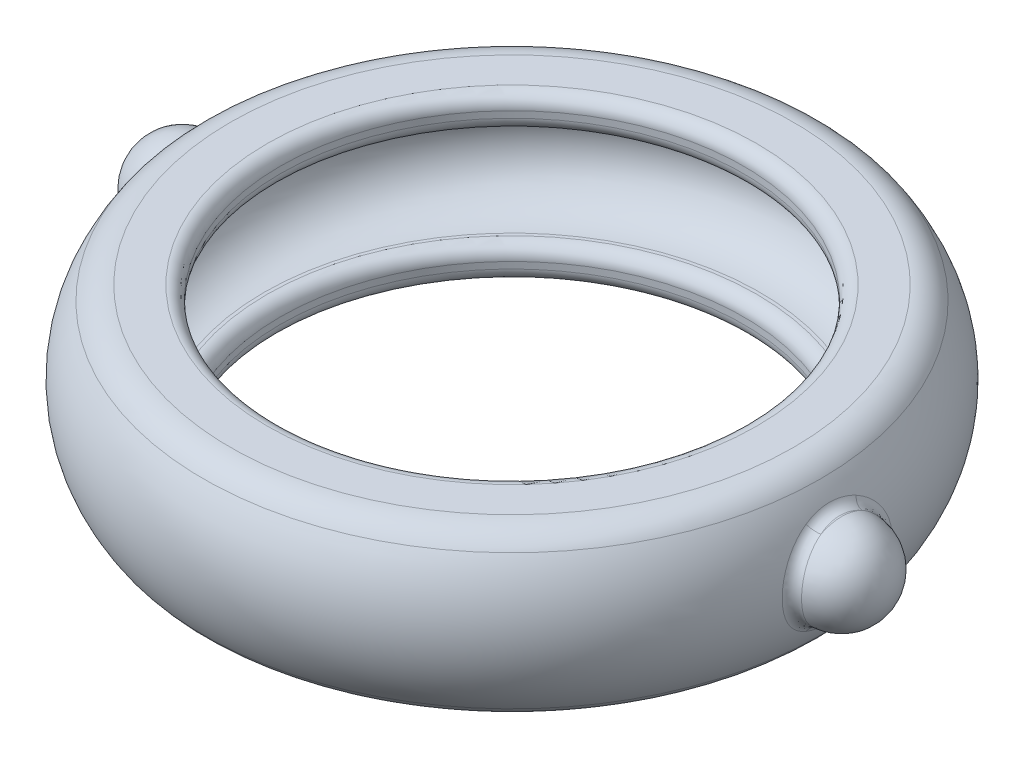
ISO-10303-21;
HEADER;
FILE_DESCRIPTION(('STEP AP214'),'2;1');
FILE_NAME('part.step','',(''),(''),'','','');
FILE_SCHEMA(('AUTOMOTIVE_DESIGN { 1 0 10303 214 1 1 1 1 }'));
ENDSEC;
DATA;
#1=APPLICATION_CONTEXT('core data for automotive mechanical design processes');
#2=APPLICATION_PROTOCOL_DEFINITION('international standard','automotive_design',2000,#1);
#3=PRODUCT_CONTEXT('',#1,'mechanical');
#4=PRODUCT('Part','Part','',(#3));
#5=PRODUCT_RELATED_PRODUCT_CATEGORY('part','',(#4));
#6=PRODUCT_DEFINITION_FORMATION('','',#4);
#7=PRODUCT_DEFINITION_CONTEXT('part definition',#1,'design');
#8=PRODUCT_DEFINITION('design','',#6,#7);
#9=PRODUCT_DEFINITION_SHAPE('','',#8);
#10=(LENGTH_UNIT() NAMED_UNIT(*) SI_UNIT(.MILLI.,.METRE.));
#11=(NAMED_UNIT(*) PLANE_ANGLE_UNIT() SI_UNIT($,.RADIAN.));
#12=(NAMED_UNIT(*) SI_UNIT($,.STERADIAN.) SOLID_ANGLE_UNIT());
#13=UNCERTAINTY_MEASURE_WITH_UNIT(LENGTH_MEASURE(1.E-05),#10,'distance_accuracy_value','');
#14=(GEOMETRIC_REPRESENTATION_CONTEXT(3) GLOBAL_UNCERTAINTY_ASSIGNED_CONTEXT((#13)) GLOBAL_UNIT_ASSIGNED_CONTEXT((#10,
#11,#12)) REPRESENTATION_CONTEXT('',''));
#15=CARTESIAN_POINT('',(0.,0.,0.));
#16=DIRECTION('',(0.,0.,1.));
#17=DIRECTION('',(1.,0.,0.));
#18=AXIS2_PLACEMENT_3D('',#15,#16,#17);
#19=CARTESIAN_POINT('',(-500000.,2.5,0.));
#20=DIRECTION('',(1.,0.,0.));
#21=DIRECTION('',(0.,0.,-1.));
#22=AXIS2_PLACEMENT_3D('',#19,#20,#21);
#23=CYLINDRICAL_SURFACE('',#22,1.4);
#24=CARTESIAN_POINT('',(10.1,2.5,0.));
#25=DIRECTION('',(1.,0.,0.));
#26=DIRECTION('',(0.,0.,-1.));
#27=AXIS2_PLACEMENT_3D('',#24,#25,#26);
#28=CIRCLE('',#27,1.4);
#29=CARTESIAN_POINT('',(10.1,1.25197535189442,0.63437723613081));
#30=VERTEX_POINT('',#29);
#31=CARTESIAN_POINT('',(10.1,1.2519753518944,-0.634377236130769));
#32=VERTEX_POINT('',#31);
#33=EDGE_CURVE('E124',#30,#32,#28,.T.);
#34=ORIENTED_EDGE('',*,*,#33,.F.);
#35=CARTESIAN_POINT('',(10.0955043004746,1.23891150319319,-0.607993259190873));
#36=CARTESIAN_POINT('',(9.86453018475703,1.25098102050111,-0.633027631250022));
#37=CARTESIAN_POINT('',(9.77510911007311,1.06243842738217,-0.735872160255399));
#38=CARTESIAN_POINT('',(10.1069613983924,1.2719956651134,-0.676616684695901));
#39=CARTESIAN_POINT('',(9.87305741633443,1.28670623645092,-0.703635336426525));
#40=CARTESIAN_POINT('',(9.78519948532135,1.10015229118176,-0.818853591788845));
#41=CARTESIAN_POINT('',(10.1197923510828,1.31063222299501,-0.742410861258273));
#42=CARTESIAN_POINT('',(9.88249675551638,1.3280701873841,-0.770450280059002));
#43=CARTESIAN_POINT('',(9.79650001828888,1.1441955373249,-0.898375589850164));
#44=CARTESIAN_POINT('',(10.1467535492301,1.39803460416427,-0.866872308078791));
#45=CARTESIAN_POINT('',(9.90202507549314,1.42038236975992,-0.895446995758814));
#46=CARTESIAN_POINT('',(9.8202459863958,1.24382875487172,-1.04873094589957));
#47=CARTESIAN_POINT('',(10.1608862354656,1.44681968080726,-0.925525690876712));
#48=CARTESIAN_POINT('',(9.91213419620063,1.47150748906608,-0.953597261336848));
#49=CARTESIAN_POINT('',(9.83269357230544,1.29944067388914,-1.11954737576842));
#50=CARTESIAN_POINT('',(10.1894994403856,1.55541623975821,-1.03634785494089));
#51=CARTESIAN_POINT('',(9.9322734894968,1.58369047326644,-1.06217457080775));
#52=CARTESIAN_POINT('',(9.85789573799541,1.42323392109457,-1.25328519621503));
#53=CARTESIAN_POINT('',(10.2039712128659,1.6155911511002,-1.08816273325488));
#54=CARTESIAN_POINT('',(9.94227491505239,1.6451436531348,-1.11205584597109));
#55=CARTESIAN_POINT('',(9.87064263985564,1.4918295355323,-1.31577666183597));
#56=CARTESIAN_POINT('',(10.2311001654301,1.74388434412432,-1.18090742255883));
#57=CARTESIAN_POINT('',(9.96072445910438,1.77420291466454,-1.20027148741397));
#58=CARTESIAN_POINT('',(9.89453870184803,1.638075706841,-1.42758194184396));
#59=CARTESIAN_POINT('',(10.243760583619,1.81198804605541,-1.22185677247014));
#60=CARTESIAN_POINT('',(9.9691465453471,1.84179309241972,-1.23844114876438));
#61=CARTESIAN_POINT('',(9.90569071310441,1.71570964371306,-1.4769194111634));
#62=CARTESIAN_POINT('',(10.2659788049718,1.95437344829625,-1.29173349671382));
#63=CARTESIAN_POINT('',(9.98374169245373,1.98128332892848,-1.302964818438));
#64=CARTESIAN_POINT('',(9.92526214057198,1.87802004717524,-1.56108177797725));
#65=CARTESIAN_POINT('',(10.2755383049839,2.02865174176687,-1.32066744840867));
#66=CARTESIAN_POINT('',(9.98987537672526,2.05304766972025,-1.32912728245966));
#67=CARTESIAN_POINT('',(9.93368305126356,1.96269263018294,-1.59591461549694));
#68=CARTESIAN_POINT('',(10.290576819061,2.18128119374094,-1.36555555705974));
#69=CARTESIAN_POINT('',(9.99946516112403,2.19923552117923,-1.36954287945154));
#70=CARTESIAN_POINT('',(9.94693053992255,2.13668060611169,-1.64994400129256));
#71=CARTESIAN_POINT('',(10.2960567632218,2.2596314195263,-1.38151267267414));
#72=CARTESIAN_POINT('',(10.0028860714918,2.27341160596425,-1.38364355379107));
#73=CARTESIAN_POINT('',(9.95175793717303,2.22599493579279,-1.66914411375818));
#74=CARTESIAN_POINT('',(10.3022703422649,2.41541423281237,-1.39956831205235));
#75=CARTESIAN_POINT('',(10.0067744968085,2.42052469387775,-1.39964284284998));
#76=CARTESIAN_POINT('',(9.95723161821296,2.40357754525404,-1.69086857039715));
#77=CARTESIAN_POINT('',(10.3031539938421,2.49279240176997,-1.40210491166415));
#78=CARTESIAN_POINT('',(10.0073198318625,2.49313682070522,-1.40186313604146));
#79=CARTESIAN_POINT('',(9.95801005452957,2.49178379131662,-1.69392004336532));
#80=CARTESIAN_POINT('',(10.3004951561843,2.64685598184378,-1.39441047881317));
#81=CARTESIAN_POINT('',(10.0056610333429,2.63828855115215,-1.39506260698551));
#82=CARTESIAN_POINT('',(9.95566781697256,2.66740658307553,-1.68466269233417));
#83=CARTESIAN_POINT('',(10.2969530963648,2.72354145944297,-1.38418068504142));
#84=CARTESIAN_POINT('',(10.0034639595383,2.71053015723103,-1.38607068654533));
#85=CARTESIAN_POINT('',(9.95254752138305,2.75482320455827,-1.67235535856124));
#86=CARTESIAN_POINT('',(10.2858709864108,2.87287343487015,-1.35156245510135));
#87=CARTESIAN_POINT('',(9.9964634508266,2.85254632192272,-1.35693586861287));
#88=CARTESIAN_POINT('',(9.94278514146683,2.92505226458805,-1.63310212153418));
#89=CARTESIAN_POINT('',(10.2783912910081,2.94556308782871,-1.32935744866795));
#90=CARTESIAN_POINT('',(9.99172508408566,2.92209008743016,-1.33706975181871));
#91=CARTESIAN_POINT('',(9.93619622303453,3.00791389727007,-1.60637705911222));
#92=CARTESIAN_POINT('',(10.260172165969,3.0861787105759,-1.27362331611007));
#93=CARTESIAN_POINT('',(9.97993292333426,3.05830609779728,-1.28624990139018));
#94=CARTESIAN_POINT('',(9.92014720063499,3.16820686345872,-1.53927137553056));
#95=CARTESIAN_POINT('',(10.2494323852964,3.15410416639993,-1.2400929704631));
#96=CARTESIAN_POINT('',(9.97291379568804,3.12481426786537,-1.25545441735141));
#97=CARTESIAN_POINT('',(9.91068678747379,3.24563761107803,-1.49888928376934));
#98=CARTESIAN_POINT('',(10.2254461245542,3.28485752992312,-1.16186285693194));
#99=CARTESIAN_POINT('',(9.95689385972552,3.25453794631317,-1.18218904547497));
#100=CARTESIAN_POINT('',(9.88955839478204,3.39468822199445,-1.40462698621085));
#101=CARTESIAN_POINT('',(10.2121514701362,3.34754738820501,-1.11694203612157));
#102=CARTESIAN_POINT('',(9.94788610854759,3.31760382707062,-1.1396596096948));
#103=CARTESIAN_POINT('',(9.87784799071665,3.46615071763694,-1.35047957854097));
#104=CARTESIAN_POINT('',(10.1845033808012,3.46474916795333,-1.01743872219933));
#105=CARTESIAN_POINT('',(9.92877997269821,3.43696731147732,-1.04370467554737));
#106=CARTESIAN_POINT('',(9.85349521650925,3.59975337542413,-1.23047055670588));
#107=CARTESIAN_POINT('',(10.1701479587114,3.5192451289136,-0.962837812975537));
#108=CARTESIAN_POINT('',(9.91869671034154,3.49329891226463,-0.990406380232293));
#109=CARTESIAN_POINT('',(9.84085109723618,3.66187534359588,-1.16458661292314));
#110=CARTESIAN_POINT('',(10.141455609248,3.62012564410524,-0.843566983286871));
#111=CARTESIAN_POINT('',(9.8982326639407,3.59857253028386,-0.872216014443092));
#112=CARTESIAN_POINT('',(9.81557977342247,3.77687278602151,-1.02058496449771));
#113=CARTESIAN_POINT('',(10.1271330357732,3.66620656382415,-0.778637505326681));
#114=CARTESIAN_POINT('',(9.88784138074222,3.64739470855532,-0.807070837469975));
#115=CARTESIAN_POINT('',(9.80296523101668,3.82940213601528,-0.942151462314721));
#116=CARTESIAN_POINT('',(10.1007088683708,3.74673684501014,-0.641821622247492));
#117=CARTESIAN_POINT('',(9.86846956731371,3.7332526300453,-0.668214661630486));
#118=CARTESIAN_POINT('',(9.77969274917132,3.9212015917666,-0.77678903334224));
#119=CARTESIAN_POINT('',(10.0886031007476,3.78120816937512,-0.569948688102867));
#120=CARTESIAN_POINT('',(9.8594543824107,3.77050745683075,-0.594476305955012));
#121=CARTESIAN_POINT('',(9.76903113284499,3.96049673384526,-0.689876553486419));
#122=CARTESIAN_POINT('',(10.0682300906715,3.83736131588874,-0.421562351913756));
#123=CARTESIAN_POINT('',(9.84421122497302,3.83133785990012,-0.441175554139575));
#124=CARTESIAN_POINT('',(9.75108875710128,4.02450778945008,-0.51036247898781));
#125=CARTESIAN_POINT('',(10.0599385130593,3.85912446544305,-0.345081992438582));
#126=CARTESIAN_POINT('',(9.83792404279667,3.85518501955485,-0.361485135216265));
#127=CARTESIAN_POINT('',(9.74378656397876,4.04931641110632,-0.417801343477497));
#128=CARTESIAN_POINT('',(10.0482590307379,3.88940617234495,-0.189314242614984));
#129=CARTESIAN_POINT('',(9.82907437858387,3.88831588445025,-0.198764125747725));
#130=CARTESIAN_POINT('',(9.73350078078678,4.08383565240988,-0.229235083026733));
#131=CARTESIAN_POINT('',(10.0448696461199,3.897928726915,-0.110027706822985));
#132=CARTESIAN_POINT('',(9.82647949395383,3.89772367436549,-0.115459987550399));
#133=CARTESIAN_POINT('',(9.73051588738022,4.09355082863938,-0.13323100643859));
#134=CARTESIAN_POINT('',(10.0435252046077,3.90132999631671,0.0455181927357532));
#135=CARTESIAN_POINT('',(9.82545529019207,3.90146111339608,0.0477349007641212));
#136=CARTESIAN_POINT('',(9.72933188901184,4.0974280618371,0.0551171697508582));
#137=CARTESIAN_POINT('',(10.0453477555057,3.89676704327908,0.1217647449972));
#138=CARTESIAN_POINT('',(9.82685172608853,3.89642150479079,0.12790827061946));
#139=CARTESIAN_POINT('',(9.73093693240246,4.09222658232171,0.147445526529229));
#140=CARTESIAN_POINT('',(10.0536960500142,3.87536118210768,0.272322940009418));
#141=CARTESIAN_POINT('',(9.83319216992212,3.87295804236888,0.285503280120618));
#142=CARTESIAN_POINT('',(9.73828899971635,4.06782524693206,0.329727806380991));
#143=CARTESIAN_POINT('',(10.0602204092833,3.85852188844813,0.346635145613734));
#144=CARTESIAN_POINT('',(9.83815654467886,3.85445812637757,0.3631852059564));
#145=CARTESIAN_POINT('',(9.74403480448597,4.04862951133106,0.419682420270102));
#146=CARTESIAN_POINT('',(10.0761163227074,3.81579449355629,0.482887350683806));
#147=CARTESIAN_POINT('',(9.85010756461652,3.80800140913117,0.504541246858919));
#148=CARTESIAN_POINT('',(9.75803408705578,3.99992296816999,0.584559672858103));
#149=CARTESIAN_POINT('',(10.0850706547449,3.79118013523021,0.545263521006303));
#150=CARTESIAN_POINT('',(9.85682315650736,3.78126518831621,0.568976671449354));
#151=CARTESIAN_POINT('',(9.76592010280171,3.97186414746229,0.66001671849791));
#152=CARTESIAN_POINT('',(10.1051007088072,3.73341286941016,0.665698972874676));
#153=CARTESIAN_POINT('',(9.87167222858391,3.7191381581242,0.692393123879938));
#154=CARTESIAN_POINT('',(9.78356075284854,3.90601309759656,0.805652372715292));
#155=CARTESIAN_POINT('',(10.1161769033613,3.70025805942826,0.723757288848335));
#156=CARTESIAN_POINT('',(9.87982959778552,3.68362622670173,0.75143862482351));
#157=CARTESIAN_POINT('',(9.79331580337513,3.86821869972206,0.875829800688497));
#158=CARTESIAN_POINT('',(10.1416629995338,3.61910643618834,0.844905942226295));
#159=CARTESIAN_POINT('',(9.8983676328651,3.5976143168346,0.873570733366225));
#160=CARTESIAN_POINT('',(9.815762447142,3.77571095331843,1.02220338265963));
#161=CARTESIAN_POINT('',(10.1563080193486,3.56949074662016,0.906887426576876));
#162=CARTESIAN_POINT('',(9.90888212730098,3.54546543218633,0.935205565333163));
#163=CARTESIAN_POINT('',(9.82866120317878,3.71915218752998,1.09704723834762));
#164=CARTESIAN_POINT('',(10.1855200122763,3.46049297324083,1.02162653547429));
#165=CARTESIAN_POINT('',(9.92950007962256,3.43263424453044,1.04788648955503));
#166=CARTESIAN_POINT('',(9.85439065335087,3.59490158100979,1.23552583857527));
#167=CARTESIAN_POINT('',(10.2000869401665,3.40110575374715,1.074379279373));
#168=CARTESIAN_POINT('',(9.93960102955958,3.37183127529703,1.0988149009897));
#169=CARTESIAN_POINT('',(9.86722130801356,3.52720388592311,1.29915465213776));
#170=CARTESIAN_POINT('',(10.2275710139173,3.27407374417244,1.16922800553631));
#171=CARTESIAN_POINT('',(9.9583518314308,3.24372560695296,1.18927929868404));
#172=CARTESIAN_POINT('',(9.89143006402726,3.38239538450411,1.41350667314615));
#173=CARTESIAN_POINT('',(10.2404872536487,3.20642445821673,1.21131814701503));
#174=CARTESIAN_POINT('',(9.96697344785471,3.17641420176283,1.22862511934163));
#175=CARTESIAN_POINT('',(9.90280736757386,3.30527945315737,1.46422280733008));
#176=CARTESIAN_POINT('',(10.2633060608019,3.06471785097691,1.28351596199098));
#177=CARTESIAN_POINT('',(9.98200758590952,3.03727662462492,1.29546074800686));
#178=CARTESIAN_POINT('',(9.9229077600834,3.14374283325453,1.55118692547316));
#179=CARTESIAN_POINT('',(10.2732094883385,2.99066236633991,1.3136270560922));
#180=CARTESIAN_POINT('',(9.9883801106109,2.9655752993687,1.32275274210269));
#181=CARTESIAN_POINT('',(9.93163160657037,3.05932423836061,1.58743903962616));
#182=CARTESIAN_POINT('',(10.2888440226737,2.83958141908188,1.3604517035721));
#183=CARTESIAN_POINT('',(9.998370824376,2.82063940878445,1.36498621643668));
#184=CARTESIAN_POINT('',(9.94540409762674,2.88710146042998,1.64380188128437));
#185=CARTESIAN_POINT('',(10.2946449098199,2.76263031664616,1.37738983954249));
#186=CARTESIAN_POINT('',(10.0020001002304,2.74767507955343,1.37998191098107));
#187=CARTESIAN_POINT('',(9.95051420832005,2.79938204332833,1.6641831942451));
#188=CARTESIAN_POINT('',(10.3017685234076,2.60684983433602,1.39812532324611));
#189=CARTESIAN_POINT('',(10.0064641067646,2.60042456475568,1.39837746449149));
#190=CARTESIAN_POINT('',(9.95678955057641,2.62180209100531,1.68913263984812));
#191=CARTESIAN_POINT('',(10.303091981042,2.52802076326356,1.40192481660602));
#192=CARTESIAN_POINT('',(10.0072808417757,2.52643858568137,1.40170291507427));
#193=CARTESIAN_POINT('',(9.95795542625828,2.53194190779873,1.69370335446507));
#194=CARTESIAN_POINT('',(10.301160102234,2.37325223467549,1.39633507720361));
#195=CARTESIAN_POINT('',(10.0060755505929,2.38065855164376,1.39676228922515));
#196=CARTESIAN_POINT('',(9.95625358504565,2.35551551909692,1.68697822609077));
#197=CARTESIAN_POINT('',(10.2980411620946,2.2972971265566,1.38733873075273));
#198=CARTESIAN_POINT('',(10.0041428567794,2.30916101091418,1.38886103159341));
#199=CARTESIAN_POINT('',(9.95350602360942,2.26893147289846,1.67615504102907));
#200=CARTESIAN_POINT('',(10.2877658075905,2.14803209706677,1.35717221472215));
#201=CARTESIAN_POINT('',(9.99766401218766,2.16740429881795,1.3619586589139));
#202=CARTESIAN_POINT('',(9.94445430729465,2.0987787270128,1.63985353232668));
#203=CARTESIAN_POINT('',(10.2806094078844,2.07472216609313,1.33600208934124));
#204=CARTESIAN_POINT('',(9.99314196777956,2.0973979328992,1.34305880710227));
#205=CARTESIAN_POINT('',(9.93815016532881,2.01521001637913,1.61437526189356));
#206=CARTESIAN_POINT('',(10.2629110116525,1.93255369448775,1.28210769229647));
#207=CARTESIAN_POINT('',(9.98171692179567,1.95995429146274,1.2940264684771));
#208=CARTESIAN_POINT('',(9.92255979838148,1.85314690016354,1.54948845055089));
#209=CARTESIAN_POINT('',(10.2523603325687,1.86370711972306,1.24935376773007));
#210=CARTESIAN_POINT('',(9.97484283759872,1.89269825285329,1.26402350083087));
#211=CARTESIAN_POINT('',(9.91326592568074,1.77466613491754,1.5100441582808));
#212=CARTESIAN_POINT('',(10.2288767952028,1.73241338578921,1.17327339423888));
#213=CARTESIAN_POINT('',(9.95920225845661,1.76271102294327,1.19293908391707));
#214=CARTESIAN_POINT('',(9.89258028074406,1.62499953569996,1.41837885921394));
#215=CARTESIAN_POINT('',(10.2159434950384,1.66996741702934,1.12994498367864));
#216=CARTESIAN_POINT('',(9.95046862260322,1.70005237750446,1.1520315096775));
#217=CARTESIAN_POINT('',(9.8811881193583,1.55381505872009,1.36615548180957));
#218=CARTESIAN_POINT('',(10.1885073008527,1.55111890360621,1.03233896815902));
#219=CARTESIAN_POINT('',(9.93157455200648,1.57933988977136,1.05818943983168));
#220=CARTESIAN_POINT('',(9.85702186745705,1.41833522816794,1.24844654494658));
#221=CARTESIAN_POINT('',(10.1739675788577,1.49497160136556,0.977757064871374));
#222=CARTESIAN_POINT('',(9.92139423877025,1.52143704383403,1.00505611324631));
#223=CARTESIAN_POINT('',(9.84421535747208,1.35433083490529,1.18259214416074));
#224=CARTESIAN_POINT('',(10.1452255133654,1.39251399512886,0.859981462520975));
#225=CARTESIAN_POINT('',(9.90094308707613,1.41470807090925,0.888581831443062));
#226=CARTESIAN_POINT('',(9.81890014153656,1.23753560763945,1.040408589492));
#227=CARTESIAN_POINT('',(10.1310231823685,1.34620405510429,0.796787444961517));
#228=CARTESIAN_POINT('',(9.89066734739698,1.36574850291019,0.82532243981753));
#229=CARTESIAN_POINT('',(9.80639144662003,1.18474518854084,0.964079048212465));
#230=CARTESIAN_POINT('',(10.1043406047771,1.26390737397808,0.662128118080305));
#231=CARTESIAN_POINT('',(9.8711540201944,1.27817759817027,0.688949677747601));
#232=CARTESIAN_POINT('',(9.78289127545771,1.09093214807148,0.801339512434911));
#233=CARTESIAN_POINT('',(10.0918969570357,1.22812681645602,0.59053173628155));
#234=CARTESIAN_POINT('',(9.86190693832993,1.23956998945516,0.615630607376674));
#235=CARTESIAN_POINT('',(9.77193204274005,1.05014456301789,0.714769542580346));
#236=CARTESIAN_POINT('',(10.0706827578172,1.16920218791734,0.441991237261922));
#237=CARTESIAN_POINT('',(9.84606015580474,1.17581878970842,0.462386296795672));
#238=CARTESIAN_POINT('',(9.75324877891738,0.98297419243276,0.535082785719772));
#239=CARTESIAN_POINT('',(10.0619111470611,1.14605447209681,0.365048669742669));
#240=CARTESIAN_POINT('',(9.83941668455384,1.15047643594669,0.382297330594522));
#241=CARTESIAN_POINT('',(9.74552381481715,0.956587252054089,0.441967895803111));
#242=CARTESIAN_POINT('',(10.0494811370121,1.11371216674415,0.210387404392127));
#243=CARTESIAN_POINT('',(9.83000444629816,1.11510833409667,0.220829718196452));
#244=CARTESIAN_POINT('',(9.73457704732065,0.919719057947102,0.254748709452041));
#245=CARTESIAN_POINT('',(10.0456803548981,1.10412835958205,0.132757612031));
#246=CARTESIAN_POINT('',(9.82709671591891,1.10453534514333,0.139311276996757));
#247=CARTESIAN_POINT('',(9.73122984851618,0.908794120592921,0.160753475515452));
#248=CARTESIAN_POINT('',(10.0432706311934,1.09802143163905,-0.023057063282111));
#249=CARTESIAN_POINT('',(9.82526214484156,1.09782894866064,-0.0241432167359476));
#250=CARTESIAN_POINT('',(9.72910769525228,0.90183260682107,-0.0279186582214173));
#251=CARTESIAN_POINT('',(10.0446605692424,1.10149549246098,-0.101241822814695));
#252=CARTESIAN_POINT('',(9.82632763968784,1.10166764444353,-0.106380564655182));
#253=CARTESIAN_POINT('',(9.73033175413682,0.905792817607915,-0.122595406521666));
#254=CARTESIAN_POINT('',(10.0522896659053,1.12101530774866,-0.253103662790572));
#255=CARTESIAN_POINT('',(9.83212398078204,1.12306915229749,-0.265401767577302));
#256=CARTESIAN_POINT('',(9.73705044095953,0.92804417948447,-0.306460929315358));
#257=CARTESIAN_POINT('',(10.0583599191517,1.13662332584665,-0.326843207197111));
#258=CARTESIAN_POINT('',(9.83674662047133,1.14022645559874,-0.342542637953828));
#259=CARTESIAN_POINT('',(9.74239631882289,0.945836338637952,-0.395726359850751));
#260=CARTESIAN_POINT('',(10.0743470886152,1.17934233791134,-0.470627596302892));
#261=CARTESIAN_POINT('',(9.84878526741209,1.18673658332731,-0.49192102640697));
#262=CARTESIAN_POINT('',(9.75647593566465,0.99453332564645,-0.569728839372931));
#263=CARTESIAN_POINT('',(10.084264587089,1.20645507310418,-0.540671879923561));
#264=CARTESIAN_POINT('',(9.85623549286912,1.21623003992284,-0.564345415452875));
#265=CARTESIAN_POINT('',(9.7652101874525,1.0254401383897,-0.654465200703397));
#266=CARTESIAN_POINT('',(10.0955043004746,1.23891150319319,-0.607993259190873));
#267=CARTESIAN_POINT('',(9.86453018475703,1.25098102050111,-0.633027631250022));
#268=CARTESIAN_POINT('',(9.77510911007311,1.06243842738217,-0.735872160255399));
#269=(BOUNDED_SURFACE() B_SPLINE_SURFACE(3,2,((#35,#36,#37),(#38,#39,#40),(#41,#42,#43),(#44,
#45,#46),(#47,#48,#49),(#50,#51,#52),(#53,#54,#55),(#56,#57,#58),(#59,#60,#61),(#62,#63,#64),
(#65,#66,#67),(#68,#69,#70),(#71,#72,#73),(#74,#75,#76),(#77,#78,#79),(#80,#81,#82),(#83,#84,
#85),(#86,#87,#88),(#89,#90,#91),(#92,#93,#94),(#95,#96,#97),(#98,#99,#100),(#101,#102,#103),
(#104,#105,#106),(#107,#108,#109),(#110,#111,#112),(#113,#114,#115),(#116,#117,#118),(#119,#120,
#121),(#122,#123,#124),(#125,#126,#127),(#128,#129,#130),(#131,#132,#133),(#134,#135,#136),
(#137,#138,#139),(#140,#141,#142),(#143,#144,#145),(#146,#147,#148),(#149,#150,#151),(#152,#153,
#154),(#155,#156,#157),(#158,#159,#160),(#161,#162,#163),(#164,#165,#166),(#167,#168,#169),
(#170,#171,#172),(#173,#174,#175),(#176,#177,#178),(#179,#180,#181),(#182,#183,#184),(#185,#186,
#187),(#188,#189,#190),(#191,#192,#193),(#194,#195,#196),(#197,#198,#199),(#200,#201,#202),
(#203,#204,#205),(#206,#207,#208),(#209,#210,#211),(#212,#213,#214),(#215,#216,#217),(#218,#219,
#220),(#221,#222,#223),(#224,#225,#226),(#227,#228,#229),(#230,#231,#232),(#233,#234,#235),
(#236,#237,#238),(#239,#240,#241),(#242,#243,#244),(#245,#246,#247),(#248,#249,#250),(#251,#252,
#253),(#254,#255,#256),(#257,#258,#259),(#260,#261,#262),(#263,#264,#265),(#266,#267,#268)),
.UNSPECIFIED.,.T.,.F.,.F.) B_SPLINE_SURFACE_WITH_KNOTS((4,2,2,2,2,2,2,2,2,2,2,2,2,2,2,2,2,2,2,2,
2,2,2,2,2,2,2,2,2,2,2,2,2,2,2,2,2,2,4),(3,3),(0.,0.287424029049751,0.575398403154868,
0.874909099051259,1.17387749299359,1.47268201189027,1.77141838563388,2.06034031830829,
2.34923421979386,2.63382372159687,2.91844387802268,3.20907845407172,3.50027200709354,
3.80048775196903,4.10013231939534,4.39783764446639,4.6954530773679,4.98056118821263,
5.26558538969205,5.5176019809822,5.76967476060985,6.06918011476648,6.3688433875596,
6.66867045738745,6.96841185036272,7.26292362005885,7.55738729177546,7.84300242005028,
8.12861651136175,8.4149670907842,8.70137083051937,8.99687974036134,9.29239958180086,
9.59337069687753,9.89425493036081,10.1863169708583,10.4783159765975,10.7602437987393,
11.0422143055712),(0.,1.),
.UNSPECIFIED.) GEOMETRIC_REPRESENTATION_ITEM() RATIONAL_B_SPLINE_SURFACE(((1.,0.832810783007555,
1.),(1.,0.82924059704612,1.),(1.,0.825204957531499,1.),(1.,0.816610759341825,1.),(1.,
0.812051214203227,1.),(1.,0.802694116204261,1.),(1.,0.797894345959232,1.),(1.,0.78878187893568,
1.),(1.,0.784468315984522,1.),(1.,0.776823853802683,1.),(1.,0.773492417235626,1.),(1.,
0.768221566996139,1.),(1.,0.766281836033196,1.),(1.,0.764080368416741,1.),(1.,0.763765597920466,
1.),(1.,0.764709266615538,1.),(1.,0.765967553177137,1.),(1.,0.769873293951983,1.),(1.,
0.772499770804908,1.),(1.,0.778827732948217,1.),(1.,0.782529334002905,1.),(1.,0.790690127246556,
1.),(1.,0.795163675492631,1.),(1.,0.804338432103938,1.),(1.,0.809040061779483,1.),(1.,
0.818314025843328,1.),(1.,0.822877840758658,1.),(1.,0.831203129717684,1.),(1.,0.834966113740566,
1.),(1.,0.841250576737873,1.),(1.,0.843779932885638,1.),(1.,0.847331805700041,1.),(1.,
0.848354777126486,1.),(1.,0.848761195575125,1.),(1.,0.848211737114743,1.),(1.,0.845679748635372,
1.),(1.,0.843697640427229,1.),(1.,0.838822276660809,1.),(1.,0.836061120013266,1.),(1.,
0.82982129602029,1.),(1.,0.826342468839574,1.),(1.,0.818244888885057,1.),(1.,0.813534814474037,
1.),(1.,0.804005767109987,1.),(1.,0.799186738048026,1.),(1.,0.789976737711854,1.),(1.,
0.785586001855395,1.),(1.,0.777750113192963,1.),(1.,0.774304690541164,1.),(1.,0.768832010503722,
1.),(1.,0.76678105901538,1.),(1.,0.764258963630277,1.),(1.,0.763787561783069,1.),(1.,
0.764473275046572,1.),(1.,0.765581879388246,1.),(1.,0.769207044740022,1.),(1.,0.771723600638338,
1.),(1.,0.777880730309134,1.),(1.,0.78152418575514,1.),(1.,0.789529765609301,1.),(1.,
0.79389202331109,1.),(1.,0.80301989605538,1.),(1.,0.807793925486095,1.),(1.,0.81710452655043,
1.),(1.,0.821641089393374,1.),(1.,0.830067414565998,1.),(1.,0.83394370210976,1.),(1.,
0.840498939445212,1.),(1.,0.843178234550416,1.),(1.,0.846961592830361,1.),(1.,0.848109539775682,
1.),(1.,0.848838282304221,1.),(1.,0.848419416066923,1.),(1.,0.846106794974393,1.),(1.,
0.844264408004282,1.),(1.,0.839367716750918,1.),(1.,0.836313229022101,1.),(1.,0.832810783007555,1.))) REPRESENTATION_ITEM('') SURFACE());
#270=CARTESIAN_POINT('',(10.0955043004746,1.23891150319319,-0.607993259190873));
#271=CARTESIAN_POINT('',(10.1069613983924,1.2719956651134,-0.676616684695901));
#272=CARTESIAN_POINT('',(10.1197923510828,1.31063222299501,-0.742410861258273));
#273=CARTESIAN_POINT('',(10.1467535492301,1.39803460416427,-0.866872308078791));
#274=CARTESIAN_POINT('',(10.1608862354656,1.44681968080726,-0.925525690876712));
#275=CARTESIAN_POINT('',(10.1894994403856,1.55541623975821,-1.03634785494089));
#276=CARTESIAN_POINT('',(10.2039712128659,1.6155911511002,-1.08816273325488));
#277=CARTESIAN_POINT('',(10.2311001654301,1.74388434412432,-1.18090742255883));
#278=CARTESIAN_POINT('',(10.243760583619,1.81198804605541,-1.22185677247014));
#279=CARTESIAN_POINT('',(10.2659788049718,1.95437344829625,-1.29173349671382));
#280=CARTESIAN_POINT('',(10.2755383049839,2.02865174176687,-1.32066744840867));
#281=CARTESIAN_POINT('',(10.290576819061,2.18128119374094,-1.36555555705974));
#282=CARTESIAN_POINT('',(10.2960567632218,2.2596314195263,-1.38151267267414));
#283=CARTESIAN_POINT('',(10.3022703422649,2.41541423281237,-1.39956831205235));
#284=CARTESIAN_POINT('',(10.3031539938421,2.49279240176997,-1.40210491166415));
#285=CARTESIAN_POINT('',(10.3004951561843,2.64685598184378,-1.39441047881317));
#286=CARTESIAN_POINT('',(10.2969530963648,2.72354145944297,-1.38418068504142));
#287=CARTESIAN_POINT('',(10.2858709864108,2.87287343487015,-1.35156245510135));
#288=CARTESIAN_POINT('',(10.2783912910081,2.94556308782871,-1.32935744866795));
#289=CARTESIAN_POINT('',(10.260172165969,3.0861787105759,-1.27362331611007));
#290=CARTESIAN_POINT('',(10.2494323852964,3.15410416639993,-1.2400929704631));
#291=CARTESIAN_POINT('',(10.2254461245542,3.28485752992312,-1.16186285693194));
#292=CARTESIAN_POINT('',(10.2121514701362,3.34754738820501,-1.11694203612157));
#293=CARTESIAN_POINT('',(10.1845033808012,3.46474916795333,-1.01743872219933));
#294=CARTESIAN_POINT('',(10.1701479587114,3.5192451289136,-0.962837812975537));
#295=CARTESIAN_POINT('',(10.141455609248,3.62012564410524,-0.843566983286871));
#296=CARTESIAN_POINT('',(10.1271330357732,3.66620656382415,-0.778637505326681));
#297=CARTESIAN_POINT('',(10.1007088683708,3.74673684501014,-0.641821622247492));
#298=CARTESIAN_POINT('',(10.0886031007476,3.78120816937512,-0.569948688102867));
#299=CARTESIAN_POINT('',(10.0682300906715,3.83736131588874,-0.421562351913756));
#300=CARTESIAN_POINT('',(10.0599385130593,3.85912446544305,-0.345081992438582));
#301=CARTESIAN_POINT('',(10.0482590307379,3.88940617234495,-0.189314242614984));
#302=CARTESIAN_POINT('',(10.0448696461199,3.897928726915,-0.110027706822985));
#303=CARTESIAN_POINT('',(10.0435252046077,3.90132999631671,0.0455181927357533));
#304=CARTESIAN_POINT('',(10.0453477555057,3.89676704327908,0.1217647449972));
#305=CARTESIAN_POINT('',(10.0536960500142,3.87536118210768,0.272322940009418));
#306=CARTESIAN_POINT('',(10.0602204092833,3.85852188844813,0.346635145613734));
#307=CARTESIAN_POINT('',(10.0761163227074,3.81579449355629,0.482887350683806));
#308=CARTESIAN_POINT('',(10.0850706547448,3.79118013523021,0.545263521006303));
#309=CARTESIAN_POINT('',(10.1051007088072,3.73341286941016,0.665698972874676));
#310=CARTESIAN_POINT('',(10.1161769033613,3.70025805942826,0.723757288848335));
#311=CARTESIAN_POINT('',(10.1416629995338,3.61910643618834,0.844905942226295));
#312=CARTESIAN_POINT('',(10.1563080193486,3.56949074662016,0.906887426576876));
#313=CARTESIAN_POINT('',(10.1855200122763,3.46049297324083,1.02162653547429));
#314=CARTESIAN_POINT('',(10.2000869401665,3.40110575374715,1.074379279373));
#315=CARTESIAN_POINT('',(10.2275710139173,3.27407374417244,1.16922800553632));
#316=CARTESIAN_POINT('',(10.2404872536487,3.20642445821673,1.21131814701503));
#317=CARTESIAN_POINT('',(10.2633060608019,3.06471785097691,1.28351596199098));
#318=CARTESIAN_POINT('',(10.2732094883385,2.99066236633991,1.3136270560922));
#319=CARTESIAN_POINT('',(10.2888440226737,2.83958141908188,1.3604517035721));
#320=CARTESIAN_POINT('',(10.2946449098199,2.76263031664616,1.37738983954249));
#321=CARTESIAN_POINT('',(10.3017685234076,2.60684983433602,1.39812532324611));
#322=CARTESIAN_POINT('',(10.303091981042,2.52802076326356,1.40192481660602));
#323=CARTESIAN_POINT('',(10.301160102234,2.37325223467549,1.39633507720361));
#324=CARTESIAN_POINT('',(10.2980411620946,2.2972971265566,1.38733873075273));
#325=CARTESIAN_POINT('',(10.2877658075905,2.14803209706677,1.35717221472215));
#326=CARTESIAN_POINT('',(10.2806094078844,2.07472216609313,1.33600208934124));
#327=CARTESIAN_POINT('',(10.2629110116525,1.93255369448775,1.28210769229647));
#328=CARTESIAN_POINT('',(10.2523603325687,1.86370711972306,1.24935376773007));
#329=CARTESIAN_POINT('',(10.2288767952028,1.73241338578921,1.17327339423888));
#330=CARTESIAN_POINT('',(10.2159434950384,1.66996741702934,1.12994498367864));
#331=CARTESIAN_POINT('',(10.1885073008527,1.55111890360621,1.03233896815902));
#332=CARTESIAN_POINT('',(10.1739675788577,1.49497160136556,0.977757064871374));
#333=CARTESIAN_POINT('',(10.1452255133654,1.39251399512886,0.859981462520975));
#334=CARTESIAN_POINT('',(10.1310231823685,1.34620405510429,0.796787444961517));
#335=CARTESIAN_POINT('',(10.1043406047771,1.26390737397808,0.662128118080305));
#336=CARTESIAN_POINT('',(10.0918969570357,1.22812681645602,0.59053173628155));
#337=CARTESIAN_POINT('',(10.0706827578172,1.16920218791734,0.441991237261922));
#338=CARTESIAN_POINT('',(10.0619111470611,1.14605447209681,0.365048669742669));
#339=CARTESIAN_POINT('',(10.0494811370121,1.11371216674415,0.210387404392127));
#340=CARTESIAN_POINT('',(10.0456803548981,1.10412835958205,0.132757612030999));
#341=CARTESIAN_POINT('',(10.0432706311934,1.09802143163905,-0.023057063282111));
#342=CARTESIAN_POINT('',(10.0446605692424,1.10149549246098,-0.101241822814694));
#343=CARTESIAN_POINT('',(10.0522896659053,1.12101530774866,-0.253103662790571));
#344=CARTESIAN_POINT('',(10.0583599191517,1.13662332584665,-0.326843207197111));
#345=CARTESIAN_POINT('',(10.0743470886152,1.17934233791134,-0.470627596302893));
#346=CARTESIAN_POINT('',(10.084264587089,1.20645507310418,-0.540671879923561));
#347=CARTESIAN_POINT('',(10.0955043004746,1.23891150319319,-0.607993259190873));
#348=B_SPLINE_CURVE_WITH_KNOTS('',3,(#270,#271,#272,#273,#274,#275,#276,#277,#278,#279,#280,
#281,#282,#283,#284,#285,#286,#287,#288,#289,#290,#291,#292,#293,#294,#295,#296,#297,#298,#299,
#300,#301,#302,#303,#304,#305,#306,#307,#308,#309,#310,#311,#312,#313,#314,#315,#316,#317,#318,
#319,#320,#321,#322,#323,#324,#325,#326,#327,#328,#329,#330,#331,#332,#333,#334,#335,#336,#337,
#338,#339,#340,#341,#342,#343,#344,#345,#346,#347),.UNSPECIFIED.,.T.,.F.,(4,2,2,2,2,2,2,2,2,2,2,
2,2,2,2,2,2,2,2,2,2,2,2,2,2,2,2,2,2,2,2,2,2,2,2,2,2,2,4),(0.,0.287424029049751,
0.575398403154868,0.874909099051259,1.17387749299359,1.47268201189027,1.77141838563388,
2.06034031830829,2.34923421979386,2.63382372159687,2.91844387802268,3.20907845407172,
3.50027200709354,3.80048775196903,4.10013231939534,4.39783764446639,4.6954530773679,
4.98056118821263,5.26558538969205,5.5176019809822,5.76967476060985,6.06918011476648,
6.3688433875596,6.66867045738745,6.96841185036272,7.26292362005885,7.55738729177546,
7.84300242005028,8.12861651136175,8.4149670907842,8.70137083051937,8.99687974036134,
9.29239958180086,9.59337069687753,9.89425493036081,10.1863169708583,10.4783159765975,
10.7602437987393,11.0422143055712),.UNSPECIFIED.);
#349=EDGE_CURVE('E11',#30,#32,#348,.T.);
#350=ORIENTED_EDGE('',*,*,#349,.T.);
#351=EDGE_LOOP('',(#34,#350));
#352=FACE_BOUND('',#351,.T.);
#353=ADVANCED_FACE('F35',(#352),#23,.T.);
#354=CARTESIAN_POINT('',(500000.,2.5,0.));
#355=DIRECTION('',(-1.,0.,0.));
#356=DIRECTION('',(0.,0.,1.));
#357=AXIS2_PLACEMENT_3D('',#354,#355,#356);
#358=CYLINDRICAL_SURFACE('',#357,1.4);
#359=CARTESIAN_POINT('',(-10.1,2.5,0.));
#360=DIRECTION('',(1.,0.,0.));
#361=DIRECTION('',(0.,0.,-1.));
#362=AXIS2_PLACEMENT_3D('',#359,#360,#361);
#363=CIRCLE('',#362,1.4);
#364=CARTESIAN_POINT('',(-10.1,3.74802464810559,-0.634377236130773));
#365=VERTEX_POINT('',#364);
#366=CARTESIAN_POINT('',(-10.1,3.74802464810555,0.634377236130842));
#367=VERTEX_POINT('',#366);
#368=EDGE_CURVE('E108',#365,#367,#363,.T.);
#369=ORIENTED_EDGE('',*,*,#368,.T.);
#370=CARTESIAN_POINT('',(-9.83521351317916,3.68706334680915,-1.13186595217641));
#371=CARTESIAN_POINT('',(-9.9140590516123,3.51671276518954,-0.963147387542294));
#372=CARTESIAN_POINT('',(-10.1637471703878,3.54134108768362,-0.935739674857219));
#373=CARTESIAN_POINT('',(-9.82236589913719,3.74729564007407,-1.06098692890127));
#374=CARTESIAN_POINT('',(-9.90381003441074,3.57126902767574,-0.905751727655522));
#375=CARTESIAN_POINT('',(-10.1491605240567,3.59417934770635,-0.877018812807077));
#376=CARTESIAN_POINT('',(-9.8096210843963,3.80179680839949,-0.984550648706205));
#377=CARTESIAN_POINT('',(-9.89333935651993,3.62174430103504,-0.842407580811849));
#378=CARTESIAN_POINT('',(-10.1346901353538,3.64199002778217,-0.813732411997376));
#379=CARTESIAN_POINT('',(-9.78575302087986,3.89808829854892,-0.822621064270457));
#380=CARTESIAN_POINT('',(-9.87353893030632,3.71151338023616,-0.706834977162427));
#381=CARTESIAN_POINT('',(-10.1075899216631,3.7264609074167,-0.679733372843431));
#382=CARTESIAN_POINT('',(-9.77463258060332,3.93985673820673,-0.737112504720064));
#383=CARTESIAN_POINT('',(-9.86418254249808,3.75097972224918,-0.634567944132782));
#384=CARTESIAN_POINT('',(-10.0949632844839,3.76310191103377,-0.609008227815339));
#385=CARTESIAN_POINT('',(-9.75551159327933,4.00911552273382,-0.559618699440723));
#386=CARTESIAN_POINT('',(-9.84799470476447,3.81662904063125,-0.483411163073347));
#387=CARTESIAN_POINT('',(-10.0732521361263,3.82385858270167,-0.462269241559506));
#388=CARTESIAN_POINT('',(-9.74750182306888,4.03664815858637,-0.467653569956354));
#389=CARTESIAN_POINT('',(-9.84111410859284,3.84304455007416,-0.404392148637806));
#390=CARTESIAN_POINT('',(-10.064157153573,3.84801135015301,-0.386271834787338));
#391=CARTESIAN_POINT('',(-9.735688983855,4.07661547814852,-0.279858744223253));
#392=CARTESIAN_POINT('',(-9.83096628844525,3.88135533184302,-0.242554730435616));
#393=CARTESIAN_POINT('',(-10.0507437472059,3.88307233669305,-0.231127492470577));
#394=CARTESIAN_POINT('',(-9.73187935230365,4.08907371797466,-0.184035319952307));
#395=CARTESIAN_POINT('',(-9.82765855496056,3.89340913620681,-0.15948154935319));
#396=CARTESIAN_POINT('',(-10.0464178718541,3.8940012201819,-0.151985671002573));
#397=CARTESIAN_POINT('',(-9.72907477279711,4.0982768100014,0.00455077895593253));
#398=CARTESIAN_POINT('',(-9.8252340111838,3.90227559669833,0.00387767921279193));
#399=CARTESIAN_POINT('',(-10.0432332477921,3.90207455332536,0.00375935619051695));
#400=CARTESIAN_POINT('',(-9.72988634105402,4.09565308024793,0.0972751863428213));
#401=CARTESIAN_POINT('',(-9.82594007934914,3.89973243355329,0.0844200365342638));
#402=CARTESIAN_POINT('',(-10.0441547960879,3.8997729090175,0.0803314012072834));
#403=CARTESIAN_POINT('',(-9.73576059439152,4.07624739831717,0.280947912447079));
#404=CARTESIAN_POINT('',(-9.83101174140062,3.88105841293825,0.243356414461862));
#405=CARTESIAN_POINT('',(-10.0508250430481,3.88274944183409,0.232029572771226));
#406=CARTESIAN_POINT('',(-9.74082801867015,4.0594496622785,0.371894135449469));
#407=CARTESIAN_POINT('',(-9.83539898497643,3.864847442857,0.32201838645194));
#408=CARTESIAN_POINT('',(-10.05657912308,3.86801377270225,0.307153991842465));
#409=CARTESIAN_POINT('',(-9.75445912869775,4.0125473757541,0.548219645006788));
#410=CARTESIAN_POINT('',(-9.84706328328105,3.82001567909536,0.473494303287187));
#411=CARTESIAN_POINT('',(-10.0720570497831,3.82686914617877,0.452850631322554));
#412=CARTESIAN_POINT('',(-9.76298012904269,3.98260492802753,0.633652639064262));
#413=CARTESIAN_POINT('',(-9.85433909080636,3.79140803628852,0.546570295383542));
#414=CARTESIAN_POINT('',(-10.0817324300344,3.80060239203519,0.523466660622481));
#415=CARTESIAN_POINT('',(-9.78241822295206,3.91046239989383,0.797936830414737));
#416=CARTESIAN_POINT('',(-9.87072940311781,3.72328591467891,0.686015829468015));
#417=CARTESIAN_POINT('',(-10.1038034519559,3.73731598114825,0.659314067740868));
#418=CARTESIAN_POINT('',(-9.79333251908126,3.86827661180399,0.876795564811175));
#419=CARTESIAN_POINT('',(-9.87987529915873,3.68361770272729,0.752493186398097));
#420=CARTESIAN_POINT('',(-10.116195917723,3.70030886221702,0.724551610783));
#421=CARTESIAN_POINT('',(-9.80490672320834,3.82043669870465,0.951376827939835));
#422=CARTESIAN_POINT('',(-9.88935558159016,3.63941557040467,0.81416690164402));
#423=CARTESIAN_POINT('',(-10.1293373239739,3.65834171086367,0.786285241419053));
#424=(BOUNDED_SURFACE() B_SPLINE_SURFACE(3,2,((#370,#371,#372),(#373,#374,#375),(#376,#377,
#378),(#379,#380,#381),(#382,#383,#384),(#385,#386,#387),(#388,#389,#390),(#391,#392,#393),
(#394,#395,#396),(#397,#398,#399),(#400,#401,#402),(#403,#404,#405),(#406,#407,#408),(#409,#410,
#411),(#412,#413,#414),(#415,#416,#417),(#418,#419,#420),(#421,#422,#423)),.UNSPECIFIED.,.F.,
.F.,.F.) B_SPLINE_SURFACE_WITH_KNOTS((4,2,2,2,2,2,2,2,4),(3,3),(0.,0.29913623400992,
0.598783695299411,0.897535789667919,1.19582043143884,1.48171064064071,1.76791963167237,
2.05069407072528,2.33313973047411),(0.,1.),
.UNSPECIFIED.) GEOMETRIC_REPRESENTATION_ITEM() RATIONAL_B_SPLINE_SURFACE(((1.,0.811102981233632,
1.),(1.,0.815847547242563,1.),(1.,0.820475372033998,1.),(1.,0.829046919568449,1.),(1.,
0.832989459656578,1.),(1.,0.839710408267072,1.),(1.,0.842492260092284,1.),(1.,0.846579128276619,
1.),(1.,0.847886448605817,1.),(1.,0.848849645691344,1.),(1.,0.848571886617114,1.),(1.,
0.8465513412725,1.),(1.,0.844806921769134,1.),(1.,0.840071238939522,1.),(1.,0.837095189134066,
1.),(1.,0.830230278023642,1.),(1.,0.826342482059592,1.),(1.,0.822160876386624,1.))) REPRESENTATION_ITEM('') SURFACE());
#425=CARTESIAN_POINT('',(-10.1714144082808,1.4868771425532,-0.966220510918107));
#426=CARTESIAN_POINT('',(-10.1700158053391,1.48164670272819,-0.96073714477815));
#427=CARTESIAN_POINT('',(-10.1686170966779,1.47646318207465,-0.955212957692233));
#428=CARTESIAN_POINT('',(-10.1390846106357,1.36796562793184,-0.837663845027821));
#429=CARTESIAN_POINT('',(-10.1108211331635,1.28228386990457,-0.707721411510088));
#430=CARTESIAN_POINT('',(-10.0677516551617,1.15994606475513,-0.431508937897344));
#431=CARTESIAN_POINT('',(-10.0524348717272,1.12139934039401,-0.286142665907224));
#432=CARTESIAN_POINT('',(-10.0407431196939,1.09148236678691,0.0178046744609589));
#433=CARTESIAN_POINT('',(-10.0453392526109,1.10253171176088,0.176683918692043));
#434=CARTESIAN_POINT('',(-10.0734814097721,1.1766565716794,0.484540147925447));
#435=CARTESIAN_POINT('',(-10.0975885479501,1.24127399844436,0.633080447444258));
#436=CARTESIAN_POINT('',(-10.1521128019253,1.41353718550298,0.896656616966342));
#437=CARTESIAN_POINT('',(-10.1824053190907,1.5203672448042,1.01225997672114));
#438=CARTESIAN_POINT('',(-10.2361793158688,1.7630699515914,1.19985225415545));
#439=CARTESIAN_POINT('',(-10.2598457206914,1.8979185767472,1.27310354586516));
#440=CARTESIAN_POINT('',(-10.2927758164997,2.18544699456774,1.37260656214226));
#441=CARTESIAN_POINT('',(-10.3020784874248,2.33807731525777,1.39898551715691));
#442=CARTESIAN_POINT('',(-10.3027624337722,2.64714853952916,1.40097741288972));
#443=CARTESIAN_POINT('',(-10.2937417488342,2.80359889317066,1.37545170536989));
#444=CARTESIAN_POINT('',(-10.2605732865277,3.09814846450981,1.27536935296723));
#445=CARTESIAN_POINT('',(-10.2363908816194,3.23620479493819,1.20070045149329));
#446=CARTESIAN_POINT('',(-10.1835409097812,3.47428311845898,1.01611553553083));
#447=CARTESIAN_POINT('',(-10.155130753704,3.57576227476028,0.907978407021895));
#448=CARTESIAN_POINT('',(-10.1031773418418,3.74209468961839,0.66286268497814));
#449=CARTESIAN_POINT('',(-10.0797089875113,3.80640696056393,0.525496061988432));
#450=CARTESIAN_POINT('',(-10.0488920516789,3.88857036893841,0.234172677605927));
#451=CARTESIAN_POINT('',(-10.0416801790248,3.90602771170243,0.0800865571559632));
#452=CARTESIAN_POINT('',(-10.0480411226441,3.88986943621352,-0.231761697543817));
#453=CARTESIAN_POINT('',(-10.0625482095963,3.85395860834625,-0.389384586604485));
#454=CARTESIAN_POINT('',(-10.1057857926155,3.73266902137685,-0.682698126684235));
#455=CARTESIAN_POINT('',(-10.1346153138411,3.64694514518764,-0.818227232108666));
#456=CARTESIAN_POINT('',(-10.1919876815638,3.43896819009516,-1.04965659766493));
#457=CARTESIAN_POINT('',(-10.220512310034,3.31791304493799,-1.14664250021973));
#458=CARTESIAN_POINT('',(-10.2666902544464,3.05219010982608,-1.29524863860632));
#459=CARTESIAN_POINT('',(-10.2845709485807,2.90810646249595,-1.34782859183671));
#460=CARTESIAN_POINT('',(-10.3038611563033,2.60700916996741,-1.40438118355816));
#461=CARTESIAN_POINT('',(-10.3050050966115,2.44982677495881,-1.40757014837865));
#462=CARTESIAN_POINT('',(-10.2893801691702,2.13869798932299,-1.36203717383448));
#463=CARTESIAN_POINT('',(-10.2719810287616,1.98505893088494,-1.31148887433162));
#464=CARTESIAN_POINT('',(-10.2265132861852,1.71131937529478,-1.16654003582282));
#465=CARTESIAN_POINT('',(-10.1989843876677,1.58998225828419,-1.07431144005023));
#466=CARTESIAN_POINT('',(-10.1714144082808,1.4868771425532,-0.966220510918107));
#467=B_SPLINE_CURVE_WITH_KNOTS('',3,(#425,#426,#427,#428,#429,#430,#431,#432,#433,#434,#435,
#436,#437,#438,#439,#440,#441,#442,#443,#444,#445,#446,#447,#448,#449,#450,#451,#452,#453,#454,
#455,#456,#457,#458,#459,#460,#461,#462,#463,#464,#465,#466),.UNSPECIFIED.,.T.,.F.,(4,2,2,2,2,2,
2,2,2,2,2,2,2,2,2,2,2,2,2,2,4),(0.,0.0231148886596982,0.487938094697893,0.933430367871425,
1.40088634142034,1.88228473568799,2.3548031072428,2.81239517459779,3.26874324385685,
3.73521030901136,4.2027466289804,4.64878161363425,5.10115523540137,5.55731912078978,
6.03367734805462,6.51337593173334,6.97839721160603,7.43309050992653,7.89499104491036,
8.37310746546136,8.82876002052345),.UNSPECIFIED.);
#468=EDGE_CURVE('E105',#367,#365,#467,.T.);
#469=ORIENTED_EDGE('',*,*,#468,.T.);
#470=EDGE_LOOP('',(#369,#469));
#471=FACE_BOUND('',#470,.T.);
#472=ADVANCED_FACE('F107',(#471),#358,.T.);
#473=CARTESIAN_POINT('',(0.,2.5,0.));
#474=DIRECTION('',(0.,1.,0.));
#475=DIRECTION('',(-1.,0.,0.));
#476=AXIS2_PLACEMENT_3D('',#473,#474,#475);
#477=TOROIDAL_SURFACE('',#476,6.475,3.625);
#478=CARTESIAN_POINT('',(-9.73510890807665,4.07877810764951,0.242963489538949));
#479=CARTESIAN_POINT('',(-9.83352939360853,3.87713761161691,0.209624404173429));
#480=CARTESIAN_POINT('',(-10.060058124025,3.88496948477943,0.200659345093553));
#481=CARTESIAN_POINT('',(-9.73874951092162,4.06645317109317,0.334613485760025));
#482=CARTESIAN_POINT('',(-9.8363939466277,3.86585676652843,0.288767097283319));
#483=CARTESIAN_POINT('',(-10.0633668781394,3.8741575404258,0.276356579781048));
#484=CARTESIAN_POINT('',(-9.74457088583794,4.04700171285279,0.424985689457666));
#485=CARTESIAN_POINT('',(-9.84097847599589,3.84798213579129,0.366572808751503));
#486=CARTESIAN_POINT('',(-10.0686575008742,3.85709391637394,0.351016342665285));
#487=CARTESIAN_POINT('',(-9.75956223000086,3.99468114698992,0.600699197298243));
#488=CARTESIAN_POINT('',(-9.85270597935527,3.8002425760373,0.517384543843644));
#489=CARTESIAN_POINT('',(-10.0822795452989,3.81119615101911,0.496226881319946));
#490=CARTESIAN_POINT('',(-9.7687275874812,3.9618305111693,0.686047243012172));
#491=CARTESIAN_POINT('',(-9.85986184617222,3.77032233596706,0.590488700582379));
#492=CARTESIAN_POINT('',(-10.0906067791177,3.78237821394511,0.566783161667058));
#493=CARTESIAN_POINT('',(-9.78969886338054,3.88241274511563,0.851789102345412));
#494=CARTESIAN_POINT('',(-9.87611432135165,3.6984994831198,0.731831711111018));
#495=CARTESIAN_POINT('',(-10.1096560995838,3.71270966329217,0.70386299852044));
#496=CARTESIAN_POINT('',(-9.80157150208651,3.83548747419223,0.931977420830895));
#497=CARTESIAN_POINT('',(-9.88527510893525,3.65620053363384,0.799909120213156));
#498=CARTESIAN_POINT('',(-10.1204386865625,3.67154487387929,0.770218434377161));
#499=CARTESIAN_POINT('',(-9.82638121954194,3.72960005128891,1.08255722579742));
#500=CARTESIAN_POINT('',(-9.90426508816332,3.56151456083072,0.927140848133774));
#501=CARTESIAN_POINT('',(-10.1429650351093,3.57865604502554,0.894886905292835));
#502=CARTESIAN_POINT('',(-9.83931839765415,3.67063677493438,1.15294779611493));
#503=CARTESIAN_POINT('',(-9.91410188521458,3.50905325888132,0.986273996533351));
#504=CARTESIAN_POINT('',(-10.1547088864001,3.52693101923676,0.953199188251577));
#505=CARTESIAN_POINT('',(-9.86481074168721,3.54228019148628,1.28209291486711));
#506=CARTESIAN_POINT('',(-9.93334160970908,3.39572741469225,1.09427420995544));
#507=CARTESIAN_POINT('',(-10.1778444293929,3.4143313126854,1.06023821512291));
#508=CARTESIAN_POINT('',(-9.87736602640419,3.47289016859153,1.34085111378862));
#509=CARTESIAN_POINT('',(-9.94274049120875,3.33483049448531,1.14307839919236));
#510=CARTESIAN_POINT('',(-10.1892362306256,3.35345951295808,1.10896796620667));
#511=CARTESIAN_POINT('',(-9.90075564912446,3.32554547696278,1.44528571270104));
#512=CARTESIAN_POINT('',(-9.96014414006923,3.20638674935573,1.22950242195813));
#513=CARTESIAN_POINT('',(-10.2104541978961,3.22420265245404,1.19561568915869));
#514=CARTESIAN_POINT('',(-9.91158987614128,3.24759025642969,1.49096126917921));
#515=CARTESIAN_POINT('',(-9.96813519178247,3.13885522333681,1.26703252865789));
#516=CARTESIAN_POINT('',(-10.2202802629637,3.15581710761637,1.23353296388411));
#517=CARTESIAN_POINT('',(-9.93043132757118,3.08514713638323,1.56813983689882));
#518=CARTESIAN_POINT('',(-9.98197710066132,2.99884625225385,1.3303026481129));
#519=CARTESIAN_POINT('',(-10.2373660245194,3.01331528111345,1.29762247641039));
#520=CARTESIAN_POINT('',(-9.93843408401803,3.00064916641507,1.59962047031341));
#521=CARTESIAN_POINT('',(-9.98780724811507,2.92642873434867,1.3559367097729));
#522=CARTESIAN_POINT('',(-10.244621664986,2.93919016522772,1.3237761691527));
#523=CARTESIAN_POINT('',(-9.95077612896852,2.82763550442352,1.64750126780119));
#524=CARTESIAN_POINT('',(-9.99678670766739,2.77858480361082,1.39490764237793));
#525=CARTESIAN_POINT('',(-10.25581063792,2.78741542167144,1.3635616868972));
#526=CARTESIAN_POINT('',(-9.95511572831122,2.73912015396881,1.66390271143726));
#527=CARTESIAN_POINT('',(-9.99992207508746,2.70326722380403,1.40818229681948));
#528=CARTESIAN_POINT('',(-10.2597442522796,2.70976609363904,1.37719457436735));
#529=CARTESIAN_POINT('',(-9.95967890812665,2.56138515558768,1.6811358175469));
#530=CARTESIAN_POINT('',(-10.003224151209,2.55210719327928,1.42215263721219));
#531=CARTESIAN_POINT('',(-10.263880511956,2.55384959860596,1.39151888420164));
#532=CARTESIAN_POINT('',(-9.95993701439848,2.4721778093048,1.68209808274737));
#533=CARTESIAN_POINT('',(-10.0034100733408,2.4764033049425,1.4229297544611));
#534=CARTESIAN_POINT('',(-10.2641144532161,2.47559322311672,1.39231886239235));
#535=CARTESIAN_POINT('',(-9.9564009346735,2.29488518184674,1.66876435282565));
#536=CARTESIAN_POINT('',(-10.0008520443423,2.32566176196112,1.41212300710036));
#537=CARTESIAN_POINT('',(-10.2609092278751,2.32006479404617,1.38123552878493));
#538=CARTESIAN_POINT('',(-9.9526069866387,2.20679983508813,1.65446925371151));
#539=CARTESIAN_POINT('',(-9.99811269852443,2.25075422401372,1.40055858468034));
#540=CARTESIAN_POINT('',(-10.2574702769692,2.24279268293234,1.36935296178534));
#541=CARTESIAN_POINT('',(-9.94136092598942,2.03456989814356,1.61106194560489));
#542=CARTESIAN_POINT('',(-9.98993869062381,2.10370776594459,1.36525438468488));
#543=CARTESIAN_POINT('',(-10.2472751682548,2.0917054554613,1.33328233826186));
#544=CARTESIAN_POINT('',(-9.93392212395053,1.95041218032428,1.58200363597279));
#545=CARTESIAN_POINT('',(-9.98452671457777,2.03166944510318,1.34161579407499));
#546=CARTESIAN_POINT('',(-10.2405310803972,2.01787882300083,1.30913904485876));
#547=CARTESIAN_POINT('',(-9.91612725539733,1.78803197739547,1.50982039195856));
#548=CARTESIAN_POINT('',(-9.97147519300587,1.89191820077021,1.28251290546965));
#549=CARTESIAN_POINT('',(-10.2243951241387,1.87543218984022,1.24919119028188));
#550=CARTESIAN_POINT('',(-9.90577096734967,1.70980994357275,1.46669438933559));
#551=CARTESIAN_POINT('',(-9.96385210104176,1.82427689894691,1.24712956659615));
#552=CARTESIAN_POINT('',(-10.2150030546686,1.80681258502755,1.21338574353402));
#553=CARTESIAN_POINT('',(-9.88309768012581,1.56086236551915,1.36704829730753));
#554=CARTESIAN_POINT('',(-9.94701755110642,1.69468440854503,1.16479876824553));
#555=CARTESIAN_POINT('',(-10.1944362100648,1.67614960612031,1.13069868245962));
#556=CARTESIAN_POINT('',(-9.8707663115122,1.49019863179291,1.31042843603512));
#557=CARTESIAN_POINT('',(-9.93780853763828,1.63280188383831,1.11785270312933));
#558=CARTESIAN_POINT('',(-10.1832483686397,1.61416045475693,1.08373457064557));
#559=CARTESIAN_POINT('',(-9.84552195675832,1.35905958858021,1.18548785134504));
#560=CARTESIAN_POINT('',(-9.91879996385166,1.51725844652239,1.01354679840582));
#561=CARTESIAN_POINT('',(-10.160339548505,1.49911985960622,0.980162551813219));
#562=CARTESIAN_POINT('',(-9.83260965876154,1.29857260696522,1.11718071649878));
#563=CARTESIAN_POINT('',(-9.90900703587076,1.46356131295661,0.956269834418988));
#564=CARTESIAN_POINT('',(-10.148619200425,1.44605817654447,0.923565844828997));
#565=CARTESIAN_POINT('',(-9.8054931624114,1.18006587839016,0.958115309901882));
#566=CARTESIAN_POINT('',(-9.88830528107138,1.35784932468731,0.822139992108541));
#567=CARTESIAN_POINT('',(-10.1240001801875,1.3420991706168,0.791848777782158));
#568=CARTESIAN_POINT('',(-9.79143682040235,1.12417124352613,0.865513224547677));
#569=CARTESIAN_POINT('',(-9.87746677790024,1.30748153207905,0.743588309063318));
#570=CARTESIAN_POINT('',(-10.1112347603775,1.29306608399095,0.715213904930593));
#571=CARTESIAN_POINT('',(-9.76874251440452,1.03822402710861,0.686174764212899));
#572=CARTESIAN_POINT('',(-9.85987413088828,1.22972842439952,0.590599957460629));
#573=CARTESIAN_POINT('',(-10.0906203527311,1.21766962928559,0.56688853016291));
#574=CARTESIAN_POINT('',(-9.75959310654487,1.00542833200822,0.600994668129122));
#575=CARTESIAN_POINT('',(-9.85273044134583,1.19985783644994,0.517638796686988));
#576=CARTESIAN_POINT('',(-10.0823076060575,1.18889988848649,0.49647108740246));
#577=CARTESIAN_POINT('',(-9.74459332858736,0.953075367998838,0.42531734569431));
#578=CARTESIAN_POINT('',(-9.84099574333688,1.15208768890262,0.366857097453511));
#579=CARTESIAN_POINT('',(-10.0686778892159,1.14297370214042,0.351290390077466));
#580=CARTESIAN_POINT('',(-9.73875948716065,0.933584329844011,0.334795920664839));
#581=CARTESIAN_POINT('',(-9.83640094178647,1.13417547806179,0.288921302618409));
#582=CARTESIAN_POINT('',(-10.0633759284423,1.1258753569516,0.276507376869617));
#583=CARTESIAN_POINT('',(-9.7351089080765,0.921221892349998,0.242963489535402));
#584=CARTESIAN_POINT('',(-9.83352939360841,1.12286238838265,0.20962440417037));
#585=CARTESIAN_POINT('',(-10.0600581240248,1.11503051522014,0.200659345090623));
#586=(BOUNDED_SURFACE() B_SPLINE_SURFACE(3,2,((#478,#479,#480),(#481,#482,#483),(#484,#485,
#486),(#487,#488,#489),(#490,#491,#492),(#493,#494,#495),(#496,#497,#498),(#499,#500,#501),
(#502,#503,#504),(#505,#506,#507),(#508,#509,#510),(#511,#512,#513),(#514,#515,#516),(#517,#518,
#519),(#520,#521,#522),(#523,#524,#525),(#526,#527,#528),(#529,#530,#531),(#532,#533,#534),
(#535,#536,#537),(#538,#539,#540),(#541,#542,#543),(#544,#545,#546),(#547,#548,#549),(#550,#551,
#552),(#553,#554,#555),(#556,#557,#558),(#559,#560,#561),(#562,#563,#564),(#565,#566,#567),
(#568,#569,#570),(#571,#572,#573),(#574,#575,#576),(#577,#578,#579),(#580,#581,#582),(#583,#584,
#585)),.UNSPECIFIED.,.F.,.F.,.F.) B_SPLINE_SURFACE_WITH_KNOTS((4,2,2,2,2,2,2,2,2,2,2,2,2,2,2,2,
2,4),(3,3),(0.,0.286565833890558,0.572737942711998,0.866918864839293,1.16112727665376,
1.45524321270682,1.74937810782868,2.04397508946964,2.33854707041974,2.63062588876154,
2.92268755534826,3.21369050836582,3.50471556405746,3.79796309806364,4.09087196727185,
4.43303361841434,4.71869664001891,5.00577152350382),(0.,1.),
.UNSPECIFIED.) GEOMETRIC_REPRESENTATION_ITEM() RATIONAL_B_SPLINE_SURFACE(((1.,0.83916453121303,
1.),(1.,0.838520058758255,1.),(1.,0.837489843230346,1.),(1.,0.834842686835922,1.),(1.,
0.833226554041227,1.),(1.,0.829538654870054,1.),(1.,0.827455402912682,1.),(1.,0.823115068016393,
1.),(1.,0.820857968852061,1.),(1.,0.816422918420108,1.),(1.,0.814244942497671,1.),(1.,
0.810197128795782,1.),(1.,0.808327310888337,1.),(1.,0.805081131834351,1.),(1.,0.803705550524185,
1.),(1.,0.801586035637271,1.),(1.,0.800842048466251,1.),(1.,0.800059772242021,1.),(1.,
0.800015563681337,1.),(1.,0.800621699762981,1.),(1.,0.801272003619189,1.),(1.,0.803202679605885,
1.),(1.,0.804480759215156,1.),(1.,0.807544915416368,1.),(1.,0.809331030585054,1.),(1.,
0.813251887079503,1.),(1.,0.815389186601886,1.),(1.,0.819777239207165,1.),(1.,0.822027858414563,
1.),(1.,0.82676754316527,1.),(1.,0.82923306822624,1.),(1.,0.833223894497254,1.),(1.,
0.834837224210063,1.),(1.,0.837485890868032,1.),(1.,0.838518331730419,1.),(1.,0.839164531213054,1.))) REPRESENTATION_ITEM('') SURFACE());
#587=CARTESIAN_POINT('',(-9.73510890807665,4.07877810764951,0.242963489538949));
#588=CARTESIAN_POINT('',(-9.73874951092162,4.06645317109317,0.334613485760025));
#589=CARTESIAN_POINT('',(-9.74457088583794,4.04700171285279,0.424985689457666));
#590=CARTESIAN_POINT('',(-9.75956223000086,3.99468114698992,0.600699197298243));
#591=CARTESIAN_POINT('',(-9.7687275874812,3.9618305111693,0.686047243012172));
#592=CARTESIAN_POINT('',(-9.78969886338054,3.88241274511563,0.851789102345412));
#593=CARTESIAN_POINT('',(-9.80157150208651,3.83548747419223,0.931977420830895));
#594=CARTESIAN_POINT('',(-9.82638121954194,3.72960005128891,1.08255722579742));
#595=CARTESIAN_POINT('',(-9.83931839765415,3.67063677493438,1.15294779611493));
#596=CARTESIAN_POINT('',(-9.86481074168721,3.54228019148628,1.28209291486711));
#597=CARTESIAN_POINT('',(-9.87736602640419,3.47289016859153,1.34085111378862));
#598=CARTESIAN_POINT('',(-9.90075564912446,3.32554547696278,1.44528571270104));
#599=CARTESIAN_POINT('',(-9.91158987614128,3.24759025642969,1.49096126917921));
#600=CARTESIAN_POINT('',(-9.93043132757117,3.08514713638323,1.56813983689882));
#601=CARTESIAN_POINT('',(-9.93843408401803,3.00064916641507,1.59962047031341));
#602=CARTESIAN_POINT('',(-9.95077612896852,2.82763550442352,1.64750126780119));
#603=CARTESIAN_POINT('',(-9.95511572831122,2.73912015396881,1.66390271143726));
#604=CARTESIAN_POINT('',(-9.95967890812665,2.56138515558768,1.6811358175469));
#605=CARTESIAN_POINT('',(-9.95993701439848,2.4721778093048,1.68209808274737));
#606=CARTESIAN_POINT('',(-9.9564009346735,2.29488518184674,1.66876435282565));
#607=CARTESIAN_POINT('',(-9.9526069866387,2.20679983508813,1.65446925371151));
#608=CARTESIAN_POINT('',(-9.94136092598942,2.03456989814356,1.61106194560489));
#609=CARTESIAN_POINT('',(-9.93392212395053,1.95041218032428,1.58200363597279));
#610=CARTESIAN_POINT('',(-9.91612725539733,1.78803197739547,1.50982039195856));
#611=CARTESIAN_POINT('',(-9.90577096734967,1.70980994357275,1.46669438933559));
#612=CARTESIAN_POINT('',(-9.88309768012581,1.56086236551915,1.36704829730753));
#613=CARTESIAN_POINT('',(-9.8707663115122,1.49019863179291,1.31042843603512));
#614=CARTESIAN_POINT('',(-9.84552195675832,1.35905958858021,1.18548785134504));
#615=CARTESIAN_POINT('',(-9.83260965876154,1.29857260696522,1.11718071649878));
#616=CARTESIAN_POINT('',(-9.8054931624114,1.18006587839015,0.958115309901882));
#617=CARTESIAN_POINT('',(-9.79143682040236,1.12417124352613,0.865513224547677));
#618=CARTESIAN_POINT('',(-9.76874251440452,1.03822402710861,0.686174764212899));
#619=CARTESIAN_POINT('',(-9.75959310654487,1.00542833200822,0.600994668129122));
#620=CARTESIAN_POINT('',(-9.74459332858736,0.953075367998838,0.42531734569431));
#621=CARTESIAN_POINT('',(-9.73875948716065,0.933584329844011,0.33479592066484));
#622=CARTESIAN_POINT('',(-9.7351089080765,0.921221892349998,0.242963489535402));
#623=B_SPLINE_CURVE_WITH_KNOTS('',3,(#587,#588,#589,#590,#591,#592,#593,#594,#595,#596,#597,
#598,#599,#600,#601,#602,#603,#604,#605,#606,#607,#608,#609,#610,#611,#612,#613,#614,#615,#616,
#617,#618,#619,#620,#621,#622),.UNSPECIFIED.,.F.,.F.,(4,2,2,2,2,2,2,2,2,2,2,2,2,2,2,2,2,4),(0.,
0.286565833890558,0.572737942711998,0.866918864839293,1.16112727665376,1.45524321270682,
1.74937810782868,2.04397508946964,2.33854707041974,2.63062588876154,2.92268755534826,
3.21369050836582,3.50471556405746,3.79796309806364,4.09087196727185,4.43303361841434,
4.71869664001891,5.00577152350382),.UNSPECIFIED.);
#624=CARTESIAN_POINT('',(-9.77906852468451,3.92266960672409,0.767774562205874));
#625=VERTEX_POINT('',#624);
#626=CARTESIAN_POINT('',(-9.7790685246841,1.07733039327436,0.767774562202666));
#627=VERTEX_POINT('',#626);
#628=EDGE_CURVE('E285',#625,#627,#623,.T.);
#629=ORIENTED_EDGE('',*,*,#628,.T.);
#630=CARTESIAN_POINT('',(-9.80117866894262,1.16423012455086,0.926982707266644));
#631=CARTESIAN_POINT('',(-9.88627777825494,1.34633519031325,0.793822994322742));
#632=CARTESIAN_POINT('',(-10.1251044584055,1.32820739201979,0.766095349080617));
#633=CARTESIAN_POINT('',(-9.78897937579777,1.1145440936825,0.846592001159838));
#634=CARTESIAN_POINT('',(-9.87625831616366,1.30032491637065,0.727238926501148));
#635=CARTESIAN_POINT('',(-10.1112532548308,1.28462074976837,0.699559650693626));
#636=CARTESIAN_POINT('',(-9.77762876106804,1.07136759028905,0.76142077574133));
#637=CARTESIAN_POINT('',(-9.86671263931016,1.25961389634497,0.655223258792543));
#638=CARTESIAN_POINT('',(-10.0983652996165,1.2467445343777,0.629110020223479));
#639=CARTESIAN_POINT('',(-9.75786428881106,0.999112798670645,0.584071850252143));
#640=CARTESIAN_POINT('',(-9.84999577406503,1.19122753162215,0.504280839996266));
#641=CARTESIAN_POINT('',(-10.0759235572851,1.18335964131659,0.482481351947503));
#642=CARTESIAN_POINT('',(-9.74945253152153,0.970044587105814,0.491889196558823));
#643=CARTESIAN_POINT('',(-9.84278456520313,1.16336334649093,0.425207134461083));
#644=CARTESIAN_POINT('',(-10.0663721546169,1.15785980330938,0.406298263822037));
#645=CARTESIAN_POINT('',(-9.73698643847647,0.927704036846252,0.305589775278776));
#646=CARTESIAN_POINT('',(-9.83208778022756,1.12280037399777,0.264800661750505));
#647=CARTESIAN_POINT('',(-10.0522170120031,1.12071692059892,0.252381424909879));
#648=CARTESIAN_POINT('',(-9.73282688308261,0.914049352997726,0.211581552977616));
#649=CARTESIAN_POINT('',(-9.82847775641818,1.10959861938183,0.183341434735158));
#650=CARTESIAN_POINT('',(-10.0474937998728,1.10873846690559,0.174736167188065));
#651=CARTESIAN_POINT('',(-9.72908342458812,0.901740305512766,0.0224573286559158));
#652=CARTESIAN_POINT('',(-9.82524246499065,1.09774548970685,0.0195468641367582));
#653=CARTESIAN_POINT('',(-10.0432430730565,1.09794046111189,0.0185444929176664));
#654=CARTESIAN_POINT('',(-9.72949330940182,0.903065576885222,-0.072656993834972));
#655=CARTESIAN_POINT('',(-9.82559979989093,1.0990305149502,-0.0630875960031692));
#656=CARTESIAN_POINT('',(-10.0437085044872,1.09910304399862,-0.0600005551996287));
#657=CARTESIAN_POINT('',(-9.73471518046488,0.920287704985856,-0.25759910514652));
#658=CARTESIAN_POINT('',(-9.83010853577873,1.11560555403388,-0.22315553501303));
#659=CARTESIAN_POINT('',(-10.0496379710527,1.11421100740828,-0.212744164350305));
#660=CARTESIAN_POINT('',(-9.73936223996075,0.935638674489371,-0.347491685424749));
#661=CARTESIAN_POINT('',(-9.83413313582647,1.1304274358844,-0.300941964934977));
#662=CARTESIAN_POINT('',(-10.0549147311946,1.1276775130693,-0.286995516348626));
#663=CARTESIAN_POINT('',(-9.7522142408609,0.979630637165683,-0.523259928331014));
#664=CARTESIAN_POINT('',(-9.84514716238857,1.17251684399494,-0.452111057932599));
#665=CARTESIAN_POINT('',(-10.0695080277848,1.16626908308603,-0.4322228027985));
#666=CARTESIAN_POINT('',(-9.76042348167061,1.0082876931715,-0.609130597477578));
#667=CARTESIAN_POINT('',(-9.8521724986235,1.19992890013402,-0.525691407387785));
#668=CARTESIAN_POINT('',(-10.0788294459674,1.19140823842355,-0.503194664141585));
#669=CARTESIAN_POINT('',(-9.77953601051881,1.07855976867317,-0.775818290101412));
#670=CARTESIAN_POINT('',(-9.86830532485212,1.26638311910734,-0.667296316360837));
#671=CARTESIAN_POINT('',(-10.1005308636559,1.25305381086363,-0.641019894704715));
#672=CARTESIAN_POINT('',(-9.79047920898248,1.12036937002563,-0.856535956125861));
#673=CARTESIAN_POINT('',(-9.87747833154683,1.305768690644,-0.735322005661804));
#674=CARTESIAN_POINT('',(-10.1129561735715,1.28973092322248,-0.70779205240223));
#675=CARTESIAN_POINT('',(-9.81369512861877,1.21552530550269,-1.00942700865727));
#676=CARTESIAN_POINT('',(-9.89667633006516,1.39426553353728,-0.862986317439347));
#677=CARTESIAN_POINT('',(-10.139315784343,1.37320564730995,-0.834328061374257));
#678=CARTESIAN_POINT('',(-9.82596590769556,1.26885489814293,-1.08161256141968));
#679=CARTESIAN_POINT('',(-9.90672276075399,1.44352662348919,-0.92264392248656));
#680=CARTESIAN_POINT('',(-10.1532478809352,1.41998857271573,-0.89410189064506));
#681=CARTESIAN_POINT('',(-9.83827060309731,1.32737334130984,-1.14864976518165));
#682=CARTESIAN_POINT('',(-9.91651837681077,1.49643706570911,-0.976848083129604));
#683=CARTESIAN_POINT('',(-10.1672180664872,1.47132337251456,-0.949644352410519));
#684=(BOUNDED_SURFACE() B_SPLINE_SURFACE(3,2,((#630,#631,#632),(#633,#634,#635),(#636,#637,
#638),(#639,#640,#641),(#642,#643,#644),(#645,#646,#647),(#648,#649,#650),(#651,#652,#653),
(#654,#655,#656),(#657,#658,#659),(#660,#661,#662),(#663,#664,#665),(#666,#667,#668),(#669,#670,
#671),(#672,#673,#674),(#675,#676,#677),(#678,#679,#680),(#681,#682,#683)),.UNSPECIFIED.,.F.,
.F.,.F.) B_SPLINE_SURFACE_WITH_KNOTS((4,2,2,2,2,2,2,2,4),(3,3),(0.,0.300880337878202,
0.601975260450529,0.895424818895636,1.18847548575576,1.47058491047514,1.75303578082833,
2.03987911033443,2.32630835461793),(0.,1.),
.UNSPECIFIED.) GEOMETRIC_REPRESENTATION_ITEM() RATIONAL_B_SPLINE_SURFACE(((1.,0.823505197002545,
1.),(1.,0.827900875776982,1.),(1.,0.831930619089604,1.),(1.,0.838887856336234,1.),(1.,
0.841814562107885,1.),(1.,0.84613248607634,1.),(1.,0.847560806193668,1.),(1.,0.848846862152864,
1.),(1.,0.848706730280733,1.),(1.,0.846911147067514,1.),(1.,0.845312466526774,1.),(1.,
0.840853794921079,1.),(1.,0.837992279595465,1.),(1.,0.831252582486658,1.),(1.,0.827359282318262,
1.),(1.,0.818996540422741,1.),(1.,0.814527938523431,1.),(1.,0.809974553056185,1.))) REPRESENTATION_ITEM('') SURFACE());
#685=CARTESIAN_POINT('',(-9.84196666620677,1.34510366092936,-1.1686563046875));
#686=CARTESIAN_POINT('',(-9.86613765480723,1.46214356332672,-1.29861114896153));
#687=CARTESIAN_POINT('',(-9.89039245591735,1.60001127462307,-1.4098498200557));
#688=CARTESIAN_POINT('',(-9.93042287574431,1.91213824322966,-1.58430410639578));
#689=CARTESIAN_POINT('',(-9.94584925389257,2.08756111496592,-1.64557795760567));
#690=CARTESIAN_POINT('',(-9.95964377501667,2.44276717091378,-1.70053262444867));
#691=CARTESIAN_POINT('',(-9.9586253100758,2.62214520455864,-1.69664379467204));
#692=CARTESIAN_POINT('',(-9.94161241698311,2.96576382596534,-1.6284886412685));
#693=CARTESIAN_POINT('',(-9.92579052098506,3.13015489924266,-1.5649178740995));
#694=CARTESIAN_POINT('',(-9.88506262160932,3.43352295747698,-1.3856233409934));
#695=CARTESIAN_POINT('',(-9.85985640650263,3.57140142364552,-1.26814222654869));
#696=CARTESIAN_POINT('',(-9.80928222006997,3.80877240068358,-0.988464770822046));
#697=CARTESIAN_POINT('',(-9.78397469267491,3.9058810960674,-0.824251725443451));
#698=CARTESIAN_POINT('',(-9.74590400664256,4.04405446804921,-0.470009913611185));
#699=CARTESIAN_POINT('',(-9.73330188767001,4.08440217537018,-0.279683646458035));
#700=CARTESIAN_POINT('',(-9.72770425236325,4.10277752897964,0.0967017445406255));
#701=CARTESIAN_POINT('',(-9.73396199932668,4.08317825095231,0.282637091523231));
#702=CARTESIAN_POINT('',(-9.76109348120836,3.98961828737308,0.634469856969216));
#703=CARTESIAN_POINT('',(-9.78162955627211,3.91691154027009,0.800728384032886));
#704=CARTESIAN_POINT('',(-9.8273988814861,3.72721541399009,1.0969447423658));
#705=CARTESIAN_POINT('',(-9.85245036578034,3.61180213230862,1.22793770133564));
#706=CARTESIAN_POINT('',(-9.89903452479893,3.34015049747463,1.45069620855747));
#707=CARTESIAN_POINT('',(-9.92042873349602,3.18272254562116,1.54107037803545));
#708=CARTESIAN_POINT('',(-9.9496777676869,2.84650466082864,1.66171039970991));
#709=CARTESIAN_POINT('',(-9.95766482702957,2.66794218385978,1.69256375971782));
#710=CARTESIAN_POINT('',(-9.95706286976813,2.31520256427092,1.69016664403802));
#711=CARTESIAN_POINT('',(-9.94882803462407,2.14101398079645,1.65828589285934));
#712=CARTESIAN_POINT('',(-9.91978799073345,1.81282522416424,1.53834705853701));
#713=CARTESIAN_POINT('',(-9.89885266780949,1.65905437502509,1.44970695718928));
#714=CARTESIAN_POINT('',(-9.85142723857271,1.3819535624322,1.22316752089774));
#715=CARTESIAN_POINT('',(-9.82471437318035,1.26049534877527,1.08305756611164));
#716=CARTESIAN_POINT('',(-9.77668130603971,1.06403154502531,0.764530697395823));
#717=CARTESIAN_POINT('',(-9.75562604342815,0.991126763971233,0.584782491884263));
#718=CARTESIAN_POINT('',(-9.73084547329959,0.906734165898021,0.213192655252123));
#719=CARTESIAN_POINT('',(-9.72685753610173,0.894315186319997,0.021580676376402));
#720=CARTESIAN_POINT('',(-9.73723217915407,0.928644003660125,-0.347593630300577));
#721=CARTESIAN_POINT('',(-9.75084583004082,0.972976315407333,-0.525409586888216));
#722=CARTESIAN_POINT('',(-9.7898986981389,1.11676226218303,-0.866395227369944));
#723=CARTESIAN_POINT('',(-9.81588388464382,1.21880654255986,-1.02842274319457));
#724=CARTESIAN_POINT('',(-9.84196666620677,1.34510366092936,-1.1686563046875));
#725=B_SPLINE_CURVE_WITH_KNOTS('',3,(#685,#686,#687,#688,#689,#690,#691,#692,#693,#694,#695,
#696,#697,#698,#699,#700,#701,#702,#703,#704,#705,#706,#707,#708,#709,#710,#711,#712,#713,#714,
#715,#716,#717,#718,#719,#720,#721,#722,#723,#724),.UNSPECIFIED.,.T.,.F.,(4,2,2,2,2,2,2,2,2,2,2,
2,2,2,2,2,2,2,2,4),(0.,0.527268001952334,1.07416320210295,1.6007079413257,2.12119131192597,
2.65999929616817,3.22697767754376,3.80105536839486,4.35270558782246,4.89173515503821,
5.41258626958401,5.95012611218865,6.48233239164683,7.0030474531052,7.52918941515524,
8.0812387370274,8.65584455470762,9.2215758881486,9.7640098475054,10.3329818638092),.UNSPECIFIED.);
#726=CARTESIAN_POINT('',(-9.7790685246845,1.07733039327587,-0.767774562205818));
#727=VERTEX_POINT('',#726);
#728=EDGE_CURVE('E362',#627,#727,#725,.T.);
#729=ORIENTED_EDGE('',*,*,#728,.T.);
#730=CARTESIAN_POINT('',(-9.73510890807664,0.92122189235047,-0.242963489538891));
#731=CARTESIAN_POINT('',(-9.83352939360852,1.12286238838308,-0.209624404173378));
#732=CARTESIAN_POINT('',(-10.0600581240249,1.11503051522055,-0.200659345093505));
#733=CARTESIAN_POINT('',(-9.73874951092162,0.933546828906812,-0.334613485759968));
#734=CARTESIAN_POINT('',(-9.83639394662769,1.13414323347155,-0.288767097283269));
#735=CARTESIAN_POINT('',(-10.0633668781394,1.12584245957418,-0.276356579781));
#736=CARTESIAN_POINT('',(-9.74457088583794,0.952998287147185,-0.424985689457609));
#737=CARTESIAN_POINT('',(-9.84097847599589,1.15201786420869,-0.366572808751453));
#738=CARTESIAN_POINT('',(-10.0686575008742,1.14290608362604,-0.351016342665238));
#739=CARTESIAN_POINT('',(-9.75956223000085,1.00531885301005,-0.600699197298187));
#740=CARTESIAN_POINT('',(-9.85270597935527,1.19975742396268,-0.517384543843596));
#741=CARTESIAN_POINT('',(-10.0822795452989,1.18880384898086,-0.4962268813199));
#742=CARTESIAN_POINT('',(-9.7687275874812,1.03816948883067,-0.686047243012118));
#743=CARTESIAN_POINT('',(-9.85986184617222,1.22967766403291,-0.590488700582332));
#744=CARTESIAN_POINT('',(-10.0906067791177,1.21762178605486,-0.566783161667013));
#745=CARTESIAN_POINT('',(-9.78969886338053,1.11758725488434,-0.85178910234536));
#746=CARTESIAN_POINT('',(-9.87611432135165,1.30150051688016,-0.731831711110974));
#747=CARTESIAN_POINT('',(-10.1096560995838,1.28729033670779,-0.703862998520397));
#748=CARTESIAN_POINT('',(-9.8015715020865,1.16451252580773,-0.931977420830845));
#749=CARTESIAN_POINT('',(-9.88527510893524,1.34379946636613,-0.799909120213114));
#750=CARTESIAN_POINT('',(-10.1204386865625,1.32845512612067,-0.770218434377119));
#751=CARTESIAN_POINT('',(-9.82638121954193,1.27039994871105,-1.08255722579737));
#752=CARTESIAN_POINT('',(-9.90426508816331,1.43848543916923,-0.927140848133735));
#753=CARTESIAN_POINT('',(-10.1429650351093,1.42134395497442,-0.894886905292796));
#754=CARTESIAN_POINT('',(-9.83931839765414,1.32936322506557,-1.15294779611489));
#755=CARTESIAN_POINT('',(-9.91410188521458,1.49094674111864,-0.986273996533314));
#756=CARTESIAN_POINT('',(-10.1547088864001,1.4730689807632,-0.95319918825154));
#757=CARTESIAN_POINT('',(-9.8648107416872,1.45771980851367,-1.28209291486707));
#758=CARTESIAN_POINT('',(-9.93334160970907,1.6042725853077,-1.09427420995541));
#759=CARTESIAN_POINT('',(-10.1778444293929,1.58566868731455,-1.06023821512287));
#760=CARTESIAN_POINT('',(-9.87736602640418,1.52710983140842,-1.34085111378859));
#761=CARTESIAN_POINT('',(-9.94274049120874,1.66516950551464,-1.14307839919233));
#762=CARTESIAN_POINT('',(-10.1892362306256,1.64654048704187,-1.10896796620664));
#763=CARTESIAN_POINT('',(-9.90075564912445,1.67445452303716,-1.44528571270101));
#764=CARTESIAN_POINT('',(-9.96014414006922,1.79361325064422,-1.22950242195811));
#765=CARTESIAN_POINT('',(-10.2104541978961,1.77579734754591,-1.19561568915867));
#766=CARTESIAN_POINT('',(-9.91158987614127,1.75240974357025,-1.49096126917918));
#767=CARTESIAN_POINT('',(-9.96813519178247,1.86114477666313,-1.26703252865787));
#768=CARTESIAN_POINT('',(-10.2202802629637,1.84418289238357,-1.23353296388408));
#769=CARTESIAN_POINT('',(-9.93043132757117,1.91485286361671,-1.5681398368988));
#770=CARTESIAN_POINT('',(-9.98197710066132,2.00115374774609,-1.33030264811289));
#771=CARTESIAN_POINT('',(-10.2373660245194,1.9866847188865,-1.29762247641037));
#772=CARTESIAN_POINT('',(-9.93843408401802,1.99935083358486,-1.59962047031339));
#773=CARTESIAN_POINT('',(-9.98780724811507,2.07357126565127,-1.35593670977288));
#774=CARTESIAN_POINT('',(-10.244621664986,2.06080983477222,-1.32377616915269));
#775=CARTESIAN_POINT('',(-9.95077612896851,2.17236449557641,-1.64750126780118));
#776=CARTESIAN_POINT('',(-9.99678670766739,2.22141519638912,-1.39490764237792));
#777=CARTESIAN_POINT('',(-10.25581063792,2.2125845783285,-1.36356168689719));
#778=CARTESIAN_POINT('',(-9.95511572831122,2.26087984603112,-1.66390271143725));
#779=CARTESIAN_POINT('',(-9.99992207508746,2.29673277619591,-1.40818229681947));
#780=CARTESIAN_POINT('',(-10.2597442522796,2.2902339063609,-1.37719457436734));
#781=CARTESIAN_POINT('',(-9.95967890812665,2.43861484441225,-1.6811358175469));
#782=CARTESIAN_POINT('',(-10.003224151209,2.44789280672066,-1.42215263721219));
#783=CARTESIAN_POINT('',(-10.263880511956,2.44615040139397,-1.39151888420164));
#784=CARTESIAN_POINT('',(-9.95993701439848,2.52782219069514,-1.68209808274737));
#785=CARTESIAN_POINT('',(-10.0034100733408,2.52359669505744,-1.4229297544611));
#786=CARTESIAN_POINT('',(-10.2641144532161,2.52440677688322,-1.39231886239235));
#787=CARTESIAN_POINT('',(-9.9564009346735,2.70511481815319,-1.66876435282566));
#788=CARTESIAN_POINT('',(-10.0008520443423,2.67433823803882,-1.41212300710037));
#789=CARTESIAN_POINT('',(-10.2609092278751,2.67993520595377,-1.38123552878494));
#790=CARTESIAN_POINT('',(-9.95260698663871,2.7932001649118,-1.65446925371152));
#791=CARTESIAN_POINT('',(-9.99811269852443,2.74924577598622,-1.40055858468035));
#792=CARTESIAN_POINT('',(-10.2574702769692,2.7572073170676,-1.36935296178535));
#793=CARTESIAN_POINT('',(-9.94136092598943,2.96543010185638,-1.6110619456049));
#794=CARTESIAN_POINT('',(-9.98993869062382,2.89629223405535,-1.3652543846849));
#795=CARTESIAN_POINT('',(-10.2472751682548,2.90829454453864,-1.33328233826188));
#796=CARTESIAN_POINT('',(-9.93392212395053,3.04958781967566,-1.58200363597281));
#797=CARTESIAN_POINT('',(-9.98452671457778,2.96833055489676,-1.341615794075));
#798=CARTESIAN_POINT('',(-10.2405310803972,2.98212117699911,-1.30913904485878));
#799=CARTESIAN_POINT('',(-9.91612725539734,3.21196802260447,-1.50982039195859));
#800=CARTESIAN_POINT('',(-9.97147519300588,3.10808179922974,-1.28251290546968));
#801=CARTESIAN_POINT('',(-10.2243951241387,3.12456781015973,-1.2491911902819));
#802=CARTESIAN_POINT('',(-9.90577096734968,3.29019005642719,-1.46669438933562));
#803=CARTESIAN_POINT('',(-9.96385210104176,3.17572310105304,-1.24712956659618));
#804=CARTESIAN_POINT('',(-10.2150030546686,3.1931874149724,-1.21338574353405));
#805=CARTESIAN_POINT('',(-9.88309768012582,3.4391376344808,-1.36704829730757));
#806=CARTESIAN_POINT('',(-9.94701755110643,3.30531559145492,-1.16479876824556));
#807=CARTESIAN_POINT('',(-10.1944362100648,3.32385039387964,-1.13069868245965));
#808=CARTESIAN_POINT('',(-9.8707663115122,3.50980136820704,-1.31042843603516));
#809=CARTESIAN_POINT('',(-9.93780853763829,3.36719811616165,-1.11785270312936));
#810=CARTESIAN_POINT('',(-10.1832483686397,3.38583954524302,-1.08373457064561));
#811=CARTESIAN_POINT('',(-9.84552195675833,3.64094041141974,-1.18548785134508));
#812=CARTESIAN_POINT('',(-9.91879996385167,3.48274155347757,-1.01354679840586));
#813=CARTESIAN_POINT('',(-10.160339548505,3.50088014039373,-0.980162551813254));
#814=CARTESIAN_POINT('',(-9.83260965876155,3.70142739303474,-1.11718071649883));
#815=CARTESIAN_POINT('',(-9.90900703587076,3.53643868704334,-0.956269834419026));
#816=CARTESIAN_POINT('',(-10.148619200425,3.55394182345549,-0.923565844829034));
#817=CARTESIAN_POINT('',(-9.80549316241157,3.81993412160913,-0.958115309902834));
#818=CARTESIAN_POINT('',(-9.8883052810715,3.64215067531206,-0.82213999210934));
#819=CARTESIAN_POINT('',(-10.1240001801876,3.65790082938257,-0.791848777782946));
#820=CARTESIAN_POINT('',(-9.79143682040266,3.87582875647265,-0.865513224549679));
#821=CARTESIAN_POINT('',(-9.87746677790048,3.69251846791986,-0.743588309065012));
#822=CARTESIAN_POINT('',(-10.1112347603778,3.70693391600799,-0.71521390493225));
#823=CARTESIAN_POINT('',(-9.76874251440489,3.96177597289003,-0.686174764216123));
#824=CARTESIAN_POINT('',(-9.85987413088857,3.77027157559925,-0.590599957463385));
#825=CARTESIAN_POINT('',(-10.0906203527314,3.78233037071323,-0.566888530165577));
#826=CARTESIAN_POINT('',(-9.7595931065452,3.9945716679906,-0.600994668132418));
#827=CARTESIAN_POINT('',(-9.85273044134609,3.80014216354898,-0.517638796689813));
#828=CARTESIAN_POINT('',(-10.0823076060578,3.81110011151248,-0.496471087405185));
#829=CARTESIAN_POINT('',(-9.7445933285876,4.04692463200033,-0.425317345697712));
#830=CARTESIAN_POINT('',(-9.84099574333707,3.84791231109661,-0.366857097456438));
#831=CARTESIAN_POINT('',(-10.0686778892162,3.85702629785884,-0.351290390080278));
#832=CARTESIAN_POINT('',(-9.73875948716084,4.06641567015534,-0.334795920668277));
#833=CARTESIAN_POINT('',(-9.83640094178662,3.86582452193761,-0.288921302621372));
#834=CARTESIAN_POINT('',(-10.0633759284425,3.87412464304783,-0.276507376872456));
#835=CARTESIAN_POINT('',(-9.73510890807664,4.07877810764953,-0.242963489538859));
#836=CARTESIAN_POINT('',(-9.83352939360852,3.87713761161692,-0.209624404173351));
#837=CARTESIAN_POINT('',(-10.0600581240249,3.88496948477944,-0.200659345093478));
#838=(BOUNDED_SURFACE() B_SPLINE_SURFACE(3,2,((#730,#731,#732),(#733,#734,#735),(#736,#737,
#738),(#739,#740,#741),(#742,#743,#744),(#745,#746,#747),(#748,#749,#750),(#751,#752,#753),
(#754,#755,#756),(#757,#758,#759),(#760,#761,#762),(#763,#764,#765),(#766,#767,#768),(#769,#770,
#771),(#772,#773,#774),(#775,#776,#777),(#778,#779,#780),(#781,#782,#783),(#784,#785,#786),
(#787,#788,#789),(#790,#791,#792),(#793,#794,#795),(#796,#797,#798),(#799,#800,#801),(#802,#803,
#804),(#805,#806,#807),(#808,#809,#810),(#811,#812,#813),(#814,#815,#816),(#817,#818,#819),
(#820,#821,#822),(#823,#824,#825),(#826,#827,#828),(#829,#830,#831),(#832,#833,#834),(#835,#836,
#837)),.UNSPECIFIED.,.F.,.F.,.F.) B_SPLINE_SURFACE_WITH_KNOTS((4,2,2,2,2,2,2,2,2,2,2,2,2,2,2,2,
2,4),(3,3),(0.,0.286565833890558,0.572737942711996,0.86691886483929,1.16112727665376,
1.45524321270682,1.74937810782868,2.04397508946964,2.33854707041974,2.63062588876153,
2.92268755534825,3.21369050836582,3.50471556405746,3.79796309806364,4.09087196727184,
4.43303361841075,4.71869664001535,5.00577152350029),(0.,1.),
.UNSPECIFIED.) GEOMETRIC_REPRESENTATION_ITEM() RATIONAL_B_SPLINE_SURFACE(((1.,0.83916453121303,
1.),(1.,0.838520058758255,1.),(1.,0.837489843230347,1.),(1.,0.834842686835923,1.),(1.,
0.833226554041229,1.),(1.,0.829538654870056,1.),(1.,0.827455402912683,1.),(1.,0.823115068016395,
1.),(1.,0.820857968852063,1.),(1.,0.81642291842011,1.),(1.,0.814244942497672,1.),(1.,
0.810197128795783,1.),(1.,0.80832731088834,1.),(1.,0.805081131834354,1.),(1.,0.803705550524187,
1.),(1.,0.801586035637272,1.),(1.,0.80084204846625,1.),(1.,0.80005977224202,1.),(1.,
0.800015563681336,1.),(1.,0.80062169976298,1.),(1.,0.801272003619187,1.),(1.,0.803202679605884,
1.),(1.,0.804480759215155,1.),(1.,0.807544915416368,1.),(1.,0.809331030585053,1.),(1.,
0.813251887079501,1.),(1.,0.815389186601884,1.),(1.,0.819777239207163,1.),(1.,0.822027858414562,
1.),(1.,0.826767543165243,1.),(1.,0.829233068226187,1.),(1.,0.833223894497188,1.),(1.,
0.834837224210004,1.),(1.,0.837485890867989,1.),(1.,0.838518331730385,1.),(1.,0.83916453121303,1.))) REPRESENTATION_ITEM('') SURFACE());
#839=CARTESIAN_POINT('',(-9.73510890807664,0.92122189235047,-0.242963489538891));
#840=CARTESIAN_POINT('',(-9.73874951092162,0.933546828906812,-0.334613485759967));
#841=CARTESIAN_POINT('',(-9.74457088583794,0.952998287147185,-0.424985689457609));
#842=CARTESIAN_POINT('',(-9.75956223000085,1.00531885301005,-0.600699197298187));
#843=CARTESIAN_POINT('',(-9.7687275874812,1.03816948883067,-0.686047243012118));
#844=CARTESIAN_POINT('',(-9.78969886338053,1.11758725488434,-0.85178910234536));
#845=CARTESIAN_POINT('',(-9.8015715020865,1.16451252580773,-0.931977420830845));
#846=CARTESIAN_POINT('',(-9.82638121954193,1.27039994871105,-1.08255722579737));
#847=CARTESIAN_POINT('',(-9.83931839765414,1.32936322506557,-1.15294779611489));
#848=CARTESIAN_POINT('',(-9.8648107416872,1.45771980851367,-1.28209291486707));
#849=CARTESIAN_POINT('',(-9.87736602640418,1.52710983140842,-1.34085111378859));
#850=CARTESIAN_POINT('',(-9.90075564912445,1.67445452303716,-1.44528571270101));
#851=CARTESIAN_POINT('',(-9.91158987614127,1.75240974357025,-1.49096126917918));
#852=CARTESIAN_POINT('',(-9.93043132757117,1.91485286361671,-1.5681398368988));
#853=CARTESIAN_POINT('',(-9.93843408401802,1.99935083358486,-1.59962047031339));
#854=CARTESIAN_POINT('',(-9.95077612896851,2.17236449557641,-1.64750126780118));
#855=CARTESIAN_POINT('',(-9.95511572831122,2.26087984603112,-1.66390271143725));
#856=CARTESIAN_POINT('',(-9.95967890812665,2.43861484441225,-1.6811358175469));
#857=CARTESIAN_POINT('',(-9.95993701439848,2.52782219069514,-1.68209808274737));
#858=CARTESIAN_POINT('',(-9.9564009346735,2.70511481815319,-1.66876435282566));
#859=CARTESIAN_POINT('',(-9.95260698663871,2.7932001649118,-1.65446925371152));
#860=CARTESIAN_POINT('',(-9.94136092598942,2.96543010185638,-1.6110619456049));
#861=CARTESIAN_POINT('',(-9.93392212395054,3.04958781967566,-1.58200363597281));
#862=CARTESIAN_POINT('',(-9.91612725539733,3.21196802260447,-1.50982039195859));
#863=CARTESIAN_POINT('',(-9.90577096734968,3.29019005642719,-1.46669438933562));
#864=CARTESIAN_POINT('',(-9.88309768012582,3.4391376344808,-1.36704829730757));
#865=CARTESIAN_POINT('',(-9.8707663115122,3.50980136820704,-1.31042843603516));
#866=CARTESIAN_POINT('',(-9.84552195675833,3.64094041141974,-1.18548785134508));
#867=CARTESIAN_POINT('',(-9.83260965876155,3.70142739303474,-1.11718071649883));
#868=CARTESIAN_POINT('',(-9.80549316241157,3.81993412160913,-0.958115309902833));
#869=CARTESIAN_POINT('',(-9.79143682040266,3.87582875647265,-0.865513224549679));
#870=CARTESIAN_POINT('',(-9.76874251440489,3.96177597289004,-0.686174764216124));
#871=CARTESIAN_POINT('',(-9.7595931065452,3.9945716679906,-0.600994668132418));
#872=CARTESIAN_POINT('',(-9.7445933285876,4.04692463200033,-0.425317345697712));
#873=CARTESIAN_POINT('',(-9.73875948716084,4.06641567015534,-0.334795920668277));
#874=CARTESIAN_POINT('',(-9.73510890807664,4.07877810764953,-0.242963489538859));
#875=B_SPLINE_CURVE_WITH_KNOTS('',3,(#839,#840,#841,#842,#843,#844,#845,#846,#847,#848,#849,
#850,#851,#852,#853,#854,#855,#856,#857,#858,#859,#860,#861,#862,#863,#864,#865,#866,#867,#868,
#869,#870,#871,#872,#873,#874),.UNSPECIFIED.,.F.,.F.,(4,2,2,2,2,2,2,2,2,2,2,2,2,2,2,2,2,4),(0.,
0.286565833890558,0.572737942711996,0.86691886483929,1.16112727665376,1.45524321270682,
1.74937810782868,2.04397508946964,2.33854707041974,2.63062588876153,2.92268755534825,
3.21369050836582,3.50471556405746,3.79796309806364,4.09087196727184,4.43303361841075,
4.71869664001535,5.00577152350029),.UNSPECIFIED.);
#876=CARTESIAN_POINT('',(-9.77906852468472,3.92266960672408,-0.767774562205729));
#877=VERTEX_POINT('',#876);
#878=EDGE_CURVE('E364',#727,#877,#875,.T.);
#879=ORIENTED_EDGE('',*,*,#878,.T.);
#880=CARTESIAN_POINT('',(-9.84196666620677,1.34510366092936,-1.1686563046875));
#881=CARTESIAN_POINT('',(-9.86613765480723,1.46214356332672,-1.29861114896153));
#882=CARTESIAN_POINT('',(-9.89039245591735,1.60001127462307,-1.4098498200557));
#883=CARTESIAN_POINT('',(-9.93042287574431,1.91213824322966,-1.58430410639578));
#884=CARTESIAN_POINT('',(-9.94584925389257,2.08756111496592,-1.64557795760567));
#885=CARTESIAN_POINT('',(-9.95964377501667,2.44276717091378,-1.70053262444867));
#886=CARTESIAN_POINT('',(-9.9586253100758,2.62214520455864,-1.69664379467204));
#887=CARTESIAN_POINT('',(-9.94161241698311,2.96576382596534,-1.6284886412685));
#888=CARTESIAN_POINT('',(-9.92579052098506,3.13015489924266,-1.5649178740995));
#889=CARTESIAN_POINT('',(-9.88506262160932,3.43352295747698,-1.3856233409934));
#890=CARTESIAN_POINT('',(-9.85985640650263,3.57140142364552,-1.26814222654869));
#891=CARTESIAN_POINT('',(-9.80928222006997,3.80877240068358,-0.988464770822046));
#892=CARTESIAN_POINT('',(-9.78397469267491,3.9058810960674,-0.824251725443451));
#893=CARTESIAN_POINT('',(-9.74590400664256,4.04405446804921,-0.470009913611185));
#894=CARTESIAN_POINT('',(-9.73330188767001,4.08440217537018,-0.279683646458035));
#895=CARTESIAN_POINT('',(-9.72770425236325,4.10277752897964,0.0967017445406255));
#896=CARTESIAN_POINT('',(-9.73396199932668,4.08317825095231,0.282637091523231));
#897=CARTESIAN_POINT('',(-9.76109348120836,3.98961828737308,0.634469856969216));
#898=CARTESIAN_POINT('',(-9.78162955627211,3.91691154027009,0.800728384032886));
#899=CARTESIAN_POINT('',(-9.8273988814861,3.72721541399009,1.0969447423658));
#900=CARTESIAN_POINT('',(-9.85245036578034,3.61180213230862,1.22793770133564));
#901=CARTESIAN_POINT('',(-9.89903452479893,3.34015049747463,1.45069620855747));
#902=CARTESIAN_POINT('',(-9.92042873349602,3.18272254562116,1.54107037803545));
#903=CARTESIAN_POINT('',(-9.9496777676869,2.84650466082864,1.66171039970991));
#904=CARTESIAN_POINT('',(-9.95766482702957,2.66794218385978,1.69256375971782));
#905=CARTESIAN_POINT('',(-9.95706286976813,2.31520256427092,1.69016664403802));
#906=CARTESIAN_POINT('',(-9.94882803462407,2.14101398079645,1.65828589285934));
#907=CARTESIAN_POINT('',(-9.91978799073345,1.81282522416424,1.53834705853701));
#908=CARTESIAN_POINT('',(-9.89885266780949,1.65905437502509,1.44970695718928));
#909=CARTESIAN_POINT('',(-9.85142723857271,1.3819535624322,1.22316752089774));
#910=CARTESIAN_POINT('',(-9.82471437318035,1.26049534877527,1.08305756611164));
#911=CARTESIAN_POINT('',(-9.77668130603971,1.06403154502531,0.764530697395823));
#912=CARTESIAN_POINT('',(-9.75562604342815,0.991126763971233,0.584782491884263));
#913=CARTESIAN_POINT('',(-9.73084547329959,0.906734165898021,0.213192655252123));
#914=CARTESIAN_POINT('',(-9.72685753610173,0.894315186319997,0.021580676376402));
#915=CARTESIAN_POINT('',(-9.73723217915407,0.928644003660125,-0.347593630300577));
#916=CARTESIAN_POINT('',(-9.75084583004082,0.972976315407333,-0.525409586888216));
#917=CARTESIAN_POINT('',(-9.7898986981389,1.11676226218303,-0.866395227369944));
#918=CARTESIAN_POINT('',(-9.81588388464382,1.21880654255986,-1.02842274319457));
#919=CARTESIAN_POINT('',(-9.84196666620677,1.34510366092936,-1.1686563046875));
#920=B_SPLINE_CURVE_WITH_KNOTS('',3,(#880,#881,#882,#883,#884,#885,#886,#887,#888,#889,#890,
#891,#892,#893,#894,#895,#896,#897,#898,#899,#900,#901,#902,#903,#904,#905,#906,#907,#908,#909,
#910,#911,#912,#913,#914,#915,#916,#917,#918,#919),.UNSPECIFIED.,.T.,.F.,(4,2,2,2,2,2,2,2,2,2,2,
2,2,2,2,2,2,2,2,4),(0.,0.527268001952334,1.07416320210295,1.6007079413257,2.12119131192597,
2.65999929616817,3.22697767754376,3.80105536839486,4.35270558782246,4.89173515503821,
5.41258626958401,5.95012611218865,6.48233239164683,7.0030474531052,7.52918941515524,
8.0812387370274,8.65584455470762,9.2215758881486,9.7640098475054,10.3329818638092),.UNSPECIFIED.);
#921=EDGE_CURVE('E140',#877,#625,#920,.T.);
#922=ORIENTED_EDGE('',*,*,#921,.T.);
#923=EDGE_LOOP('',(#629,#729,#879,#922));
#924=FACE_BOUND('',#923,.T.);
#925=CARTESIAN_POINT('',(9.73510890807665,0.921221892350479,0.242963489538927));
#926=CARTESIAN_POINT('',(9.83352939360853,1.12286238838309,0.20962440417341));
#927=CARTESIAN_POINT('',(10.060058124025,1.11503051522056,0.200659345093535));
#928=CARTESIAN_POINT('',(9.73874951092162,0.933546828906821,0.334613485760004));
#929=CARTESIAN_POINT('',(9.8363939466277,1.13414323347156,0.2887670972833));
#930=CARTESIAN_POINT('',(10.0633668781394,1.12584245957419,0.27635657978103));
#931=CARTESIAN_POINT('',(9.74457088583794,0.952998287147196,0.424985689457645));
#932=CARTESIAN_POINT('',(9.84097847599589,1.1520178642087,0.366572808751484));
#933=CARTESIAN_POINT('',(10.0686575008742,1.14290608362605,0.351016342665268));
#934=CARTESIAN_POINT('',(9.75956223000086,1.00531885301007,0.600699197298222));
#935=CARTESIAN_POINT('',(9.85270597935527,1.19975742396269,0.517384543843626));
#936=CARTESIAN_POINT('',(10.0822795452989,1.18880384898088,0.496226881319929));
#937=CARTESIAN_POINT('',(9.76872758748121,1.03816948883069,0.686047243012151));
#938=CARTESIAN_POINT('',(9.85986184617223,1.22967766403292,0.590488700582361));
#939=CARTESIAN_POINT('',(10.0906067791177,1.21762178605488,0.566783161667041));
#940=CARTESIAN_POINT('',(9.78969886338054,1.11758725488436,0.851789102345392));
#941=CARTESIAN_POINT('',(9.87611432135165,1.30150051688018,0.731831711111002));
#942=CARTESIAN_POINT('',(10.1096560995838,1.28729033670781,0.703862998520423));
#943=CARTESIAN_POINT('',(9.8015715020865,1.16451252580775,0.931977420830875));
#944=CARTESIAN_POINT('',(9.88527510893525,1.34379946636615,0.79990912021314));
#945=CARTESIAN_POINT('',(10.1204386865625,1.32845512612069,0.770218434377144));
#946=CARTESIAN_POINT('',(9.82638121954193,1.27039994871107,1.0825572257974));
#947=CARTESIAN_POINT('',(9.90426508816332,1.43848543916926,0.927140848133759));
#948=CARTESIAN_POINT('',(10.1429650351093,1.42134395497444,0.89488690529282));
#949=CARTESIAN_POINT('',(9.83931839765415,1.3293632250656,1.15294779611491));
#950=CARTESIAN_POINT('',(9.91410188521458,1.49094674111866,0.986273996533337));
#951=CARTESIAN_POINT('',(10.1547088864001,1.47306898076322,0.953199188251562));
#952=CARTESIAN_POINT('',(9.86481074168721,1.4577198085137,1.28209291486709));
#953=CARTESIAN_POINT('',(9.93334160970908,1.60427258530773,1.09427420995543));
#954=CARTESIAN_POINT('',(10.1778444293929,1.58566868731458,1.06023821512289));
#955=CARTESIAN_POINT('',(9.87736602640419,1.52710983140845,1.34085111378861));
#956=CARTESIAN_POINT('',(9.94274049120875,1.66516950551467,1.14307839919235));
#957=CARTESIAN_POINT('',(10.1892362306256,1.6465404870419,1.10896796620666));
#958=CARTESIAN_POINT('',(9.90075564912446,1.6744545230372,1.44528571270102));
#959=CARTESIAN_POINT('',(9.96014414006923,1.79361325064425,1.22950242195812));
#960=CARTESIAN_POINT('',(10.2104541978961,1.77579734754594,1.19561568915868));
#961=CARTESIAN_POINT('',(9.91158987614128,1.75240974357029,1.49096126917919));
#962=CARTESIAN_POINT('',(9.96813519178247,1.86114477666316,1.26703252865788));
#963=CARTESIAN_POINT('',(10.2202802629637,1.8441828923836,1.2335329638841));
#964=CARTESIAN_POINT('',(9.93043132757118,1.91485286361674,1.56813983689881));
#965=CARTESIAN_POINT('',(9.98197710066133,2.00115374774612,1.3303026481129));
#966=CARTESIAN_POINT('',(10.2373660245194,1.98668471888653,1.29762247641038));
#967=CARTESIAN_POINT('',(9.93843408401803,1.9993508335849,1.5996204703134));
#968=CARTESIAN_POINT('',(9.98780724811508,2.07357126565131,1.35593670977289));
#969=CARTESIAN_POINT('',(10.244621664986,2.06080983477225,1.3237761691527));
#970=CARTESIAN_POINT('',(9.95077612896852,2.17236449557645,1.64750126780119));
#971=CARTESIAN_POINT('',(9.99678670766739,2.22141519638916,1.39490764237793));
#972=CARTESIAN_POINT('',(10.25581063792,2.21258457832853,1.3635616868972));
#973=CARTESIAN_POINT('',(9.95511572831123,2.26087984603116,1.66390271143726));
#974=CARTESIAN_POINT('',(9.99992207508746,2.29673277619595,1.40818229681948));
#975=CARTESIAN_POINT('',(10.2597442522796,2.29023390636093,1.37719457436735));
#976=CARTESIAN_POINT('',(9.95967890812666,2.43861484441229,1.6811358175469));
#977=CARTESIAN_POINT('',(10.003224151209,2.44789280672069,1.42215263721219));
#978=CARTESIAN_POINT('',(10.263880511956,2.44615040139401,1.39151888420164));
#979=CARTESIAN_POINT('',(9.95993701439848,2.52782219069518,1.68209808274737));
#980=CARTESIAN_POINT('',(10.0034100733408,2.52359669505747,1.4229297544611));
#981=CARTESIAN_POINT('',(10.2641144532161,2.52440677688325,1.39231886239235));
#982=CARTESIAN_POINT('',(9.9564009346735,2.70511481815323,1.66876435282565));
#983=CARTESIAN_POINT('',(10.0008520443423,2.67433823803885,1.41212300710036));
#984=CARTESIAN_POINT('',(10.2609092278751,2.67993520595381,1.38123552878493));
#985=CARTESIAN_POINT('',(9.95260698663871,2.79320016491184,1.65446925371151));
#986=CARTESIAN_POINT('',(9.99811269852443,2.74924577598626,1.40055858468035));
#987=CARTESIAN_POINT('',(10.2574702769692,2.75720731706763,1.36935296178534));
#988=CARTESIAN_POINT('',(9.94136092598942,2.96543010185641,1.61106194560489));
#989=CARTESIAN_POINT('',(9.98993869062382,2.89629223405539,1.36525438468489));
#990=CARTESIAN_POINT('',(10.2472751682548,2.90829454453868,1.33328233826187));
#991=CARTESIAN_POINT('',(9.93392212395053,3.04958781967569,1.5820036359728));
#992=CARTESIAN_POINT('',(9.98452671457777,2.9683305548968,1.34161579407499));
#993=CARTESIAN_POINT('',(10.2405310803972,2.98212117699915,1.30913904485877));
#994=CARTESIAN_POINT('',(9.91612725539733,3.21196802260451,1.50982039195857));
#995=CARTESIAN_POINT('',(9.97147519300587,3.10808179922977,1.28251290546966));
#996=CARTESIAN_POINT('',(10.2243951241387,3.12456781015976,1.24919119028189));
#997=CARTESIAN_POINT('',(9.90577096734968,3.29019005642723,1.4666943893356));
#998=CARTESIAN_POINT('',(9.96385210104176,3.17572310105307,1.24712956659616));
#999=CARTESIAN_POINT('',(10.2150030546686,3.19318741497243,1.21338574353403));
#1000=CARTESIAN_POINT('',(9.88309768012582,3.43913763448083,1.36704829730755));
#1001=CARTESIAN_POINT('',(9.94701755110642,3.30531559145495,1.16479876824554));
#1002=CARTESIAN_POINT('',(10.1944362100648,3.32385039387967,1.13069868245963));
#1003=CARTESIAN_POINT('',(9.8707663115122,3.50980136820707,1.31042843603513));
#1004=CARTESIAN_POINT('',(9.93780853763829,3.36719811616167,1.11785270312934));
#1005=CARTESIAN_POINT('',(10.1832483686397,3.38583954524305,1.08373457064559));
#1006=CARTESIAN_POINT('',(9.84552195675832,3.64094041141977,1.18548785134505));
#1007=CARTESIAN_POINT('',(9.91879996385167,3.48274155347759,1.01354679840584));
#1008=CARTESIAN_POINT('',(10.160339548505,3.50088014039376,0.980162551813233));
#1009=CARTESIAN_POINT('',(9.83260965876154,3.70142739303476,1.1171807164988));
#1010=CARTESIAN_POINT('',(9.90900703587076,3.53643868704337,0.956269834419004));
#1011=CARTESIAN_POINT('',(10.148619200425,3.55394182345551,0.923565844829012));
#1012=CARTESIAN_POINT('',(9.80549316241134,3.81993412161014,0.958115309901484));
#1013=CARTESIAN_POINT('',(9.88830528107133,3.64215067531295,0.822139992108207));
#1014=CARTESIAN_POINT('',(10.1240001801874,3.65790082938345,0.791848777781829));
#1015=CARTESIAN_POINT('',(9.79143682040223,3.87582875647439,0.865513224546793));
#1016=CARTESIAN_POINT('',(9.87746677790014,3.69251846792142,0.74358830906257));
#1017=CARTESIAN_POINT('',(10.1112347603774,3.70693391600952,0.715213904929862));
#1018=CARTESIAN_POINT('',(9.76874251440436,3.96177597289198,0.686174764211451));
#1019=CARTESIAN_POINT('',(9.85987413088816,3.77027157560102,0.590599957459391));
#1020=CARTESIAN_POINT('',(10.0906203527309,3.78233037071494,0.566888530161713));
#1021=CARTESIAN_POINT('',(9.75959310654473,3.9945716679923,0.600994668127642));
#1022=CARTESIAN_POINT('',(9.85273044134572,3.80014216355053,0.51763879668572));
#1023=CARTESIAN_POINT('',(10.0823076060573,3.81110011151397,0.496471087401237));
#1024=CARTESIAN_POINT('',(9.74459332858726,4.04692463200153,0.425317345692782));
#1025=CARTESIAN_POINT('',(9.8409957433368,3.84791231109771,0.366857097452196));
#1026=CARTESIAN_POINT('',(10.0686778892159,3.85702629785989,0.351290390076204));
#1027=CARTESIAN_POINT('',(9.73875948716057,4.06641567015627,0.334795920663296));
#1028=CARTESIAN_POINT('',(9.83640094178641,3.86582452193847,0.288921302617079));
#1029=CARTESIAN_POINT('',(10.0633759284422,3.87412464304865,0.276507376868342));
#1030=CARTESIAN_POINT('',(9.73510890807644,4.07877810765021,0.242963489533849));
#1031=CARTESIAN_POINT('',(9.83352939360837,3.87713761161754,0.209624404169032));
#1032=CARTESIAN_POINT('',(10.0600581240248,3.88496948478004,0.200659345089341));
#1033=(BOUNDED_SURFACE() B_SPLINE_SURFACE(3,2,((#925,#926,#927),(#928,#929,#930),(#931,#932,
#933),(#934,#935,#936),(#937,#938,#939),(#940,#941,#942),(#943,#944,#945),(#946,#947,#948),
(#949,#950,#951),(#952,#953,#954),(#955,#956,#957),(#958,#959,#960),(#961,#962,#963),(#964,#965,
#966),(#967,#968,#969),(#970,#971,#972),(#973,#974,#975),(#976,#977,#978),(#979,#980,#981),
(#982,#983,#984),(#985,#986,#987),(#988,#989,#990),(#991,#992,#993),(#994,#995,#996),(#997,#998,
#999),(#1000,#1001,#1002),(#1003,#1004,#1005),(#1006,#1007,#1008),(#1009,#1010,#1011),(#1012,
#1013,#1014),(#1015,#1016,#1017),(#1018,#1019,#1020),(#1021,#1022,#1023),(#1024,#1025,#1026),
(#1027,#1028,#1029),(#1030,#1031,#1032)),.UNSPECIFIED.,.F.,.F.,
.F.) B_SPLINE_SURFACE_WITH_KNOTS((4,2,2,2,2,2,2,2,2,2,2,2,2,2,2,2,2,4),(3,3),(0.,
0.286565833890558,0.572737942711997,0.866918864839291,1.16112727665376,1.45524321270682,
1.74937810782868,2.04397508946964,2.33854707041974,2.63062588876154,2.92268755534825,
3.21369050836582,3.50471556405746,3.79796309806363,4.09087196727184,4.433033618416,
4.71869664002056,5.00577152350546),(0.,1.),
.UNSPECIFIED.) GEOMETRIC_REPRESENTATION_ITEM() RATIONAL_B_SPLINE_SURFACE(((1.,0.83916453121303,
1.),(1.,0.838520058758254,1.),(1.,0.837489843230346,1.),(1.,0.834842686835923,1.),(1.,
0.83322655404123,1.),(1.,0.829538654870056,1.),(1.,0.827455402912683,1.),(1.,0.823115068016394,
1.),(1.,0.820857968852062,1.),(1.,0.81642291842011,1.),(1.,0.814244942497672,1.),(1.,
0.810197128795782,1.),(1.,0.808327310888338,1.),(1.,0.805081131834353,1.),(1.,0.803705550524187,
1.),(1.,0.801586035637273,1.),(1.,0.800842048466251,1.),(1.,0.800059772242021,1.),(1.,
0.800015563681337,1.),(1.,0.800621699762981,1.),(1.,0.801272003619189,1.),(1.,0.803202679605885,
1.),(1.,0.804480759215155,1.),(1.,0.807544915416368,1.),(1.,0.809331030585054,1.),(1.,
0.813251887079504,1.),(1.,0.815389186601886,1.),(1.,0.819777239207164,1.),(1.,0.822027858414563,
1.),(1.,0.826767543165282,1.),(1.,0.829233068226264,1.),(1.,0.833223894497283,1.),(1.,
0.834837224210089,1.),(1.,0.837485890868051,1.),(1.,0.838518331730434,1.),(1.,0.839164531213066,1.))) REPRESENTATION_ITEM('') SURFACE());
#1034=CARTESIAN_POINT('',(9.73510890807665,0.921221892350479,0.242963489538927));
#1035=CARTESIAN_POINT('',(9.73874951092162,0.933546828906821,0.334613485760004));
#1036=CARTESIAN_POINT('',(9.74457088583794,0.952998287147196,0.424985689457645));
#1037=CARTESIAN_POINT('',(9.75956223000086,1.00531885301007,0.600699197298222));
#1038=CARTESIAN_POINT('',(9.7687275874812,1.03816948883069,0.686047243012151));
#1039=CARTESIAN_POINT('',(9.78969886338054,1.11758725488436,0.851789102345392));
#1040=CARTESIAN_POINT('',(9.8015715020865,1.16451252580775,0.931977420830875));
#1041=CARTESIAN_POINT('',(9.82638121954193,1.27039994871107,1.0825572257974));
#1042=CARTESIAN_POINT('',(9.83931839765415,1.3293632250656,1.15294779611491));
#1043=CARTESIAN_POINT('',(9.86481074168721,1.4577198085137,1.28209291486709));
#1044=CARTESIAN_POINT('',(9.87736602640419,1.52710983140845,1.34085111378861));
#1045=CARTESIAN_POINT('',(9.90075564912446,1.6744545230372,1.44528571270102));
#1046=CARTESIAN_POINT('',(9.91158987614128,1.75240974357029,1.49096126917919));
#1047=CARTESIAN_POINT('',(9.93043132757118,1.91485286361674,1.56813983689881));
#1048=CARTESIAN_POINT('',(9.93843408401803,1.9993508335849,1.5996204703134));
#1049=CARTESIAN_POINT('',(9.95077612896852,2.17236449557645,1.64750126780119));
#1050=CARTESIAN_POINT('',(9.95511572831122,2.26087984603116,1.66390271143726));
#1051=CARTESIAN_POINT('',(9.95967890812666,2.43861484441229,1.6811358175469));
#1052=CARTESIAN_POINT('',(9.95993701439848,2.52782219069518,1.68209808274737));
#1053=CARTESIAN_POINT('',(9.9564009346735,2.70511481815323,1.66876435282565));
#1054=CARTESIAN_POINT('',(9.95260698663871,2.79320016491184,1.65446925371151));
#1055=CARTESIAN_POINT('',(9.94136092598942,2.96543010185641,1.61106194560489));
#1056=CARTESIAN_POINT('',(9.93392212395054,3.04958781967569,1.5820036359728));
#1057=CARTESIAN_POINT('',(9.91612725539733,3.21196802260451,1.50982039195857));
#1058=CARTESIAN_POINT('',(9.90577096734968,3.29019005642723,1.4666943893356));
#1059=CARTESIAN_POINT('',(9.88309768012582,3.43913763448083,1.36704829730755));
#1060=CARTESIAN_POINT('',(9.8707663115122,3.50980136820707,1.31042843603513));
#1061=CARTESIAN_POINT('',(9.84552195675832,3.64094041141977,1.18548785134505));
#1062=CARTESIAN_POINT('',(9.83260965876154,3.70142739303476,1.1171807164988));
#1063=CARTESIAN_POINT('',(9.80549316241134,3.81993412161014,0.958115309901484));
#1064=CARTESIAN_POINT('',(9.79143682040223,3.87582875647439,0.865513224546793));
#1065=CARTESIAN_POINT('',(9.76874251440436,3.96177597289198,0.686174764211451));
#1066=CARTESIAN_POINT('',(9.75959310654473,3.9945716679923,0.600994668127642));
#1067=CARTESIAN_POINT('',(9.74459332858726,4.04692463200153,0.425317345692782));
#1068=CARTESIAN_POINT('',(9.73875948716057,4.06641567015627,0.334795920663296));
#1069=CARTESIAN_POINT('',(9.73510890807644,4.07877810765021,0.242963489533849));
#1070=B_SPLINE_CURVE_WITH_KNOTS('',3,(#1034,#1035,#1036,#1037,#1038,#1039,#1040,#1041,#1042,
#1043,#1044,#1045,#1046,#1047,#1048,#1049,#1050,#1051,#1052,#1053,#1054,#1055,#1056,#1057,#1058,
#1059,#1060,#1061,#1062,#1063,#1064,#1065,#1066,#1067,#1068,#1069),.UNSPECIFIED.,.F.,.F.,(4,2,2,
2,2,2,2,2,2,2,2,2,2,2,2,2,2,4),(0.,0.286565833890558,0.572737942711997,0.866918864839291,
1.16112727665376,1.45524321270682,1.74937810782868,2.04397508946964,2.33854707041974,
2.63062588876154,2.92268755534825,3.21369050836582,3.50471556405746,3.79796309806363,
4.09087196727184,4.433033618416,4.71869664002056,5.00577152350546),.UNSPECIFIED.);
#1071=CARTESIAN_POINT('',(9.77906852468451,1.07733039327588,0.767774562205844));
#1072=VERTEX_POINT('',#1071);
#1073=CARTESIAN_POINT('',(9.77906852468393,3.92266960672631,0.767774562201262));
#1074=VERTEX_POINT('',#1073);
#1075=EDGE_CURVE('E113',#1072,#1074,#1070,.T.);
#1076=ORIENTED_EDGE('',*,*,#1075,.T.);
#1077=CARTESIAN_POINT('',(10.1560206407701,3.56891589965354,-0.904112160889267));
#1078=CARTESIAN_POINT('',(9.9085624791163,3.54543264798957,-0.931875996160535));
#1079=CARTESIAN_POINT('',(9.8284081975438,3.71849689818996,-1.09368419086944));
#1080=CARTESIAN_POINT('',(10.141459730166,3.62007264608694,-0.843718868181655));
#1081=CARTESIAN_POINT('',(9.89827041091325,3.59849265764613,-0.872558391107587));
#1082=CARTESIAN_POINT('',(9.81558336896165,3.7768123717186,-1.02077238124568));
#1083=CARTESIAN_POINT('',(10.1271764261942,3.66605829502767,-0.77887262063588));
#1084=CARTESIAN_POINT('',(9.8878821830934,3.64723125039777,-0.807357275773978));
#1085=CARTESIAN_POINT('',(9.80300343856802,3.82923311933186,-0.942436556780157));
#1086=CARTESIAN_POINT('',(10.1007559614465,3.74660937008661,-0.642054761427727));
#1087=CARTESIAN_POINT('',(9.86849511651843,3.73312215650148,-0.668403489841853));
#1088=CARTESIAN_POINT('',(9.77973423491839,3.9210562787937,-0.777069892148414));
#1089=CARTESIAN_POINT('',(10.0886220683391,3.78115747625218,-0.570072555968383));
#1090=CARTESIAN_POINT('',(9.85946608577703,3.77045431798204,-0.594591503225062));
#1091=CARTESIAN_POINT('',(9.76904784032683,3.96043894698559,-0.690026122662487));
#1092=CARTESIAN_POINT('',(10.0682226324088,3.83738029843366,-0.421522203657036));
#1093=CARTESIAN_POINT('',(9.8442082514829,3.83135606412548,-0.441148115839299));
#1094=CARTESIAN_POINT('',(9.75108218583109,4.02452942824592,-0.510314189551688));
#1095=CARTESIAN_POINT('',(10.0599284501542,3.85915065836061,-0.34499297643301));
#1096=CARTESIAN_POINT('',(9.8379171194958,3.85521297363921,-0.361396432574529));
#1097=CARTESIAN_POINT('',(9.74377770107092,4.04934626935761,-0.417693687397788));
#1098=CARTESIAN_POINT('',(10.0482553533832,3.88941559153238,-0.189220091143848));
#1099=CARTESIAN_POINT('',(9.82907086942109,3.88832697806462,-0.198661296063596));
#1100=CARTESIAN_POINT('',(9.73349754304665,4.08384638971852,-0.229121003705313));
#1101=CARTESIAN_POINT('',(10.0448692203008,3.89792966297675,-0.109980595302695));
#1102=CARTESIAN_POINT('',(9.82647905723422,3.89772489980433,-0.115408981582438));
#1103=CARTESIAN_POINT('',(9.73051551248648,4.09355189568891,-0.133173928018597));
#1104=CARTESIAN_POINT('',(10.043525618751,3.90132908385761,0.045472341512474));
#1105=CARTESIAN_POINT('',(9.82545571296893,3.90145992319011,0.0476853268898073));
#1106=CARTESIAN_POINT('',(9.72933225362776,4.09742702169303,0.0550616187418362));
#1107=CARTESIAN_POINT('',(10.0453459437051,3.8967722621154,0.121672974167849));
#1108=CARTESIAN_POINT('',(9.8268501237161,3.89642716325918,0.127809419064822));
#1109=CARTESIAN_POINT('',(9.73093533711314,4.09223253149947,0.147334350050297));
#1110=CARTESIAN_POINT('',(10.0536878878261,3.87538153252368,0.272234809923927));
#1111=CARTESIAN_POINT('',(9.83318618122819,3.87298046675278,0.285413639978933));
#1112=CARTESIAN_POINT('',(9.73828181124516,4.06784844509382,0.329621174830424));
#1113=CARTESIAN_POINT('',(10.0602137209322,3.85853662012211,0.346594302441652));
#1114=CARTESIAN_POINT('',(9.8381524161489,3.85447454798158,0.363150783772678));
#1115=CARTESIAN_POINT('',(9.74402891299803,4.04864630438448,0.419633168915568));
#1116=CARTESIAN_POINT('',(10.0761255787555,3.81577248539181,0.482952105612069));
#1117=CARTESIAN_POINT('',(9.85011379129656,3.80797687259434,0.504602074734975));
#1118=CARTESIAN_POINT('',(9.75804223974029,3.99989788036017,0.58463787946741));
#1119=CARTESIAN_POINT('',(10.085094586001,3.79112490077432,0.54538658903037));
#1120=CARTESIAN_POINT('',(9.85683845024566,3.78120323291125,0.569080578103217));
#1121=CARTESIAN_POINT('',(9.76594118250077,3.97180118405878,0.660165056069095));
#1122=CARTESIAN_POINT('',(10.1051186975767,3.73334721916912,0.66582786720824));
#1123=CARTESIAN_POINT('',(9.87168798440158,3.71907017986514,0.69254735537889));
#1124=CARTESIAN_POINT('',(9.78357659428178,3.9059382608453,0.805808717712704));
#1125=CARTESIAN_POINT('',(10.1161698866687,3.70023300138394,0.723842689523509));
#1126=CARTESIAN_POINT('',(9.87983369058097,3.68360817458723,0.751611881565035));
#1127=CARTESIAN_POINT('',(9.79330961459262,3.8681901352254,0.87593501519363));
#1128=CARTESIAN_POINT('',(10.1278241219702,3.66317153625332,0.77912256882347));
#1129=CARTESIAN_POINT('',(9.88825625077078,3.64452863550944,0.806955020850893));
#1130=CARTESIAN_POINT('',(9.80357398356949,3.82594239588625,0.942722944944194));
#1131=(BOUNDED_SURFACE() B_SPLINE_SURFACE(3,2,((#1077,#1078,#1079),(#1080,#1081,#1082),(#1083,
#1084,#1085),(#1086,#1087,#1088),(#1089,#1090,#1091),(#1092,#1093,#1094),(#1095,#1096,#1097),
(#1098,#1099,#1100),(#1101,#1102,#1103),(#1104,#1105,#1106),(#1107,#1108,#1109),(#1110,#1111,
#1112),(#1113,#1114,#1115),(#1116,#1117,#1118),(#1119,#1120,#1121),(#1122,#1123,#1124),(#1125,
#1126,#1127),(#1128,#1129,#1130)),.UNSPECIFIED.,.F.,.F.,.F.) B_SPLINE_SURFACE_WITH_KNOTS((4,2,2,
2,2,2,2,2,4),(3,3),(0.,0.299704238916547,0.599860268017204,0.897739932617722,1.19518104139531,
1.48011945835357,1.76531336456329,2.01759290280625,2.26940271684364),(0.,1.),
.UNSPECIFIED.) GEOMETRIC_REPRESENTATION_ITEM() RATIONAL_B_SPLINE_SURFACE(((1.,0.81360630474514,
1.),(1.,0.818319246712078,1.),(1.,0.822865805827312,1.),(1.,0.831186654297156,1.),(1.,
0.834959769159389,1.),(1.,0.841253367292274,1.),(1.,0.843783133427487,1.),(1.,0.8473327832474,
1.),(1.,0.848354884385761,1.),(1.,0.84876109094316,1.),(1.,0.848212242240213,1.),(1.,
0.845682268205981,1.),(1.,0.843699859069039,1.),(1.,0.838819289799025,1.),(1.,0.836053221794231,
1.),(1.,0.8298161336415,1.),(1.,0.826346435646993,1.),(1.,0.822641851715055,1.))) REPRESENTATION_ITEM('') SURFACE());
#1132=CARTESIAN_POINT('',(9.83454237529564,1.30979416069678,-1.12815168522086));
#1133=CARTESIAN_POINT('',(9.81324350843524,1.21025470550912,-1.01010651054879));
#1134=CARTESIAN_POINT('',(9.79229547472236,1.12683344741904,-0.877567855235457));
#1135=CARTESIAN_POINT('',(9.75378908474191,0.982555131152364,-0.56009584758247));
#1136=CARTESIAN_POINT('',(9.73825785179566,0.93195110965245,-0.370227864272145));
#1137=CARTESIAN_POINT('',(9.72719931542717,0.895518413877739,-0.00242078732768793));
#1138=CARTESIAN_POINT('',(9.72990717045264,0.903977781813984,0.174931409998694));
#1139=CARTESIAN_POINT('',(9.75100030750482,0.975046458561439,0.535575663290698));
#1140=CARTESIAN_POINT('',(9.77087101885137,1.04279474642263,0.717793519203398));
#1141=CARTESIAN_POINT('',(9.81777138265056,1.23032096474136,1.04317986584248));
#1142=CARTESIAN_POINT('',(9.84451918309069,1.34814877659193,1.18751307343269));
#1143=CARTESIAN_POINT('',(9.89286899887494,1.61938976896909,1.42308439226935));
#1144=CARTESIAN_POINT('',(9.91465749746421,1.77080302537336,1.51655550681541));
#1145=CARTESIAN_POINT('',(9.94584543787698,2.09539894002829,1.64644592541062));
#1146=CARTESIAN_POINT('',(9.9554194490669,2.26823519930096,1.68367055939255));
#1147=CARTESIAN_POINT('',(9.95881305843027,2.62168190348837,1.69710420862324));
#1148=CARTESIAN_POINT('',(9.95215830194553,2.80237108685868,1.67147595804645));
#1149=CARTESIAN_POINT('',(9.92460897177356,3.14741904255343,1.55866548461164));
#1150=CARTESIAN_POINT('',(9.90331130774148,3.31116051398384,1.46973825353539));
#1151=CARTESIAN_POINT('',(9.85490368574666,3.60105198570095,1.24085983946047));
#1152=CARTESIAN_POINT('',(9.82769643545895,3.72647597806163,1.10002309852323));
#1153=CARTESIAN_POINT('',(9.78289451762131,3.91121201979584,0.807874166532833));
#1154=CARTESIAN_POINT('',(9.76448210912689,3.97740509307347,0.660926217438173));
#1155=CARTESIAN_POINT('',(9.73658695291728,4.0746379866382,0.331479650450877));
#1156=CARTESIAN_POINT('',(9.72875630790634,4.09930246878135,0.146901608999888));
#1157=CARTESIAN_POINT('',(9.73111530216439,4.09159881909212,-0.228816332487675));
#1158=CARTESIAN_POINT('',(9.74208760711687,4.05675383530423,-0.419900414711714));
#1159=CARTESIAN_POINT('',(9.77784975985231,3.92890278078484,-0.778509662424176));
#1160=CARTESIAN_POINT('',(9.80254338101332,3.83630120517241,-0.94618883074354));
#1161=CARTESIAN_POINT('',(9.85301659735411,3.60641508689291,-1.2340147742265));
#1162=CARTESIAN_POINT('',(9.87868517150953,3.47151958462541,-1.35607483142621));
#1163=CARTESIAN_POINT('',(9.92097971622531,3.17290463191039,-1.54485093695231));
#1164=CARTESIAN_POINT('',(9.93790642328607,3.01044341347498,-1.61345604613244));
#1165=CARTESIAN_POINT('',(9.95742559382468,2.66944092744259,-1.69199905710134));
#1166=CARTESIAN_POINT('',(9.95991004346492,2.49078861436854,-1.70149491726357));
#1167=CARTESIAN_POINT('',(9.94896499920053,2.13505665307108,-1.6580634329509));
#1168=CARTESIAN_POINT('',(9.93492153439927,1.95830008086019,-1.60272812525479));
#1169=CARTESIAN_POINT('',(9.89571369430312,1.6327926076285,-1.43390539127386));
#1170=CARTESIAN_POINT('',(9.87036844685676,1.48455573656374,-1.31946717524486));
#1171=CARTESIAN_POINT('',(9.84154214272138,1.34289720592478,-1.16650399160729));
#1172=CARTESIAN_POINT('',(9.83803753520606,1.32612865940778,-1.14752298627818));
#1173=CARTESIAN_POINT('',(9.83454237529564,1.30979416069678,-1.12815168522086));
#1174=B_SPLINE_CURVE_WITH_KNOTS('',3,(#1132,#1133,#1134,#1135,#1136,#1137,#1138,#1139,#1140,
#1141,#1142,#1143,#1144,#1145,#1146,#1147,#1148,#1149,#1150,#1151,#1152,#1153,#1154,#1155,#1156,
#1157,#1158,#1159,#1160,#1161,#1162,#1163,#1164,#1165,#1166,#1167,#1168,#1169,#1170,#1171,#1172,
#1173),.UNSPECIFIED.,.T.,.F.,(4,2,2,2,2,2,2,2,2,2,2,2,2,2,2,2,2,2,2,2,4),(0.,0.467547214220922,
1.04754878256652,1.57229242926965,2.14759675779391,2.70229883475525,3.23013475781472,
3.75033909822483,4.28592987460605,4.83688781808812,5.39771622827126,5.87849786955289,
6.42798541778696,7.00090438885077,7.56985532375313,8.1111687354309,8.63235493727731,
9.15743413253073,9.70265067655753,10.2569247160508,10.333649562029),.UNSPECIFIED.);
#1175=CARTESIAN_POINT('',(9.7790685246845,3.92266960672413,-0.767774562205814));
#1176=VERTEX_POINT('',#1175);
#1177=EDGE_CURVE('E282',#1074,#1176,#1174,.T.);
#1178=ORIENTED_EDGE('',*,*,#1177,.T.);
#1179=CARTESIAN_POINT('',(9.73510890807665,4.07877810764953,-0.242963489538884));
#1180=CARTESIAN_POINT('',(9.83352939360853,3.87713761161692,-0.209624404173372));
#1181=CARTESIAN_POINT('',(10.060058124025,3.88496948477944,-0.200659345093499));
#1182=CARTESIAN_POINT('',(9.73874951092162,4.06645317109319,-0.33461348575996));
#1183=CARTESIAN_POINT('',(9.8363939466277,3.86585676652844,-0.288767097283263));
#1184=CARTESIAN_POINT('',(10.0633668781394,3.87415754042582,-0.276356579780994));
#1185=CARTESIAN_POINT('',(9.74457088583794,4.04700171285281,-0.424985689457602));
#1186=CARTESIAN_POINT('',(9.84097847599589,3.84798213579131,-0.366572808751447));
#1187=CARTESIAN_POINT('',(10.0686575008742,3.85709391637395,-0.351016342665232));
#1188=CARTESIAN_POINT('',(9.75956223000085,3.99468114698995,-0.60069919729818));
#1189=CARTESIAN_POINT('',(9.85270597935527,3.80024257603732,-0.517384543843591));
#1190=CARTESIAN_POINT('',(10.0822795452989,3.81119615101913,-0.496226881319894));
#1191=CARTESIAN_POINT('',(9.7687275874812,3.96183051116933,-0.686047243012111));
#1192=CARTESIAN_POINT('',(9.85986184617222,3.77032233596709,-0.590488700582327));
#1193=CARTESIAN_POINT('',(10.0906067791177,3.78237821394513,-0.566783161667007));
#1194=CARTESIAN_POINT('',(9.78969886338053,3.88241274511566,-0.851789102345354));
#1195=CARTESIAN_POINT('',(9.87611432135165,3.69849948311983,-0.731831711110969));
#1196=CARTESIAN_POINT('',(10.1096560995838,3.7127096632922,-0.703862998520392));
#1197=CARTESIAN_POINT('',(9.8015715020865,3.83548747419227,-0.931977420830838));
#1198=CARTESIAN_POINT('',(9.88527510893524,3.65620053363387,-0.799909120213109));
#1199=CARTESIAN_POINT('',(10.1204386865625,3.67154487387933,-0.770218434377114));
#1200=CARTESIAN_POINT('',(9.82638121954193,3.72960005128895,-1.08255722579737));
#1201=CARTESIAN_POINT('',(9.90426508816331,3.56151456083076,-0.92714084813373));
#1202=CARTESIAN_POINT('',(10.1429650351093,3.57865604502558,-0.894886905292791));
#1203=CARTESIAN_POINT('',(9.83931839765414,3.67063677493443,-1.15294779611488));
#1204=CARTESIAN_POINT('',(9.91410188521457,3.50905325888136,-0.986273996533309));
#1205=CARTESIAN_POINT('',(10.1547088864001,3.5269310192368,-0.953199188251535));
#1206=CARTESIAN_POINT('',(9.8648107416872,3.54228019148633,-1.28209291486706));
#1207=CARTESIAN_POINT('',(9.93334160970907,3.3957274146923,-1.09427420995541));
#1208=CARTESIAN_POINT('',(10.1778444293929,3.41433131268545,-1.06023821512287));
#1209=CARTESIAN_POINT('',(9.87736602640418,3.47289016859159,-1.34085111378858));
#1210=CARTESIAN_POINT('',(9.94274049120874,3.33483049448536,-1.14307839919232));
#1211=CARTESIAN_POINT('',(10.1892362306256,3.35345951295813,-1.10896796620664));
#1212=CARTESIAN_POINT('',(9.90075564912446,3.32554547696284,-1.445285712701));
#1213=CARTESIAN_POINT('',(9.96014414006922,3.20638674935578,-1.2295024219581));
#1214=CARTESIAN_POINT('',(10.2104541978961,3.22420265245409,-1.19561568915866));
#1215=CARTESIAN_POINT('',(9.91158987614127,3.24759025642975,-1.49096126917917));
#1216=CARTESIAN_POINT('',(9.96813519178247,3.13885522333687,-1.26703252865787));
#1217=CARTESIAN_POINT('',(10.2202802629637,3.15581710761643,-1.23353296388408));
#1218=CARTESIAN_POINT('',(9.93043132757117,3.0851471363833,-1.5681398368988));
#1219=CARTESIAN_POINT('',(9.98197710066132,2.99884625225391,-1.33030264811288));
#1220=CARTESIAN_POINT('',(10.2373660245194,3.0133152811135,-1.29762247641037));
#1221=CARTESIAN_POINT('',(9.93843408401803,3.00064916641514,-1.59962047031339));
#1222=CARTESIAN_POINT('',(9.98780724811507,2.92642873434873,-1.35593670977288));
#1223=CARTESIAN_POINT('',(10.244621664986,2.93919016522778,-1.32377616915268));
#1224=CARTESIAN_POINT('',(9.95077612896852,2.82763550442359,-1.64750126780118));
#1225=CARTESIAN_POINT('',(9.99678670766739,2.77858480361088,-1.39490764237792));
#1226=CARTESIAN_POINT('',(10.25581063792,2.7874154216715,-1.36356168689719));
#1227=CARTESIAN_POINT('',(9.95511572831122,2.73912015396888,-1.66390271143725));
#1228=CARTESIAN_POINT('',(9.99992207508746,2.70326722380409,-1.40818229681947));
#1229=CARTESIAN_POINT('',(10.2597442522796,2.7097660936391,-1.37719457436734));
#1230=CARTESIAN_POINT('',(9.95967890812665,2.56138515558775,-1.6811358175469));
#1231=CARTESIAN_POINT('',(10.003224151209,2.55210719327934,-1.42215263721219));
#1232=CARTESIAN_POINT('',(10.263880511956,2.55384959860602,-1.39151888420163));
#1233=CARTESIAN_POINT('',(9.95993701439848,2.47217780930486,-1.68209808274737));
#1234=CARTESIAN_POINT('',(10.0034100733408,2.47640330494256,-1.4229297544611));
#1235=CARTESIAN_POINT('',(10.2641144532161,2.47559322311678,-1.39231886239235));
#1236=CARTESIAN_POINT('',(9.9564009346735,2.29488518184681,-1.66876435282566));
#1237=CARTESIAN_POINT('',(10.0008520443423,2.32566176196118,-1.41212300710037));
#1238=CARTESIAN_POINT('',(10.2609092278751,2.32006479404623,-1.38123552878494));
#1239=CARTESIAN_POINT('',(9.95260698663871,2.2067998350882,-1.65446925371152));
#1240=CARTESIAN_POINT('',(9.99811269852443,2.25075422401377,-1.40055858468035));
#1241=CARTESIAN_POINT('',(10.2574702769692,2.2427926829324,-1.36935296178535));
#1242=CARTESIAN_POINT('',(9.94136092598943,2.03456989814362,-1.61106194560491));
#1243=CARTESIAN_POINT('',(9.98993869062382,2.10370776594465,-1.3652543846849));
#1244=CARTESIAN_POINT('',(10.2472751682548,2.09170545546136,-1.33328233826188));
#1245=CARTESIAN_POINT('',(9.93392212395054,1.95041218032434,-1.58200363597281));
#1246=CARTESIAN_POINT('',(9.98452671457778,2.03166944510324,-1.34161579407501));
#1247=CARTESIAN_POINT('',(10.2405310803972,2.01787882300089,-1.30913904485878));
#1248=CARTESIAN_POINT('',(9.91612725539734,1.78803197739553,-1.50982039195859));
#1249=CARTESIAN_POINT('',(9.97147519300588,1.89191820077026,-1.28251290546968));
#1250=CARTESIAN_POINT('',(10.2243951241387,1.87543218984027,-1.2491911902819));
#1251=CARTESIAN_POINT('',(9.90577096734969,1.70980994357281,-1.46669438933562));
#1252=CARTESIAN_POINT('',(9.96385210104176,1.82427689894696,-1.24712956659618));
#1253=CARTESIAN_POINT('',(10.2150030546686,1.8068125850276,-1.21338574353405));
#1254=CARTESIAN_POINT('',(9.88309768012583,1.5608623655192,-1.36704829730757));
#1255=CARTESIAN_POINT('',(9.94701755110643,1.69468440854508,-1.16479876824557));
#1256=CARTESIAN_POINT('',(10.1944362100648,1.67614960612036,-1.13069868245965));
#1257=CARTESIAN_POINT('',(9.87076631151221,1.49019863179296,-1.31042843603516));
#1258=CARTESIAN_POINT('',(9.93780853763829,1.63280188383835,-1.11785270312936));
#1259=CARTESIAN_POINT('',(10.1832483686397,1.61416045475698,-1.08373457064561));
#1260=CARTESIAN_POINT('',(9.84552195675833,1.35905958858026,-1.18548785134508));
#1261=CARTESIAN_POINT('',(9.91879996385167,1.51725844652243,-1.01354679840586));
#1262=CARTESIAN_POINT('',(10.160339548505,1.49911985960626,-0.980162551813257));
#1263=CARTESIAN_POINT('',(9.83260965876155,1.29857260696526,-1.11718071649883));
#1264=CARTESIAN_POINT('',(9.90900703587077,1.46356131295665,-0.956269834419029));
#1265=CARTESIAN_POINT('',(10.148619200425,1.44605817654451,-0.923565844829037));
#1266=CARTESIAN_POINT('',(9.80549316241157,1.18006587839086,-0.958115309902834));
#1267=CARTESIAN_POINT('',(9.88830528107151,1.35784932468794,-0.82213999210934));
#1268=CARTESIAN_POINT('',(10.1240001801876,1.34209917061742,-0.791848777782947));
#1269=CARTESIAN_POINT('',(9.79143682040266,1.12417124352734,-0.865513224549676));
#1270=CARTESIAN_POINT('',(9.87746677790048,1.30748153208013,-0.74358830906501));
#1271=CARTESIAN_POINT('',(10.1112347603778,1.293066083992,-0.715213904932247));
#1272=CARTESIAN_POINT('',(9.76874251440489,1.03822402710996,-0.686174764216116));
#1273=CARTESIAN_POINT('',(9.85987413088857,1.22972842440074,-0.590599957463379));
#1274=CARTESIAN_POINT('',(10.0906203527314,1.21766962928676,-0.566888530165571));
#1275=CARTESIAN_POINT('',(9.7595931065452,1.00542833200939,-0.600994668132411));
#1276=CARTESIAN_POINT('',(9.8527304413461,1.19985783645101,-0.517638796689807));
#1277=CARTESIAN_POINT('',(10.0823076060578,1.18889988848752,-0.496471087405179));
#1278=CARTESIAN_POINT('',(9.74459332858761,0.953075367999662,-0.425317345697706));
#1279=CARTESIAN_POINT('',(9.84099574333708,1.15208768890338,-0.366857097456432));
#1280=CARTESIAN_POINT('',(10.0686778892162,1.14297370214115,-0.351290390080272));
#1281=CARTESIAN_POINT('',(9.73875948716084,0.933584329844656,-0.33479592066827));
#1282=CARTESIAN_POINT('',(9.83640094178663,1.13417547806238,-0.288921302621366));
#1283=CARTESIAN_POINT('',(10.0633759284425,1.12587535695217,-0.276507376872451));
#1284=CARTESIAN_POINT('',(9.73510890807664,0.921221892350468,-0.242963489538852));
#1285=CARTESIAN_POINT('',(9.83352939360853,1.12286238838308,-0.209624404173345));
#1286=CARTESIAN_POINT('',(10.060058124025,1.11503051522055,-0.200659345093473));
#1287=(BOUNDED_SURFACE() B_SPLINE_SURFACE(3,2,((#1179,#1180,#1181),(#1182,#1183,#1184),(#1185,
#1186,#1187),(#1188,#1189,#1190),(#1191,#1192,#1193),(#1194,#1195,#1196),(#1197,#1198,#1199),
(#1200,#1201,#1202),(#1203,#1204,#1205),(#1206,#1207,#1208),(#1209,#1210,#1211),(#1212,#1213,
#1214),(#1215,#1216,#1217),(#1218,#1219,#1220),(#1221,#1222,#1223),(#1224,#1225,#1226),(#1227,
#1228,#1229),(#1230,#1231,#1232),(#1233,#1234,#1235),(#1236,#1237,#1238),(#1239,#1240,#1241),
(#1242,#1243,#1244),(#1245,#1246,#1247),(#1248,#1249,#1250),(#1251,#1252,#1253),(#1254,#1255,
#1256),(#1257,#1258,#1259),(#1260,#1261,#1262),(#1263,#1264,#1265),(#1266,#1267,#1268),(#1269,
#1270,#1271),(#1272,#1273,#1274),(#1275,#1276,#1277),(#1278,#1279,#1280),(#1281,#1282,#1283),
(#1284,#1285,#1286)),.UNSPECIFIED.,.F.,.F.,.F.) B_SPLINE_SURFACE_WITH_KNOTS((4,2,2,2,2,2,2,2,2,
2,2,2,2,2,2,2,2,4),(3,3),(0.,0.286565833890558,0.572737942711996,0.866918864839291,
1.16112727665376,1.45524321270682,1.74937810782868,2.04397508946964,2.33854707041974,
2.63062588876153,2.92268755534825,3.21369050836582,3.50471556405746,3.79796309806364,
4.09087196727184,4.43303361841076,4.71869664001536,5.00577152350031),(0.,1.),
.UNSPECIFIED.) GEOMETRIC_REPRESENTATION_ITEM() RATIONAL_B_SPLINE_SURFACE(((1.,0.83916453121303,
1.),(1.,0.838520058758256,1.),(1.,0.837489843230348,1.),(1.,0.834842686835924,1.),(1.,
0.83322655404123,1.),(1.,0.829538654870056,1.),(1.,0.827455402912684,1.),(1.,0.823115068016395,
1.),(1.,0.820857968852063,1.),(1.,0.81642291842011,1.),(1.,0.814244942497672,1.),(1.,
0.810197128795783,1.),(1.,0.80832731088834,1.),(1.,0.805081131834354,1.),(1.,0.803705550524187,
1.),(1.,0.801586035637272,1.),(1.,0.800842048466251,1.),(1.,0.800059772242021,1.),(1.,
0.800015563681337,1.),(1.,0.800621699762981,1.),(1.,0.801272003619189,1.),(1.,0.803202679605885,
1.),(1.,0.804480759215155,1.),(1.,0.807544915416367,1.),(1.,0.809331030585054,1.),(1.,
0.813251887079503,1.),(1.,0.815389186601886,1.),(1.,0.819777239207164,1.),(1.,0.822027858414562,
1.),(1.,0.826767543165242,1.),(1.,0.829233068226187,1.),(1.,0.833223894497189,1.),(1.,
0.834837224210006,1.),(1.,0.837485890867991,1.),(1.,0.838518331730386,1.),(1.,0.83916453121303,1.))) REPRESENTATION_ITEM('') SURFACE());
#1288=CARTESIAN_POINT('',(9.73510890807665,4.07877810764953,-0.242963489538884));
#1289=CARTESIAN_POINT('',(9.73874951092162,4.06645317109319,-0.33461348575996));
#1290=CARTESIAN_POINT('',(9.74457088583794,4.04700171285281,-0.424985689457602));
#1291=CARTESIAN_POINT('',(9.75956223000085,3.99468114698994,-0.60069919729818));
#1292=CARTESIAN_POINT('',(9.7687275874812,3.96183051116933,-0.686047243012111));
#1293=CARTESIAN_POINT('',(9.78969886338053,3.88241274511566,-0.851789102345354));
#1294=CARTESIAN_POINT('',(9.8015715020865,3.83548747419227,-0.931977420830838));
#1295=CARTESIAN_POINT('',(9.82638121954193,3.72960005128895,-1.08255722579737));
#1296=CARTESIAN_POINT('',(9.83931839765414,3.67063677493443,-1.15294779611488));
#1297=CARTESIAN_POINT('',(9.8648107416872,3.54228019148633,-1.28209291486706));
#1298=CARTESIAN_POINT('',(9.87736602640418,3.47289016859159,-1.34085111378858));
#1299=CARTESIAN_POINT('',(9.90075564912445,3.32554547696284,-1.445285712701));
#1300=CARTESIAN_POINT('',(9.91158987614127,3.24759025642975,-1.49096126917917));
#1301=CARTESIAN_POINT('',(9.93043132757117,3.08514713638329,-1.5681398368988));
#1302=CARTESIAN_POINT('',(9.93843408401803,3.00064916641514,-1.59962047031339));
#1303=CARTESIAN_POINT('',(9.95077612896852,2.82763550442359,-1.64750126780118));
#1304=CARTESIAN_POINT('',(9.95511572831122,2.73912015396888,-1.66390271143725));
#1305=CARTESIAN_POINT('',(9.95967890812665,2.56138515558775,-1.6811358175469));
#1306=CARTESIAN_POINT('',(9.95993701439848,2.47217780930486,-1.68209808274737));
#1307=CARTESIAN_POINT('',(9.9564009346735,2.29488518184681,-1.66876435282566));
#1308=CARTESIAN_POINT('',(9.95260698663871,2.2067998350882,-1.65446925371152));
#1309=CARTESIAN_POINT('',(9.94136092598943,2.03456989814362,-1.61106194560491));
#1310=CARTESIAN_POINT('',(9.93392212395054,1.95041218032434,-1.58200363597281));
#1311=CARTESIAN_POINT('',(9.91612725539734,1.78803197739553,-1.50982039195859));
#1312=CARTESIAN_POINT('',(9.90577096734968,1.70980994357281,-1.46669438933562));
#1313=CARTESIAN_POINT('',(9.88309768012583,1.5608623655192,-1.36704829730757));
#1314=CARTESIAN_POINT('',(9.87076631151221,1.49019863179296,-1.31042843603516));
#1315=CARTESIAN_POINT('',(9.84552195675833,1.35905958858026,-1.18548785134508));
#1316=CARTESIAN_POINT('',(9.83260965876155,1.29857260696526,-1.11718071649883));
#1317=CARTESIAN_POINT('',(9.80549316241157,1.18006587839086,-0.958115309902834));
#1318=CARTESIAN_POINT('',(9.79143682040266,1.12417124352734,-0.865513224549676));
#1319=CARTESIAN_POINT('',(9.76874251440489,1.03822402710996,-0.686174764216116));
#1320=CARTESIAN_POINT('',(9.7595931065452,1.00542833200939,-0.600994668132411));
#1321=CARTESIAN_POINT('',(9.74459332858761,0.953075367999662,-0.425317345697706));
#1322=CARTESIAN_POINT('',(9.73875948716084,0.933584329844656,-0.33479592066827));
#1323=CARTESIAN_POINT('',(9.73510890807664,0.921221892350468,-0.242963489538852));
#1324=B_SPLINE_CURVE_WITH_KNOTS('',3,(#1288,#1289,#1290,#1291,#1292,#1293,#1294,#1295,#1296,
#1297,#1298,#1299,#1300,#1301,#1302,#1303,#1304,#1305,#1306,#1307,#1308,#1309,#1310,#1311,#1312,
#1313,#1314,#1315,#1316,#1317,#1318,#1319,#1320,#1321,#1322,#1323),.UNSPECIFIED.,.F.,.F.,(4,2,2,
2,2,2,2,2,2,2,2,2,2,2,2,2,2,4),(0.,0.286565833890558,0.572737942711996,0.866918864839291,
1.16112727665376,1.45524321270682,1.74937810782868,2.04397508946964,2.33854707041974,
2.63062588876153,2.92268755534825,3.21369050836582,3.50471556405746,3.79796309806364,
4.09087196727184,4.43303361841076,4.71869664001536,5.00577152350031),.UNSPECIFIED.);
#1325=CARTESIAN_POINT('',(9.7790685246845,1.07733039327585,-0.767774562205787));
#1326=VERTEX_POINT('',#1325);
#1327=EDGE_CURVE('E286',#1176,#1326,#1324,.T.);
#1328=ORIENTED_EDGE('',*,*,#1327,.T.);
#1329=CARTESIAN_POINT('',(9.77510911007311,1.06243842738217,-0.735872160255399));
#1330=CARTESIAN_POINT('',(9.7652101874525,1.0254401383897,-0.654465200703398));
#1331=CARTESIAN_POINT('',(9.75647593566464,0.99453332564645,-0.569728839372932));
#1332=CARTESIAN_POINT('',(9.74239631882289,0.945836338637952,-0.395726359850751));
#1333=CARTESIAN_POINT('',(9.73705044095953,0.92804417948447,-0.306460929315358));
#1334=CARTESIAN_POINT('',(9.73033175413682,0.905792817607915,-0.122595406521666));
#1335=CARTESIAN_POINT('',(9.72910769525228,0.90183260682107,-0.0279186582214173));
#1336=CARTESIAN_POINT('',(9.73122984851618,0.908794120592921,0.160753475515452));
#1337=CARTESIAN_POINT('',(9.73457704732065,0.919719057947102,0.254748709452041));
#1338=CARTESIAN_POINT('',(9.74552381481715,0.956587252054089,0.441967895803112));
#1339=CARTESIAN_POINT('',(9.75324877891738,0.98297419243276,0.535082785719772));
#1340=CARTESIAN_POINT('',(9.77193204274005,1.05014456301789,0.714769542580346));
#1341=CARTESIAN_POINT('',(9.78289127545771,1.09093214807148,0.80133951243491));
#1342=CARTESIAN_POINT('',(9.80639144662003,1.18474518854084,0.964079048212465));
#1343=CARTESIAN_POINT('',(9.81890014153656,1.23753560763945,1.040408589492));
#1344=CARTESIAN_POINT('',(9.84421535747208,1.35433083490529,1.18259214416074));
#1345=CARTESIAN_POINT('',(9.85702186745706,1.41833522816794,1.24844654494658));
#1346=CARTESIAN_POINT('',(9.8811881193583,1.55381505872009,1.36615548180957));
#1347=CARTESIAN_POINT('',(9.89258028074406,1.62499953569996,1.41837885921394));
#1348=CARTESIAN_POINT('',(9.91326592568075,1.77466613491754,1.5100441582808));
#1349=CARTESIAN_POINT('',(9.92255979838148,1.85314690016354,1.54948845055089));
#1350=CARTESIAN_POINT('',(9.93815016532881,2.01521001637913,1.61437526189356));
#1351=CARTESIAN_POINT('',(9.94445430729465,2.0987787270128,1.63985353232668));
#1352=CARTESIAN_POINT('',(9.95350602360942,2.26893147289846,1.67615504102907));
#1353=CARTESIAN_POINT('',(9.95625358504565,2.35551551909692,1.68697822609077));
#1354=CARTESIAN_POINT('',(9.95795542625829,2.53194190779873,1.69370335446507));
#1355=CARTESIAN_POINT('',(9.95678955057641,2.62180209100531,1.68913263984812));
#1356=CARTESIAN_POINT('',(9.95051420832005,2.79938204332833,1.6641831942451));
#1357=CARTESIAN_POINT('',(9.94540409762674,2.88710146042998,1.64380188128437));
#1358=CARTESIAN_POINT('',(9.93163160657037,3.05932423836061,1.58743903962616));
#1359=CARTESIAN_POINT('',(9.9229077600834,3.14374283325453,1.55118692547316));
#1360=CARTESIAN_POINT('',(9.90280736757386,3.30527945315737,1.46422280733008));
#1361=CARTESIAN_POINT('',(9.89143006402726,3.38239538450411,1.41350667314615));
#1362=CARTESIAN_POINT('',(9.86722130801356,3.52720388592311,1.29915465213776));
#1363=CARTESIAN_POINT('',(9.85439065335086,3.59490158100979,1.23552583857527));
#1364=CARTESIAN_POINT('',(9.82866120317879,3.71915218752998,1.09704723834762));
#1365=CARTESIAN_POINT('',(9.815762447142,3.77571095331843,1.02220338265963));
#1366=CARTESIAN_POINT('',(9.79331580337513,3.86821869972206,0.875829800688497));
#1367=CARTESIAN_POINT('',(9.78356075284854,3.90601309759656,0.805652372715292));
#1368=CARTESIAN_POINT('',(9.76592010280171,3.97186414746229,0.66001671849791));
#1369=CARTESIAN_POINT('',(9.75803408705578,3.99992296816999,0.584559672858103));
#1370=CARTESIAN_POINT('',(9.74403480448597,4.04862951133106,0.419682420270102));
#1371=CARTESIAN_POINT('',(9.73828899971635,4.06782524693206,0.329727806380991));
#1372=CARTESIAN_POINT('',(9.73093693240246,4.09222658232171,0.147445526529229));
#1373=CARTESIAN_POINT('',(9.72933188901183,4.0974280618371,0.0551171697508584));
#1374=CARTESIAN_POINT('',(9.73051588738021,4.09355082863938,-0.13323100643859));
#1375=CARTESIAN_POINT('',(9.73350078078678,4.08383565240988,-0.229235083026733));
#1376=CARTESIAN_POINT('',(9.74378656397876,4.04931641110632,-0.417801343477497));
#1377=CARTESIAN_POINT('',(9.75108875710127,4.02450778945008,-0.51036247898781));
#1378=CARTESIAN_POINT('',(9.76903113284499,3.96049673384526,-0.689876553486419));
#1379=CARTESIAN_POINT('',(9.77969274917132,3.9212015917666,-0.77678903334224));
#1380=CARTESIAN_POINT('',(9.80296523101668,3.82940213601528,-0.942151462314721));
#1381=CARTESIAN_POINT('',(9.81557977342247,3.77687278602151,-1.02058496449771));
#1382=CARTESIAN_POINT('',(9.84085109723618,3.66187534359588,-1.16458661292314));
#1383=CARTESIAN_POINT('',(9.85349521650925,3.59975337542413,-1.23047055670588));
#1384=CARTESIAN_POINT('',(9.87784799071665,3.46615071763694,-1.35047957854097));
#1385=CARTESIAN_POINT('',(9.88955839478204,3.39468822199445,-1.40462698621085));
#1386=CARTESIAN_POINT('',(9.91068678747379,3.24563761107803,-1.49888928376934));
#1387=CARTESIAN_POINT('',(9.92014720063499,3.16820686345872,-1.53927137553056));
#1388=CARTESIAN_POINT('',(9.93619622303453,3.00791389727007,-1.60637705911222));
#1389=CARTESIAN_POINT('',(9.94278514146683,2.92505226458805,-1.63310212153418));
#1390=CARTESIAN_POINT('',(9.95254752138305,2.75482320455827,-1.67235535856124));
#1391=CARTESIAN_POINT('',(9.95566781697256,2.66740658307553,-1.68466269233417));
#1392=CARTESIAN_POINT('',(9.95801005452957,2.49178379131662,-1.69392004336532));
#1393=CARTESIAN_POINT('',(9.95723161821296,2.40357754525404,-1.69086857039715));
#1394=CARTESIAN_POINT('',(9.95175793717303,2.2259949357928,-1.66914411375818));
#1395=CARTESIAN_POINT('',(9.94693053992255,2.13668060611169,-1.64994400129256));
#1396=CARTESIAN_POINT('',(9.93368305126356,1.96269263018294,-1.59591461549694));
#1397=CARTESIAN_POINT('',(9.92526214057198,1.87802004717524,-1.56108177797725));
#1398=CARTESIAN_POINT('',(9.90569071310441,1.71570964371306,-1.4769194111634));
#1399=CARTESIAN_POINT('',(9.89453870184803,1.638075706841,-1.42758194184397));
#1400=CARTESIAN_POINT('',(9.87064263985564,1.4918295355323,-1.31577666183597));
#1401=CARTESIAN_POINT('',(9.85789573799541,1.42323392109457,-1.25328519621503));
#1402=CARTESIAN_POINT('',(9.83269357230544,1.29944067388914,-1.11954737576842));
#1403=CARTESIAN_POINT('',(9.8202459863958,1.24382875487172,-1.04873094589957));
#1404=CARTESIAN_POINT('',(9.79650001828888,1.1441955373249,-0.898375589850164));
#1405=CARTESIAN_POINT('',(9.78519948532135,1.10015229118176,-0.818853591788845));
#1406=CARTESIAN_POINT('',(9.77510911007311,1.06243842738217,-0.735872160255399));
#1407=B_SPLINE_CURVE_WITH_KNOTS('',3,(#1329,#1330,#1331,#1332,#1333,#1334,#1335,#1336,#1337,
#1338,#1339,#1340,#1341,#1342,#1343,#1344,#1345,#1346,#1347,#1348,#1349,#1350,#1351,#1352,#1353,
#1354,#1355,#1356,#1357,#1358,#1359,#1360,#1361,#1362,#1363,#1364,#1365,#1366,#1367,#1368,#1369,
#1370,#1371,#1372,#1373,#1374,#1375,#1376,#1377,#1378,#1379,#1380,#1381,#1382,#1383,#1384,#1385,
#1386,#1387,#1388,#1389,#1390,#1391,#1392,#1393,#1394,#1395,#1396,#1397,#1398,#1399,#1400,#1401,
#1402,#1403,#1404,#1405,#1406),.UNSPECIFIED.,.T.,.F.,(4,2,2,2,2,2,2,2,2,2,2,2,2,2,2,2,2,2,2,2,2,
2,2,2,2,2,2,2,2,2,2,2,2,2,2,2,2,2,4),(0.,0.281970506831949,0.563898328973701,0.855897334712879,
1.1479593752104,1.44884360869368,1.74981472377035,2.04533456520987,2.34084347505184,
2.62724721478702,2.91359779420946,3.19921188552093,3.48482701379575,3.77929068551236,
4.07380245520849,4.37354384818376,4.67337091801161,4.97303419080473,5.27253954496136,
5.52461232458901,5.77662891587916,6.06165311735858,6.34676122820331,6.64437666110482,
6.94208198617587,7.24172655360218,7.54194229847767,7.83313585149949,8.12377042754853,
8.40839058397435,8.69298008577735,8.98187398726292,9.27079591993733,9.56953229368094,
9.86833681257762,10.16730520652,10.4668159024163,10.7547902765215,11.0422143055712),.UNSPECIFIED.);
#1408=EDGE_CURVE('E289',#1326,#1072,#1407,.T.);
#1409=ORIENTED_EDGE('',*,*,#1408,.T.);
#1410=EDGE_LOOP('',(#1076,#1178,#1328,#1409));
#1411=FACE_BOUND('',#1410,.T.);
#1412=CARTESIAN_POINT('',(0.,4.57142857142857,0.));
#1413=DIRECTION('',(0.,1.,0.));
#1414=DIRECTION('',(-1.,0.,0.));
#1415=AXIS2_PLACEMENT_3D('',#1412,#1413,#1414);
#1416=CIRCLE('',#1415,9.44986279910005);
#1417=CARTESIAN_POINT('',(-9.44986279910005,4.57142857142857,0.));
#1418=VERTEX_POINT('',#1417);
#1419=EDGE_CURVE('E395',#1418,#1418,#1416,.T.);
#1420=ORIENTED_EDGE('',*,*,#1419,.F.);
#1421=EDGE_LOOP('',(#1420));
#1422=FACE_BOUND('',#1421,.T.);
#1423=CARTESIAN_POINT('',(0.,0.428571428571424,0.));
#1424=DIRECTION('',(0.,1.,0.));
#1425=DIRECTION('',(-1.,0.,0.));
#1426=AXIS2_PLACEMENT_3D('',#1423,#1424,#1425);
#1427=CIRCLE('',#1426,9.44986279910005);
#1428=CARTESIAN_POINT('',(-9.44986279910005,0.428571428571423,0.));
#1429=VERTEX_POINT('',#1428);
#1430=EDGE_CURVE('E392',#1429,#1429,#1427,.T.);
#1431=ORIENTED_EDGE('',*,*,#1430,.T.);
#1432=EDGE_LOOP('',(#1431));
#1433=FACE_BOUND('',#1432,.T.);
#1434=ADVANCED_FACE('F201',(#924,#1411,#1422,#1433),#477,.T.);
#1435=CARTESIAN_POINT('',(0.,0.399999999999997,0.));
#1436=DIRECTION('',(0.,1.,0.));
#1437=DIRECTION('',(-1.,0.,0.));
#1438=AXIS2_PLACEMENT_3D('',#1435,#1436,#1437);
#1439=TOROIDAL_SURFACE('',#1438,7.5,0.399999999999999);
#1440=CARTESIAN_POINT('',(0.,0.,0.));
#1441=DIRECTION('',(0.,1.,0.));
#1442=DIRECTION('',(-1.,0.,0.));
#1443=AXIS2_PLACEMENT_3D('',#1440,#1441,#1442);
#1444=CIRCLE('',#1443,7.5);
#1445=CARTESIAN_POINT('',(-7.5,0.,0.));
#1446=VERTEX_POINT('',#1445);
#1447=EDGE_CURVE('E385',#1446,#1446,#1444,.T.);
#1448=ORIENTED_EDGE('',*,*,#1447,.F.);
#1449=EDGE_LOOP('',(#1448));
#1450=FACE_BOUND('',#1449,.T.);
#1451=CARTESIAN_POINT('',(0.,0.399999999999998,0.));
#1452=DIRECTION('',(0.,1.,0.));
#1453=DIRECTION('',(-1.,0.,0.));
#1454=AXIS2_PLACEMENT_3D('',#1451,#1452,#1453);
#1455=CIRCLE('',#1454,7.1);
#1456=CARTESIAN_POINT('',(-7.1,0.399999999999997,0.));
#1457=VERTEX_POINT('',#1456);
#1458=EDGE_CURVE('E137',#1457,#1457,#1455,.T.);
#1459=ORIENTED_EDGE('',*,*,#1458,.T.);
#1460=EDGE_LOOP('',(#1459));
#1461=FACE_BOUND('',#1460,.T.);
#1462=ADVANCED_FACE('F352',(#1450,#1461),#1439,.T.);
#1463=CARTESIAN_POINT('',(0.,18.5238095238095,0.));
#1464=DIRECTION('',(0.,1.,0.));
#1465=DIRECTION('',(-1.,0.,0.));
#1466=AXIS2_PLACEMENT_3D('',#1463,#1464,#1465);
#1467=CYLINDRICAL_SURFACE('',#1466,7.1);
#1468=ORIENTED_EDGE('',*,*,#1458,.F.);
#1469=EDGE_LOOP('',(#1468));
#1470=FACE_BOUND('',#1469,.T.);
#1471=CARTESIAN_POINT('',(0.,0.599999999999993,0.));
#1472=DIRECTION('',(0.,1.,0.));
#1473=DIRECTION('',(-1.,0.,0.));
#1474=AXIS2_PLACEMENT_3D('',#1471,#1472,#1473);
#1475=CIRCLE('',#1474,7.1);
#1476=CARTESIAN_POINT('',(-7.1,0.599999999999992,0.));
#1477=VERTEX_POINT('',#1476);
#1478=EDGE_CURVE('E421',#1477,#1477,#1475,.T.);
#1479=ORIENTED_EDGE('',*,*,#1478,.T.);
#1480=EDGE_LOOP('',(#1479));
#1481=FACE_BOUND('',#1480,.T.);
#1482=ADVANCED_FACE('F429',(#1470,#1481),#1467,.F.);
#1483=CARTESIAN_POINT('',(0.,0.599999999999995,0.));
#1484=DIRECTION('',(0.,1.,0.));
#1485=DIRECTION('',(-1.,0.,0.));
#1486=AXIS2_PLACEMENT_3D('',#1483,#1484,#1485);
#1487=TOROIDAL_SURFACE('',#1486,7.5,0.4);
#1488=ORIENTED_EDGE('',*,*,#1478,.F.);
#1489=EDGE_LOOP('',(#1488));
#1490=FACE_BOUND('',#1489,.T.);
#1491=CARTESIAN_POINT('',(0.,0.999999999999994,0.));
#1492=DIRECTION('',(0.,1.,0.));
#1493=DIRECTION('',(-1.,0.,0.));
#1494=AXIS2_PLACEMENT_3D('',#1491,#1492,#1493);
#1495=CIRCLE('',#1494,7.5);
#1496=CARTESIAN_POINT('',(-7.5,0.999999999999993,0.));
#1497=VERTEX_POINT('',#1496);
#1498=EDGE_CURVE('E419',#1497,#1497,#1495,.T.);
#1499=ORIENTED_EDGE('',*,*,#1498,.T.);
#1500=EDGE_LOOP('',(#1499));
#1501=FACE_BOUND('',#1500,.T.);
#1502=ADVANCED_FACE('F431',(#1490,#1501),#1487,.T.);
#1503=CARTESIAN_POINT('',(7.5,0.999999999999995,0.));
#1504=DIRECTION('',(0.,-1.,0.));
#1505=DIRECTION('',(1.,0.,0.));
#1506=AXIS2_PLACEMENT_3D('',#1503,#1504,#1505);
#1507=PLANE('',#1506);
#1508=ORIENTED_EDGE('',*,*,#1498,.F.);
#1509=EDGE_LOOP('',(#1508));
#1510=FACE_BOUND('',#1509,.T.);
#1511=CARTESIAN_POINT('',(0.,0.999999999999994,0.));
#1512=DIRECTION('',(0.,1.,0.));
#1513=DIRECTION('',(-1.,0.,0.));
#1514=AXIS2_PLACEMENT_3D('',#1511,#1512,#1513);
#1515=CIRCLE('',#1514,7.6);
#1516=CARTESIAN_POINT('',(-7.6,0.999999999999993,0.));
#1517=VERTEX_POINT('',#1516);
#1518=EDGE_CURVE('E416',#1517,#1517,#1515,.T.);
#1519=ORIENTED_EDGE('',*,*,#1518,.T.);
#1520=EDGE_LOOP('',(#1519));
#1521=FACE_BOUND('',#1520,.T.);
#1522=ADVANCED_FACE('F436',(#1510,#1521),#1507,.F.);
#1523=CARTESIAN_POINT('',(0.,2.5,0.));
#1524=DIRECTION('',(0.,1.,0.));
#1525=DIRECTION('',(-1.,0.,0.));
#1526=AXIS2_PLACEMENT_3D('',#1523,#1524,#1525);
#1527=TOROIDAL_SURFACE('',#1526,7.6,1.5);
#1528=ORIENTED_EDGE('',*,*,#1518,.F.);
#1529=EDGE_LOOP('',(#1528));
#1530=FACE_BOUND('',#1529,.T.);
#1531=CARTESIAN_POINT('',(0.,3.99999999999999,0.));
#1532=DIRECTION('',(0.,1.,0.));
#1533=DIRECTION('',(-1.,0.,0.));
#1534=AXIS2_PLACEMENT_3D('',#1531,#1532,#1533);
#1535=CIRCLE('',#1534,7.6);
#1536=CARTESIAN_POINT('',(-7.6,3.99999999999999,0.));
#1537=VERTEX_POINT('',#1536);
#1538=EDGE_CURVE('E413',#1537,#1537,#1535,.T.);
#1539=ORIENTED_EDGE('',*,*,#1538,.T.);
#1540=EDGE_LOOP('',(#1539));
#1541=FACE_BOUND('',#1540,.T.);
#1542=ADVANCED_FACE('F617',(#1530,#1541),#1527,.F.);
#1543=CARTESIAN_POINT('',(7.5,4.,0.));
#1544=DIRECTION('',(0.,1.,0.));
#1545=DIRECTION('',(-1.,0.,0.));
#1546=AXIS2_PLACEMENT_3D('',#1543,#1544,#1545);
#1547=PLANE('',#1546);
#1548=ORIENTED_EDGE('',*,*,#1538,.F.);
#1549=EDGE_LOOP('',(#1548));
#1550=FACE_BOUND('',#1549,.T.);
#1551=CARTESIAN_POINT('',(0.,3.99999999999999,0.));
#1552=DIRECTION('',(0.,1.,0.));
#1553=DIRECTION('',(-1.,0.,0.));
#1554=AXIS2_PLACEMENT_3D('',#1551,#1552,#1553);
#1555=CIRCLE('',#1554,7.5);
#1556=CARTESIAN_POINT('',(-7.5,3.99999999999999,0.));
#1557=VERTEX_POINT('',#1556);
#1558=EDGE_CURVE('E410',#1557,#1557,#1555,.T.);
#1559=ORIENTED_EDGE('',*,*,#1558,.T.);
#1560=EDGE_LOOP('',(#1559));
#1561=FACE_BOUND('',#1560,.T.);
#1562=ADVANCED_FACE('F608',(#1550,#1561),#1547,.F.);
#1563=CARTESIAN_POINT('',(0.,4.39999999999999,0.));
#1564=DIRECTION('',(0.,1.,0.));
#1565=DIRECTION('',(-1.,0.,0.));
#1566=AXIS2_PLACEMENT_3D('',#1563,#1564,#1565);
#1567=TOROIDAL_SURFACE('',#1566,7.5,0.4);
#1568=ORIENTED_EDGE('',*,*,#1558,.F.);
#1569=EDGE_LOOP('',(#1568));
#1570=FACE_BOUND('',#1569,.T.);
#1571=CARTESIAN_POINT('',(0.,4.39999999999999,0.));
#1572=DIRECTION('',(0.,1.,0.));
#1573=DIRECTION('',(-1.,0.,0.));
#1574=AXIS2_PLACEMENT_3D('',#1571,#1572,#1573);
#1575=CIRCLE('',#1574,7.1);
#1576=CARTESIAN_POINT('',(-7.1,4.39999999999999,0.));
#1577=VERTEX_POINT('',#1576);
#1578=EDGE_CURVE('E407',#1577,#1577,#1575,.T.);
#1579=ORIENTED_EDGE('',*,*,#1578,.T.);
#1580=EDGE_LOOP('',(#1579));
#1581=FACE_BOUND('',#1580,.T.);
#1582=ADVANCED_FACE('F599',(#1570,#1581),#1567,.T.);
#1583=CARTESIAN_POINT('',(0.,18.5238095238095,0.));
#1584=DIRECTION('',(0.,1.,0.));
#1585=DIRECTION('',(-1.,0.,0.));
#1586=AXIS2_PLACEMENT_3D('',#1583,#1584,#1585);
#1587=CYLINDRICAL_SURFACE('',#1586,7.1);
#1588=ORIENTED_EDGE('',*,*,#1578,.F.);
#1589=EDGE_LOOP('',(#1588));
#1590=FACE_BOUND('',#1589,.T.);
#1591=CARTESIAN_POINT('',(0.,4.59999999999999,0.));
#1592=DIRECTION('',(0.,1.,0.));
#1593=DIRECTION('',(-1.,0.,0.));
#1594=AXIS2_PLACEMENT_3D('',#1591,#1592,#1593);
#1595=CIRCLE('',#1594,7.1);
#1596=CARTESIAN_POINT('',(-7.1,4.59999999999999,0.));
#1597=VERTEX_POINT('',#1596);
#1598=EDGE_CURVE('E404',#1597,#1597,#1595,.T.);
#1599=ORIENTED_EDGE('',*,*,#1598,.T.);
#1600=EDGE_LOOP('',(#1599));
#1601=FACE_BOUND('',#1600,.T.);
#1602=ADVANCED_FACE('F590',(#1590,#1601),#1587,.F.);
#1603=CARTESIAN_POINT('',(0.,4.6,0.));
#1604=DIRECTION('',(0.,1.,0.));
#1605=DIRECTION('',(-1.,0.,0.));
#1606=AXIS2_PLACEMENT_3D('',#1603,#1604,#1605);
#1607=TOROIDAL_SURFACE('',#1606,7.5,0.400000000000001);
#1608=ORIENTED_EDGE('',*,*,#1598,.F.);
#1609=EDGE_LOOP('',(#1608));
#1610=FACE_BOUND('',#1609,.T.);
#1611=CARTESIAN_POINT('',(0.,5.,0.));
#1612=DIRECTION('',(0.,1.,0.));
#1613=DIRECTION('',(-1.,0.,0.));
#1614=AXIS2_PLACEMENT_3D('',#1611,#1612,#1613);
#1615=CIRCLE('',#1614,7.5);
#1616=CARTESIAN_POINT('',(-7.5,4.99999999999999,0.));
#1617=VERTEX_POINT('',#1616);
#1618=EDGE_CURVE('E401',#1617,#1617,#1615,.T.);
#1619=ORIENTED_EDGE('',*,*,#1618,.T.);
#1620=EDGE_LOOP('',(#1619));
#1621=FACE_BOUND('',#1620,.T.);
#1622=ADVANCED_FACE('F581',(#1610,#1621),#1607,.T.);
#1623=CARTESIAN_POINT('',(7.5,5.,0.));
#1624=DIRECTION('',(0.,-1.,0.));
#1625=DIRECTION('',(1.,0.,0.));
#1626=AXIS2_PLACEMENT_3D('',#1623,#1624,#1625);
#1627=PLANE('',#1626);
#1628=ORIENTED_EDGE('',*,*,#1618,.F.);
#1629=EDGE_LOOP('',(#1628));
#1630=FACE_BOUND('',#1629,.T.);
#1631=CARTESIAN_POINT('',(0.,5.,0.));
#1632=DIRECTION('',(0.,1.,0.));
#1633=DIRECTION('',(-1.,0.,0.));
#1634=AXIS2_PLACEMENT_3D('',#1631,#1632,#1633);
#1635=CIRCLE('',#1634,8.62921099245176);
#1636=CARTESIAN_POINT('',(-8.62921099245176,4.99999999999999,0.));
#1637=VERTEX_POINT('',#1636);
#1638=EDGE_CURVE('E398',#1637,#1637,#1635,.T.);
#1639=ORIENTED_EDGE('',*,*,#1638,.T.);
#1640=EDGE_LOOP('',(#1639));
#1641=FACE_BOUND('',#1640,.T.);
#1642=ADVANCED_FACE('F573',(#1630,#1641),#1627,.F.);
#1643=CARTESIAN_POINT('',(0.,3.99999999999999,0.));
#1644=DIRECTION('',(0.,1.,0.));
#1645=DIRECTION('',(-1.,0.,0.));
#1646=AXIS2_PLACEMENT_3D('',#1643,#1644,#1645);
#1647=TOROIDAL_SURFACE('',#1646,8.62921099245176,1.);
#1648=ORIENTED_EDGE('',*,*,#1638,.F.);
#1649=EDGE_LOOP('',(#1648));
#1650=FACE_BOUND('',#1649,.T.);
#1651=ORIENTED_EDGE('',*,*,#1419,.T.);
#1652=EDGE_LOOP('',(#1651));
#1653=FACE_BOUND('',#1652,.T.);
#1654=ADVANCED_FACE('F565',(#1650,#1653),#1647,.T.);
#1655=CARTESIAN_POINT('',(0.,0.999999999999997,0.));
#1656=DIRECTION('',(0.,1.,0.));
#1657=DIRECTION('',(-1.,0.,0.));
#1658=AXIS2_PLACEMENT_3D('',#1655,#1656,#1657);
#1659=TOROIDAL_SURFACE('',#1658,8.62921099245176,1.);
#1660=ORIENTED_EDGE('',*,*,#1430,.F.);
#1661=EDGE_LOOP('',(#1660));
#1662=FACE_BOUND('',#1661,.T.);
#1663=CARTESIAN_POINT('',(0.,0.,0.));
#1664=DIRECTION('',(0.,1.,0.));
#1665=DIRECTION('',(-1.,0.,0.));
#1666=AXIS2_PLACEMENT_3D('',#1663,#1664,#1665);
#1667=CIRCLE('',#1666,8.62921099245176);
#1668=CARTESIAN_POINT('',(-8.62921099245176,0.,0.));
#1669=VERTEX_POINT('',#1668);
#1670=EDGE_CURVE('E389',#1669,#1669,#1667,.T.);
#1671=ORIENTED_EDGE('',*,*,#1670,.T.);
#1672=EDGE_LOOP('',(#1671));
#1673=FACE_BOUND('',#1672,.T.);
#1674=ADVANCED_FACE('F451',(#1662,#1673),#1659,.T.);
#1675=CARTESIAN_POINT('',(7.5,0.,0.));
#1676=DIRECTION('',(0.,1.,0.));
#1677=DIRECTION('',(-1.,0.,0.));
#1678=AXIS2_PLACEMENT_3D('',#1675,#1676,#1677);
#1679=PLANE('',#1678);
#1680=ORIENTED_EDGE('',*,*,#1670,.F.);
#1681=EDGE_LOOP('',(#1680));
#1682=FACE_BOUND('',#1681,.T.);
#1683=ORIENTED_EDGE('',*,*,#1447,.T.);
#1684=EDGE_LOOP('',(#1683));
#1685=FACE_BOUND('',#1684,.T.);
#1686=ADVANCED_FACE('F445',(#1682,#1685),#1679,.F.);
#1687=CARTESIAN_POINT('',(10.1,3.74802464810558,-0.634377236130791));
#1688=VERTEX_POINT('',#1687);
#1689=CARTESIAN_POINT('',(10.1,3.74802464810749,0.634377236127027));
#1690=VERTEX_POINT('',#1689);
#1691=EDGE_CURVE('E383',#1688,#1690,#28,.T.);
#1692=ORIENTED_EDGE('',*,*,#1691,.F.);
#1693=CARTESIAN_POINT('',(10.1629851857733,1.45590218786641,-0.932662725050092));
#1694=CARTESIAN_POINT('',(10.1669596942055,1.47025312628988,-0.948733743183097));
#1695=CARTESIAN_POINT('',(10.1709387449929,1.48496435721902,-0.964458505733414));
#1696=CARTESIAN_POINT('',(10.2039032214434,1.61014110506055,-1.09214762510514));
#1697=CARTESIAN_POINT('',(10.232580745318,1.74025677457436,-1.18663185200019));
#1698=CARTESIAN_POINT('',(10.277047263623,2.025390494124,-1.3266077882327));
#1699=CARTESIAN_POINT('',(10.2929033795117,2.18027370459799,-1.37235504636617));
#1700=CARTESIAN_POINT('',(10.3053108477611,2.49193170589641,-1.40839812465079));
#1701=CARTESIAN_POINT('',(10.3025061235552,2.64845910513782,-1.40054332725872));
#1702=CARTESIAN_POINT('',(10.2803705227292,2.94724438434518,-1.33535474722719));
#1703=CARTESIAN_POINT('',(10.2612415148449,3.08965294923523,-1.27862527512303));
#1704=CARTESIAN_POINT('',(10.2132886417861,3.35120964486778,-1.12219397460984));
#1705=CARTESIAN_POINT('',(10.1842317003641,3.46967799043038,-1.02144107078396));
#1706=CARTESIAN_POINT('',(10.1269667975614,3.67111846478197,-0.783278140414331));
#1707=CARTESIAN_POINT('',(10.0988101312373,3.75292444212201,-0.644862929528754));
#1708=CARTESIAN_POINT('',(10.0581936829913,3.86517301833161,-0.347897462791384));
#1709=CARTESIAN_POINT('',(10.0455557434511,3.89619997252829,-0.189599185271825));
#1710=CARTESIAN_POINT('',(10.0428684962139,3.9029846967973,0.121681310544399));
#1711=CARTESIAN_POINT('',(10.0518835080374,3.88103167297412,0.27460410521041));
#1712=CARTESIAN_POINT('',(10.083552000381,3.7957184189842,0.547129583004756));
#1713=CARTESIAN_POINT('',(10.1045652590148,3.73727007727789,0.668545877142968));
#1714=CARTESIAN_POINT('',(10.155497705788,3.57500849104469,0.910687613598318));
#1715=CARTESIAN_POINT('',(10.1863502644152,3.46469034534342,1.02690764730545));
#1716=CARTESIAN_POINT('',(10.2412520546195,3.21074646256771,1.2165075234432));
#1717=CARTESIAN_POINT('',(10.2653131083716,3.06717940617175,1.28996204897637));
#1718=CARTESIAN_POINT('',(10.2965482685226,2.7649254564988,1.38354094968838));
#1719=CARTESIAN_POINT('',(10.3040646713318,2.60661710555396,1.40474742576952));
#1720=CARTESIAN_POINT('',(10.300215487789,2.29692490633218,1.39359394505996));
#1721=CARTESIAN_POINT('',(10.289399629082,2.14547445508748,1.36279361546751));
#1722=CARTESIAN_POINT('',(10.2540339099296,1.86110262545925,1.25505145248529));
#1723=CARTESIAN_POINT('',(10.2293990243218,1.72830238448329,1.17782374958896));
#1724=CARTESIAN_POINT('',(10.1745778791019,1.49072951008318,0.982773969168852));
#1725=CARTESIAN_POINT('',(10.1442332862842,1.38704491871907,0.86367857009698));
#1726=CARTESIAN_POINT('',(10.0909739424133,1.22258216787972,0.594443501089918));
#1727=CARTESIAN_POINT('',(10.0681787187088,1.16247784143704,0.443860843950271));
#1728=CARTESIAN_POINT('',(10.0434371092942,1.09787419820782,0.134383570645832));
#1729=CARTESIAN_POINT('',(10.0408375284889,1.0916320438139,-0.0240821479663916));
#1730=CARTESIAN_POINT('',(10.055997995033,1.1305826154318,-0.327945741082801));
#1731=CARTESIAN_POINT('',(10.0731038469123,1.17412229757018,-0.473600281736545));
#1732=CARTESIAN_POINT('',(10.1152110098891,1.29590954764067,-0.726224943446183));
#1733=CARTESIAN_POINT('',(10.1390154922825,1.36935372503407,-0.835740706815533));
#1734=CARTESIAN_POINT('',(10.1629851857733,1.45590218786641,-0.932662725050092));
#1735=B_SPLINE_CURVE_WITH_KNOTS('',3,(#1693,#1694,#1695,#1696,#1697,#1698,#1699,#1700,#1701,
#1702,#1703,#1704,#1705,#1706,#1707,#1708,#1709,#1710,#1711,#1712,#1713,#1714,#1715,#1716,#1717,
#1718,#1719,#1720,#1721,#1722,#1723,#1724,#1725,#1726,#1727,#1728,#1729,#1730,#1731,#1732,#1733,
#1734),.UNSPECIFIED.,.T.,.F.,(4,2,2,2,2,2,2,2,2,2,2,2,2,2,2,2,2,2,2,2,4),(0.,0.0657110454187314,
0.545191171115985,1.02214461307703,1.48272743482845,1.93769580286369,2.40417698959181,
2.88459394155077,3.35944244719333,3.81414319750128,4.21792823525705,4.69835494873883,
5.17794013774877,5.64750594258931,6.10323865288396,6.56180662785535,7.03573765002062,
7.51684875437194,7.98233156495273,8.43279561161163,8.8290895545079),.UNSPECIFIED.);
#1736=EDGE_CURVE('E47',#1688,#1690,#1735,.T.);
#1737=ORIENTED_EDGE('',*,*,#1736,.T.);
#1738=EDGE_LOOP('',(#1692,#1737));
#1739=FACE_BOUND('',#1738,.T.);
#1740=ADVANCED_FACE('F224',(#1739),#23,.T.);
#1741=CARTESIAN_POINT('',(10.1,2.5,0.));
#1742=DIRECTION('',(0.,1.,0.));
#1743=DIRECTION('',(0.,0.,1.));
#1744=AXIS2_PLACEMENT_3D('',#1741,#1742,#1743);
#1745=SPHERICAL_SURFACE('',#1744,1.4);
#1746=ORIENTED_EDGE('',*,*,#1691,.T.);
#1747=CARTESIAN_POINT('',(10.0600581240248,3.88496948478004,0.200659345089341));
#1748=CARTESIAN_POINT('',(10.0633759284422,3.87412464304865,0.276507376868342));
#1749=CARTESIAN_POINT('',(10.0686778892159,3.85702629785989,0.351290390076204));
#1750=CARTESIAN_POINT('',(10.0823076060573,3.81110011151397,0.496471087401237));
#1751=CARTESIAN_POINT('',(10.0906203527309,3.78233037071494,0.566888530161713));
#1752=CARTESIAN_POINT('',(10.1112347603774,3.70693391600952,0.715213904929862));
#1753=CARTESIAN_POINT('',(10.1240001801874,3.65790082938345,0.791848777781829));
#1754=CARTESIAN_POINT('',(10.148619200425,3.55394182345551,0.923565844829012));
#1755=CARTESIAN_POINT('',(10.160339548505,3.50088014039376,0.980162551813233));
#1756=CARTESIAN_POINT('',(10.1832483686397,3.38583954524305,1.08373457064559));
#1757=CARTESIAN_POINT('',(10.1944362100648,3.32385039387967,1.13069868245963));
#1758=CARTESIAN_POINT('',(10.2150030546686,3.19318741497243,1.21338574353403));
#1759=CARTESIAN_POINT('',(10.2243951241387,3.12456781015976,1.24919119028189));
#1760=CARTESIAN_POINT('',(10.2405310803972,2.98212117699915,1.30913904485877));
#1761=CARTESIAN_POINT('',(10.2472751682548,2.90829454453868,1.33328233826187));
#1762=CARTESIAN_POINT('',(10.2574702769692,2.75720731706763,1.36935296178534));
#1763=CARTESIAN_POINT('',(10.2609092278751,2.67993520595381,1.38123552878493));
#1764=CARTESIAN_POINT('',(10.2641144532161,2.52440677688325,1.39231886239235));
#1765=CARTESIAN_POINT('',(10.263880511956,2.44615040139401,1.39151888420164));
#1766=CARTESIAN_POINT('',(10.2597442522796,2.29023390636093,1.37719457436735));
#1767=CARTESIAN_POINT('',(10.25581063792,2.21258457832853,1.3635616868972));
#1768=CARTESIAN_POINT('',(10.244621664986,2.06080983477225,1.3237761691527));
#1769=CARTESIAN_POINT('',(10.2373660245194,1.98668471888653,1.29762247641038));
#1770=CARTESIAN_POINT('',(10.2202802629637,1.8441828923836,1.2335329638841));
#1771=CARTESIAN_POINT('',(10.2104541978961,1.77579734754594,1.19561568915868));
#1772=CARTESIAN_POINT('',(10.1892362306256,1.6465404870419,1.10896796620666));
#1773=CARTESIAN_POINT('',(10.1778444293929,1.58566868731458,1.06023821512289));
#1774=CARTESIAN_POINT('',(10.1547088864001,1.47306898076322,0.953199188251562));
#1775=CARTESIAN_POINT('',(10.1429650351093,1.42134395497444,0.894886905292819));
#1776=CARTESIAN_POINT('',(10.1204386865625,1.32845512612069,0.770218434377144));
#1777=CARTESIAN_POINT('',(10.1096560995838,1.28729033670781,0.703862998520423));
#1778=CARTESIAN_POINT('',(10.0906067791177,1.21762178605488,0.566783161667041));
#1779=CARTESIAN_POINT('',(10.0822795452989,1.18880384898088,0.496226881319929));
#1780=CARTESIAN_POINT('',(10.0686575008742,1.14290608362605,0.351016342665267));
#1781=CARTESIAN_POINT('',(10.0633668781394,1.12584245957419,0.27635657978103));
#1782=CARTESIAN_POINT('',(10.060058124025,1.11503051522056,0.200659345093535));
#1783=B_SPLINE_CURVE_WITH_KNOTS('',3,(#1747,#1748,#1749,#1750,#1751,#1752,#1753,#1754,#1755,
#1756,#1757,#1758,#1759,#1760,#1761,#1762,#1763,#1764,#1765,#1766,#1767,#1768,#1769,#1770,#1771,
#1772,#1773,#1774,#1775,#1776,#1777,#1778,#1779,#1780,#1781,#1782),.UNSPECIFIED.,.F.,.F.,(4,2,2,
2,2,2,2,2,2,2,2,2,2,2,2,2,2,4),(0.,0.287074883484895,0.572737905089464,0.914899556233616,
1.20780842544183,1.501055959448,1.79208101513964,2.08308396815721,2.37514563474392,
2.66722445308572,2.96179643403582,3.25639341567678,3.55052831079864,3.8446442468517,
4.13885265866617,4.43303358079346,4.7192056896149,5.00577152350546),.UNSPECIFIED.);
#1784=EDGE_CURVE('E262',#1690,#30,#1783,.T.);
#1785=ORIENTED_EDGE('',*,*,#1784,.T.);
#1786=ORIENTED_EDGE('',*,*,#33,.T.);
#1787=CARTESIAN_POINT('',(10.060058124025,1.11503051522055,-0.200659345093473));
#1788=CARTESIAN_POINT('',(10.0633759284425,1.12587535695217,-0.276507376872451));
#1789=CARTESIAN_POINT('',(10.0686778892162,1.14297370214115,-0.351290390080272));
#1790=CARTESIAN_POINT('',(10.0823076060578,1.18889988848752,-0.496471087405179));
#1791=CARTESIAN_POINT('',(10.0906203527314,1.21766962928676,-0.566888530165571));
#1792=CARTESIAN_POINT('',(10.1112347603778,1.293066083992,-0.715213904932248));
#1793=CARTESIAN_POINT('',(10.1240001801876,1.34209917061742,-0.791848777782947));
#1794=CARTESIAN_POINT('',(10.148619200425,1.44605817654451,-0.923565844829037));
#1795=CARTESIAN_POINT('',(10.160339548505,1.49911985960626,-0.980162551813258));
#1796=CARTESIAN_POINT('',(10.1832483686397,1.61416045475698,-1.08373457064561));
#1797=CARTESIAN_POINT('',(10.1944362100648,1.67614960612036,-1.13069868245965));
#1798=CARTESIAN_POINT('',(10.2150030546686,1.8068125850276,-1.21338574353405));
#1799=CARTESIAN_POINT('',(10.2243951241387,1.87543218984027,-1.2491911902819));
#1800=CARTESIAN_POINT('',(10.2405310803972,2.01787882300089,-1.30913904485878));
#1801=CARTESIAN_POINT('',(10.2472751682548,2.09170545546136,-1.33328233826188));
#1802=CARTESIAN_POINT('',(10.2574702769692,2.2427926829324,-1.36935296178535));
#1803=CARTESIAN_POINT('',(10.2609092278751,2.32006479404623,-1.38123552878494));
#1804=CARTESIAN_POINT('',(10.2641144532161,2.47559322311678,-1.39231886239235));
#1805=CARTESIAN_POINT('',(10.263880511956,2.55384959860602,-1.39151888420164));
#1806=CARTESIAN_POINT('',(10.2597442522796,2.7097660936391,-1.37719457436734));
#1807=CARTESIAN_POINT('',(10.25581063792,2.7874154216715,-1.36356168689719));
#1808=CARTESIAN_POINT('',(10.244621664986,2.93919016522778,-1.32377616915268));
#1809=CARTESIAN_POINT('',(10.2373660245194,3.0133152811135,-1.29762247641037));
#1810=CARTESIAN_POINT('',(10.2202802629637,3.15581710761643,-1.23353296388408));
#1811=CARTESIAN_POINT('',(10.2104541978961,3.22420265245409,-1.19561568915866));
#1812=CARTESIAN_POINT('',(10.1892362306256,3.35345951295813,-1.10896796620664));
#1813=CARTESIAN_POINT('',(10.1778444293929,3.41433131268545,-1.06023821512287));
#1814=CARTESIAN_POINT('',(10.1547088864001,3.5269310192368,-0.953199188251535));
#1815=CARTESIAN_POINT('',(10.1429650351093,3.57865604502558,-0.894886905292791));
#1816=CARTESIAN_POINT('',(10.1204386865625,3.67154487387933,-0.770218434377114));
#1817=CARTESIAN_POINT('',(10.1096560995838,3.71270966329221,-0.703862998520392));
#1818=CARTESIAN_POINT('',(10.0906067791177,3.78237821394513,-0.566783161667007));
#1819=CARTESIAN_POINT('',(10.0822795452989,3.81119615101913,-0.496226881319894));
#1820=CARTESIAN_POINT('',(10.0686575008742,3.85709391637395,-0.351016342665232));
#1821=CARTESIAN_POINT('',(10.0633668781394,3.87415754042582,-0.276356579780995));
#1822=CARTESIAN_POINT('',(10.060058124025,3.88496948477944,-0.200659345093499));
#1823=B_SPLINE_CURVE_WITH_KNOTS('',3,(#1787,#1788,#1789,#1790,#1791,#1792,#1793,#1794,#1795,
#1796,#1797,#1798,#1799,#1800,#1801,#1802,#1803,#1804,#1805,#1806,#1807,#1808,#1809,#1810,#1811,
#1812,#1813,#1814,#1815,#1816,#1817,#1818,#1819,#1820,#1821,#1822),.UNSPECIFIED.,.F.,.F.,(4,2,2,
2,2,2,2,2,2,2,2,2,2,2,2,2,2,4),(0.,0.287074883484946,0.572737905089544,0.914899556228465,
1.20780842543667,1.50105595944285,1.79208101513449,2.08308396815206,2.37514563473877,
2.66722445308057,2.96179643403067,3.25639341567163,3.55052831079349,3.84464424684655,
4.13885265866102,4.43303358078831,4.71920568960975,5.00577152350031),.UNSPECIFIED.);
#1824=EDGE_CURVE('E365',#32,#1688,#1823,.T.);
#1825=ORIENTED_EDGE('',*,*,#1824,.T.);
#1826=EDGE_LOOP('',(#1746,#1785,#1786,#1825));
#1827=FACE_BOUND('',#1826,.T.);
#1828=ADVANCED_FACE('F198',(#1827),#1745,.T.);
#1829=CARTESIAN_POINT('',(-10.1,1.25197535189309,0.634377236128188));
#1830=VERTEX_POINT('',#1829);
#1831=CARTESIAN_POINT('',(-10.1,1.25197535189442,-0.634377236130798));
#1832=VERTEX_POINT('',#1831);
#1833=EDGE_CURVE('E125',#1830,#1832,#363,.T.);
#1834=ORIENTED_EDGE('',*,*,#1833,.T.);
#1835=CARTESIAN_POINT('',(-10.1714144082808,1.4868771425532,-0.966220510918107));
#1836=CARTESIAN_POINT('',(-10.1700158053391,1.48164670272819,-0.96073714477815));
#1837=CARTESIAN_POINT('',(-10.1686170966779,1.47646318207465,-0.955212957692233));
#1838=CARTESIAN_POINT('',(-10.1390846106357,1.36796562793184,-0.837663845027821));
#1839=CARTESIAN_POINT('',(-10.1108211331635,1.28228386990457,-0.707721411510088));
#1840=CARTESIAN_POINT('',(-10.0677516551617,1.15994606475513,-0.431508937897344));
#1841=CARTESIAN_POINT('',(-10.0524348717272,1.12139934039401,-0.286142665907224));
#1842=CARTESIAN_POINT('',(-10.0407431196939,1.09148236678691,0.0178046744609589));
#1843=CARTESIAN_POINT('',(-10.0453392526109,1.10253171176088,0.176683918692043));
#1844=CARTESIAN_POINT('',(-10.0734814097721,1.1766565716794,0.484540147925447));
#1845=CARTESIAN_POINT('',(-10.0975885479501,1.24127399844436,0.633080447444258));
#1846=CARTESIAN_POINT('',(-10.1521128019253,1.41353718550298,0.896656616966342));
#1847=CARTESIAN_POINT('',(-10.1824053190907,1.5203672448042,1.01225997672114));
#1848=CARTESIAN_POINT('',(-10.2361793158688,1.7630699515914,1.19985225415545));
#1849=CARTESIAN_POINT('',(-10.2598457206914,1.8979185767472,1.27310354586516));
#1850=CARTESIAN_POINT('',(-10.2927758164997,2.18544699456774,1.37260656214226));
#1851=CARTESIAN_POINT('',(-10.3020784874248,2.33807731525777,1.39898551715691));
#1852=CARTESIAN_POINT('',(-10.3027624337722,2.64714853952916,1.40097741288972));
#1853=CARTESIAN_POINT('',(-10.2937417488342,2.80359889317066,1.37545170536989));
#1854=CARTESIAN_POINT('',(-10.2605732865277,3.09814846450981,1.27536935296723));
#1855=CARTESIAN_POINT('',(-10.2363908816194,3.23620479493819,1.20070045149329));
#1856=CARTESIAN_POINT('',(-10.1835409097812,3.47428311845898,1.01611553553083));
#1857=CARTESIAN_POINT('',(-10.155130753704,3.57576227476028,0.907978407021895));
#1858=CARTESIAN_POINT('',(-10.1031773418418,3.74209468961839,0.66286268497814));
#1859=CARTESIAN_POINT('',(-10.0797089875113,3.80640696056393,0.525496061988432));
#1860=CARTESIAN_POINT('',(-10.0488920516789,3.88857036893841,0.234172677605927));
#1861=CARTESIAN_POINT('',(-10.0416801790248,3.90602771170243,0.0800865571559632));
#1862=CARTESIAN_POINT('',(-10.0480411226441,3.88986943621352,-0.231761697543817));
#1863=CARTESIAN_POINT('',(-10.0625482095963,3.85395860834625,-0.389384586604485));
#1864=CARTESIAN_POINT('',(-10.1057857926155,3.73266902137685,-0.682698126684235));
#1865=CARTESIAN_POINT('',(-10.1346153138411,3.64694514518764,-0.818227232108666));
#1866=CARTESIAN_POINT('',(-10.1919876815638,3.43896819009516,-1.04965659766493));
#1867=CARTESIAN_POINT('',(-10.220512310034,3.31791304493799,-1.14664250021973));
#1868=CARTESIAN_POINT('',(-10.2666902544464,3.05219010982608,-1.29524863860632));
#1869=CARTESIAN_POINT('',(-10.2845709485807,2.90810646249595,-1.34782859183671));
#1870=CARTESIAN_POINT('',(-10.3038611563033,2.60700916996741,-1.40438118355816));
#1871=CARTESIAN_POINT('',(-10.3050050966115,2.44982677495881,-1.40757014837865));
#1872=CARTESIAN_POINT('',(-10.2893801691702,2.13869798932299,-1.36203717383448));
#1873=CARTESIAN_POINT('',(-10.2719810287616,1.98505893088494,-1.31148887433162));
#1874=CARTESIAN_POINT('',(-10.2265132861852,1.71131937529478,-1.16654003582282));
#1875=CARTESIAN_POINT('',(-10.1989843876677,1.58998225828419,-1.07431144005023));
#1876=CARTESIAN_POINT('',(-10.1714144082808,1.4868771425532,-0.966220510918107));
#1877=B_SPLINE_CURVE_WITH_KNOTS('',3,(#1835,#1836,#1837,#1838,#1839,#1840,#1841,#1842,#1843,
#1844,#1845,#1846,#1847,#1848,#1849,#1850,#1851,#1852,#1853,#1854,#1855,#1856,#1857,#1858,#1859,
#1860,#1861,#1862,#1863,#1864,#1865,#1866,#1867,#1868,#1869,#1870,#1871,#1872,#1873,#1874,#1875,
#1876),.UNSPECIFIED.,.T.,.F.,(4,2,2,2,2,2,2,2,2,2,2,2,2,2,2,2,2,2,2,2,4),(0.,0.0231148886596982,
0.487938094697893,0.933430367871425,1.40088634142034,1.88228473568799,2.3548031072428,
2.81239517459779,3.26874324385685,3.73521030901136,4.2027466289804,4.64878161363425,
5.10115523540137,5.55731912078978,6.03367734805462,6.51337593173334,6.97839721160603,
7.43309050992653,7.89499104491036,8.37310746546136,8.82876002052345),.UNSPECIFIED.);
#1878=EDGE_CURVE('E114',#1832,#1830,#1877,.T.);
#1879=ORIENTED_EDGE('',*,*,#1878,.T.);
#1880=EDGE_LOOP('',(#1834,#1879));
#1881=FACE_BOUND('',#1880,.T.);
#1882=ADVANCED_FACE('F334',(#1881),#358,.T.);
#1883=CARTESIAN_POINT('',(-10.1,2.5,0.));
#1884=DIRECTION('',(0.,1.,0.));
#1885=DIRECTION('',(0.,0.,-1.));
#1886=AXIS2_PLACEMENT_3D('',#1883,#1884,#1885);
#1887=SPHERICAL_SURFACE('',#1886,1.4);
#1888=ORIENTED_EDGE('',*,*,#1833,.F.);
#1889=CARTESIAN_POINT('',(-10.0600581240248,1.11503051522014,0.200659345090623));
#1890=CARTESIAN_POINT('',(-10.0633759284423,1.1258753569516,0.276507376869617));
#1891=CARTESIAN_POINT('',(-10.0686778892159,1.14297370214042,0.351290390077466));
#1892=CARTESIAN_POINT('',(-10.0823076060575,1.18889988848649,0.49647108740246));
#1893=CARTESIAN_POINT('',(-10.0906203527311,1.21766962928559,0.56688853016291));
#1894=CARTESIAN_POINT('',(-10.1112347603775,1.29306608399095,0.715213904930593));
#1895=CARTESIAN_POINT('',(-10.1240001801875,1.3420991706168,0.791848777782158));
#1896=CARTESIAN_POINT('',(-10.148619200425,1.44605817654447,0.923565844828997));
#1897=CARTESIAN_POINT('',(-10.160339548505,1.49911985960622,0.980162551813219));
#1898=CARTESIAN_POINT('',(-10.1832483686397,1.61416045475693,1.08373457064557));
#1899=CARTESIAN_POINT('',(-10.1944362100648,1.67614960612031,1.13069868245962));
#1900=CARTESIAN_POINT('',(-10.2150030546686,1.80681258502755,1.21338574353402));
#1901=CARTESIAN_POINT('',(-10.2243951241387,1.87543218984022,1.24919119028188));
#1902=CARTESIAN_POINT('',(-10.2405310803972,2.01787882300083,1.30913904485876));
#1903=CARTESIAN_POINT('',(-10.2472751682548,2.0917054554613,1.33328233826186));
#1904=CARTESIAN_POINT('',(-10.2574702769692,2.24279268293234,1.36935296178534));
#1905=CARTESIAN_POINT('',(-10.2609092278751,2.32006479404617,1.38123552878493));
#1906=CARTESIAN_POINT('',(-10.2641144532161,2.47559322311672,1.39231886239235));
#1907=CARTESIAN_POINT('',(-10.263880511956,2.55384959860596,1.39151888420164));
#1908=CARTESIAN_POINT('',(-10.2597442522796,2.70976609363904,1.37719457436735));
#1909=CARTESIAN_POINT('',(-10.25581063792,2.78741542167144,1.3635616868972));
#1910=CARTESIAN_POINT('',(-10.244621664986,2.93919016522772,1.3237761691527));
#1911=CARTESIAN_POINT('',(-10.2373660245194,3.01331528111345,1.29762247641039));
#1912=CARTESIAN_POINT('',(-10.2202802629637,3.15581710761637,1.23353296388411));
#1913=CARTESIAN_POINT('',(-10.2104541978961,3.22420265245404,1.19561568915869));
#1914=CARTESIAN_POINT('',(-10.1892362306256,3.35345951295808,1.10896796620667));
#1915=CARTESIAN_POINT('',(-10.1778444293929,3.4143313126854,1.06023821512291));
#1916=CARTESIAN_POINT('',(-10.1547088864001,3.52693101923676,0.953199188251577));
#1917=CARTESIAN_POINT('',(-10.1429650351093,3.57865604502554,0.894886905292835));
#1918=CARTESIAN_POINT('',(-10.1204386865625,3.67154487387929,0.77021843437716));
#1919=CARTESIAN_POINT('',(-10.1096560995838,3.71270966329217,0.70386299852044));
#1920=CARTESIAN_POINT('',(-10.0906067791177,3.78237821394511,0.566783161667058));
#1921=CARTESIAN_POINT('',(-10.0822795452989,3.81119615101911,0.496226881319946));
#1922=CARTESIAN_POINT('',(-10.0686575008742,3.85709391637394,0.351016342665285));
#1923=CARTESIAN_POINT('',(-10.0633668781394,3.8741575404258,0.276356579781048));
#1924=CARTESIAN_POINT('',(-10.060058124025,3.88496948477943,0.200659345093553));
#1925=B_SPLINE_CURVE_WITH_KNOTS('',3,(#1889,#1890,#1891,#1892,#1893,#1894,#1895,#1896,#1897,
#1898,#1899,#1900,#1901,#1902,#1903,#1904,#1905,#1906,#1907,#1908,#1909,#1910,#1911,#1912,#1913,
#1914,#1915,#1916,#1917,#1918,#1919,#1920,#1921,#1922,#1923,#1924),.UNSPECIFIED.,.F.,.F.,(4,2,2,
2,2,2,2,2,2,2,2,2,2,2,2,2,2,4),(0.,0.28707488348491,0.572737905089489,0.914899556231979,
1.20780842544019,1.50105595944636,1.792081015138,2.08308396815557,2.37514563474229,
2.66722445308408,2.96179643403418,3.25639341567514,3.550528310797,3.84464424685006,
4.13885265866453,4.43303358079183,4.71920568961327,5.00577152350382),.UNSPECIFIED.);
#1926=EDGE_CURVE('E123',#1830,#367,#1925,.T.);
#1927=ORIENTED_EDGE('',*,*,#1926,.T.);
#1928=ORIENTED_EDGE('',*,*,#368,.F.);
#1929=CARTESIAN_POINT('',(-10.0600581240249,3.88496948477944,-0.200659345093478));
#1930=CARTESIAN_POINT('',(-10.0633759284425,3.87412464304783,-0.276507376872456));
#1931=CARTESIAN_POINT('',(-10.0686778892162,3.85702629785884,-0.351290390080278));
#1932=CARTESIAN_POINT('',(-10.0823076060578,3.81110011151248,-0.496471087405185));
#1933=CARTESIAN_POINT('',(-10.0906203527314,3.78233037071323,-0.566888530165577));
#1934=CARTESIAN_POINT('',(-10.1112347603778,3.70693391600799,-0.71521390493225));
#1935=CARTESIAN_POINT('',(-10.1240001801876,3.65790082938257,-0.791848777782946));
#1936=CARTESIAN_POINT('',(-10.148619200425,3.55394182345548,-0.923565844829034));
#1937=CARTESIAN_POINT('',(-10.160339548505,3.50088014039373,-0.980162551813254));
#1938=CARTESIAN_POINT('',(-10.1832483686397,3.38583954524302,-1.08373457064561));
#1939=CARTESIAN_POINT('',(-10.1944362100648,3.32385039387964,-1.13069868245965));
#1940=CARTESIAN_POINT('',(-10.2150030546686,3.1931874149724,-1.21338574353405));
#1941=CARTESIAN_POINT('',(-10.2243951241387,3.12456781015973,-1.2491911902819));
#1942=CARTESIAN_POINT('',(-10.2405310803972,2.98212117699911,-1.30913904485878));
#1943=CARTESIAN_POINT('',(-10.2472751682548,2.90829454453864,-1.33328233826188));
#1944=CARTESIAN_POINT('',(-10.2574702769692,2.7572073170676,-1.36935296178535));
#1945=CARTESIAN_POINT('',(-10.2609092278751,2.67993520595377,-1.38123552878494));
#1946=CARTESIAN_POINT('',(-10.2641144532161,2.52440677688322,-1.39231886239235));
#1947=CARTESIAN_POINT('',(-10.263880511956,2.44615040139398,-1.39151888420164));
#1948=CARTESIAN_POINT('',(-10.2597442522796,2.2902339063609,-1.37719457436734));
#1949=CARTESIAN_POINT('',(-10.25581063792,2.2125845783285,-1.36356168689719));
#1950=CARTESIAN_POINT('',(-10.244621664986,2.06080983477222,-1.32377616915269));
#1951=CARTESIAN_POINT('',(-10.2373660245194,1.9866847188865,-1.29762247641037));
#1952=CARTESIAN_POINT('',(-10.2202802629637,1.84418289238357,-1.23353296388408));
#1953=CARTESIAN_POINT('',(-10.2104541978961,1.77579734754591,-1.19561568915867));
#1954=CARTESIAN_POINT('',(-10.1892362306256,1.64654048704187,-1.10896796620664));
#1955=CARTESIAN_POINT('',(-10.1778444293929,1.58566868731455,-1.06023821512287));
#1956=CARTESIAN_POINT('',(-10.1547088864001,1.4730689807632,-0.95319918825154));
#1957=CARTESIAN_POINT('',(-10.1429650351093,1.42134395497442,-0.894886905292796));
#1958=CARTESIAN_POINT('',(-10.1204386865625,1.32845512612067,-0.770218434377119));
#1959=CARTESIAN_POINT('',(-10.1096560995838,1.28729033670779,-0.703862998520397));
#1960=CARTESIAN_POINT('',(-10.0906067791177,1.21762178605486,-0.566783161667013));
#1961=CARTESIAN_POINT('',(-10.0822795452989,1.18880384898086,-0.4962268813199));
#1962=CARTESIAN_POINT('',(-10.0686575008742,1.14290608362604,-0.351016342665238));
#1963=CARTESIAN_POINT('',(-10.0633668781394,1.12584245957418,-0.276356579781));
#1964=CARTESIAN_POINT('',(-10.0600581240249,1.11503051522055,-0.200659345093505));
#1965=B_SPLINE_CURVE_WITH_KNOTS('',3,(#1929,#1930,#1931,#1932,#1933,#1934,#1935,#1936,#1937,
#1938,#1939,#1940,#1941,#1942,#1943,#1944,#1945,#1946,#1947,#1948,#1949,#1950,#1951,#1952,#1953,
#1954,#1955,#1956,#1957,#1958,#1959,#1960,#1961,#1962,#1963,#1964),.UNSPECIFIED.,.F.,.F.,(4,2,2,
2,2,2,2,2,2,2,2,2,2,2,2,2,2,4),(0.,0.287074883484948,0.572737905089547,0.914899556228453,
1.20780842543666,1.50105595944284,1.79208101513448,2.08308396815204,2.37514563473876,
2.66722445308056,2.96179643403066,3.25639341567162,3.55052831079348,3.84464424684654,
4.138852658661,4.4330335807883,4.71920568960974,5.00577152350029),.UNSPECIFIED.);
#1966=EDGE_CURVE('E120',#365,#1832,#1965,.T.);
#1967=ORIENTED_EDGE('',*,*,#1966,.T.);
#1968=EDGE_LOOP('',(#1888,#1927,#1928,#1967));
#1969=FACE_BOUND('',#1968,.T.);
#1970=ADVANCED_FACE('F119',(#1969),#1887,.T.);
#1971=CARTESIAN_POINT('',(-10.1000000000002,4.06003081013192,-0.792971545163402));
#1972=DIRECTION('',(-0.123011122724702,-0.449685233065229,-0.884675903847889));
#1973=DIRECTION('',(0.,0.89144617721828,-0.453126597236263));
#1974=AXIS2_PLACEMENT_3D('',#1971,#1972,#1973);
#1975=CIRCLE('',#1974,0.35);
#1976=EDGE_CURVE('E132',#877,#365,#1975,.T.);
#1977=ORIENTED_EDGE('',*,*,#1976,.F.);
#1978=ORIENTED_EDGE('',*,*,#878,.F.);
#1979=CARTESIAN_POINT('',(-10.1,0.939969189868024,-0.792971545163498));
#1980=DIRECTION('',(-0.123011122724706,0.449685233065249,-0.884675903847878));
#1981=DIRECTION('',(0.,0.89144617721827,0.453126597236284));
#1982=AXIS2_PLACEMENT_3D('',#1979,#1980,#1981);
#1983=CIRCLE('',#1982,0.35);
#1984=EDGE_CURVE('E135',#1832,#727,#1983,.T.);
#1985=ORIENTED_EDGE('',*,*,#1984,.F.);
#1986=ORIENTED_EDGE('',*,*,#1966,.F.);
#1987=EDGE_LOOP('',(#1977,#1978,#1985,#1986));
#1988=FACE_BOUND('',#1987,.T.);
#1989=ADVANCED_FACE('F130',(#1988),#838,.F.);
#1990=ORIENTED_EDGE('',*,*,#1984,.T.);
#1991=ORIENTED_EDGE('',*,*,#728,.F.);
#1992=CARTESIAN_POINT('',(-10.0999999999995,0.939969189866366,0.792971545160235));
#1993=DIRECTION('',(0.123011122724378,-0.449685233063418,-0.884675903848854));
#1994=DIRECTION('',(0.,0.891446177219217,-0.45312659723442));
#1995=AXIS2_PLACEMENT_3D('',#1992,#1993,#1994);
#1996=CIRCLE('',#1995,0.35);
#1997=EDGE_CURVE('E141',#1830,#627,#1996,.T.);
#1998=ORIENTED_EDGE('',*,*,#1997,.F.);
#1999=ORIENTED_EDGE('',*,*,#1878,.F.);
#2000=EDGE_LOOP('',(#1990,#1991,#1998,#1999));
#2001=FACE_BOUND('',#2000,.T.);
#2002=ADVANCED_FACE('F165',(#2001),#684,.F.);
#2003=ORIENTED_EDGE('',*,*,#1976,.T.);
#2004=ORIENTED_EDGE('',*,*,#468,.F.);
#2005=CARTESIAN_POINT('',(-10.1,4.06003081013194,0.792971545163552));
#2006=DIRECTION('',(0.123011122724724,0.449685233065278,-0.884675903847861));
#2007=DIRECTION('',(0.,0.891446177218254,0.453126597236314));
#2008=AXIS2_PLACEMENT_3D('',#2005,#2006,#2007);
#2009=CIRCLE('',#2008,0.35);
#2010=EDGE_CURVE('E144',#625,#367,#2009,.T.);
#2011=ORIENTED_EDGE('',*,*,#2010,.F.);
#2012=ORIENTED_EDGE('',*,*,#921,.F.);
#2013=EDGE_LOOP('',(#2003,#2004,#2011,#2012));
#2014=FACE_BOUND('',#2013,.T.);
#2015=ADVANCED_FACE('F139',(#2014),#424,.F.);
#2016=ORIENTED_EDGE('',*,*,#1997,.T.);
#2017=ORIENTED_EDGE('',*,*,#628,.F.);
#2018=ORIENTED_EDGE('',*,*,#2010,.T.);
#2019=ORIENTED_EDGE('',*,*,#1926,.F.);
#2020=EDGE_LOOP('',(#2016,#2017,#2018,#2019));
#2021=FACE_BOUND('',#2020,.T.);
#2022=ADVANCED_FACE('F325',(#2021),#586,.F.);
#2023=CARTESIAN_POINT('',(10.1,0.939969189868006,-0.792971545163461));
#2024=DIRECTION('',(0.123011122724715,0.449685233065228,-0.884675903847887));
#2025=DIRECTION('',(0.,0.89144617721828,0.453126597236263));
#2026=AXIS2_PLACEMENT_3D('',#2023,#2024,#2025);
#2027=CIRCLE('',#2026,0.35);
#2028=EDGE_CURVE('E211',#1326,#32,#2027,.T.);
#2029=ORIENTED_EDGE('',*,*,#2028,.F.);
#2030=ORIENTED_EDGE('',*,*,#1327,.F.);
#2031=CARTESIAN_POINT('',(10.1,4.06003081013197,-0.792971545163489));
#2032=DIRECTION('',(0.123011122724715,-0.449685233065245,-0.884675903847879));
#2033=DIRECTION('',(0.,0.891446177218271,-0.45312659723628));
#2034=AXIS2_PLACEMENT_3D('',#2031,#2032,#2033);
#2035=CIRCLE('',#2034,0.35);
#2036=EDGE_CURVE('E231',#1688,#1176,#2035,.T.);
#2037=ORIENTED_EDGE('',*,*,#2036,.F.);
#2038=ORIENTED_EDGE('',*,*,#1824,.F.);
#2039=EDGE_LOOP('',(#2029,#2030,#2037,#2038));
#2040=FACE_BOUND('',#2039,.T.);
#2041=ADVANCED_FACE('F242',(#2040),#1287,.F.);
#2042=ORIENTED_EDGE('',*,*,#2036,.T.);
#2043=ORIENTED_EDGE('',*,*,#1177,.F.);
#2044=CARTESIAN_POINT('',(10.0999999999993,4.06003081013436,0.792971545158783));
#2045=DIRECTION('',(-0.123011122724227,0.449685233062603,-0.88467590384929));
#2046=DIRECTION('',(0.,0.891446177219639,0.45312659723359));
#2047=AXIS2_PLACEMENT_3D('',#2044,#2045,#2046);
#2048=CIRCLE('',#2047,0.35);
#2049=EDGE_CURVE('E210',#1690,#1074,#2048,.T.);
#2050=ORIENTED_EDGE('',*,*,#2049,.F.);
#2051=ORIENTED_EDGE('',*,*,#1736,.F.);
#2052=EDGE_LOOP('',(#2042,#2043,#2050,#2051));
#2053=FACE_BOUND('',#2052,.T.);
#2054=ADVANCED_FACE('F218',(#2053),#1131,.F.);
#2055=ORIENTED_EDGE('',*,*,#2028,.T.);
#2056=ORIENTED_EDGE('',*,*,#349,.F.);
#2057=CARTESIAN_POINT('',(10.1000000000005,0.939969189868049,0.792971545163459));
#2058=DIRECTION('',(-0.123011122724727,-0.449685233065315,-0.884675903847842));
#2059=DIRECTION('',(0.,0.891446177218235,-0.453126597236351));
#2060=AXIS2_PLACEMENT_3D('',#2057,#2058,#2059);
#2061=CIRCLE('',#2060,0.35);
#2062=EDGE_CURVE('E60',#1072,#30,#2061,.T.);
#2063=ORIENTED_EDGE('',*,*,#2062,.F.);
#2064=ORIENTED_EDGE('',*,*,#1408,.F.);
#2065=EDGE_LOOP('',(#2055,#2056,#2063,#2064));
#2066=FACE_BOUND('',#2065,.T.);
#2067=ADVANCED_FACE('F193',(#2066),#269,.F.);
#2068=ORIENTED_EDGE('',*,*,#2049,.T.);
#2069=ORIENTED_EDGE('',*,*,#1075,.F.);
#2070=ORIENTED_EDGE('',*,*,#2062,.T.);
#2071=ORIENTED_EDGE('',*,*,#1784,.F.);
#2072=EDGE_LOOP('',(#2068,#2069,#2070,#2071));
#2073=FACE_BOUND('',#2072,.T.);
#2074=ADVANCED_FACE('F187',(#2073),#1033,.F.);
#2075=CLOSED_SHELL('',(#353,#472,#1434,#1462,#1482,#1502,#1522,#1542,#1562,#1582,#1602,#1622,
#1642,#1654,#1674,#1686,#1740,#1828,#1882,#1970,#1989,#2002,#2015,#2022,#2041,#2054,#2067,#2074));
#2076=MANIFOLD_SOLID_BREP('B2',#2075);
#2077=ADVANCED_BREP_SHAPE_REPRESENTATION('',(#18,#2076),#14);
#2078=SHAPE_DEFINITION_REPRESENTATION(#9,#2077);
ENDSEC;
END-ISO-10303-21;
